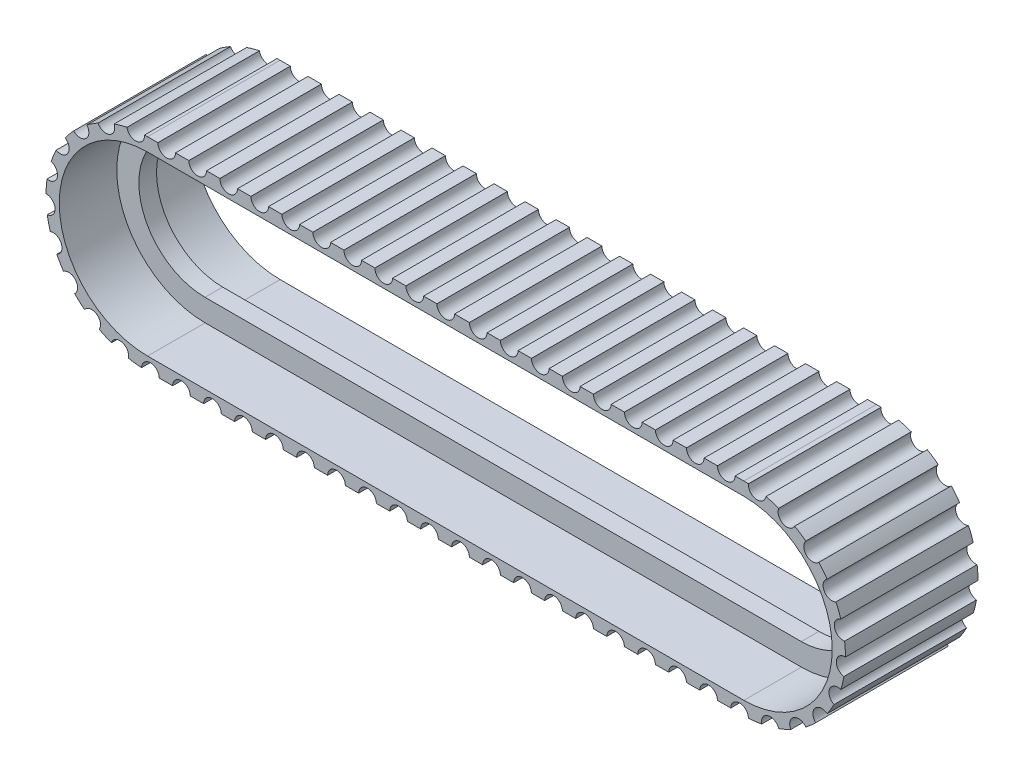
ISO-10303-21;
HEADER;
FILE_DESCRIPTION(('STEP AP214'),'2;1');
FILE_NAME('part.step','',(''),(''),'','','');
FILE_SCHEMA(('AUTOMOTIVE_DESIGN { 1 0 10303 214 1 1 1 1 }'));
ENDSEC;
DATA;
#1=APPLICATION_CONTEXT('core data for automotive mechanical design processes');
#2=APPLICATION_PROTOCOL_DEFINITION('international standard','automotive_design',2000,#1);
#3=PRODUCT_CONTEXT('',#1,'mechanical');
#4=PRODUCT('Part','Part','',(#3));
#5=PRODUCT_RELATED_PRODUCT_CATEGORY('part','',(#4));
#6=PRODUCT_DEFINITION_FORMATION('','',#4);
#7=PRODUCT_DEFINITION_CONTEXT('part definition',#1,'design');
#8=PRODUCT_DEFINITION('design','',#6,#7);
#9=PRODUCT_DEFINITION_SHAPE('','',#8);
#10=(LENGTH_UNIT() NAMED_UNIT(*) SI_UNIT(.MILLI.,.METRE.));
#11=(NAMED_UNIT(*) PLANE_ANGLE_UNIT() SI_UNIT($,.RADIAN.));
#12=(NAMED_UNIT(*) SI_UNIT($,.STERADIAN.) SOLID_ANGLE_UNIT());
#13=UNCERTAINTY_MEASURE_WITH_UNIT(LENGTH_MEASURE(1.E-05),#10,'distance_accuracy_value','');
#14=(GEOMETRIC_REPRESENTATION_CONTEXT(3) GLOBAL_UNCERTAINTY_ASSIGNED_CONTEXT((#13)) GLOBAL_UNIT_ASSIGNED_CONTEXT((#10,
#11,#12)) REPRESENTATION_CONTEXT('',''));
#15=CARTESIAN_POINT('',(0.,0.,0.));
#16=DIRECTION('',(0.,0.,1.));
#17=DIRECTION('',(1.,0.,0.));
#18=AXIS2_PLACEMENT_3D('',#15,#16,#17);
#19=CARTESIAN_POINT('',(0.,0.,15.));
#20=DIRECTION('',(0.,0.,1.));
#21=DIRECTION('',(1.,0.,0.));
#22=AXIS2_PLACEMENT_3D('',#19,#20,#21);
#23=CYLINDRICAL_SURFACE('',#22,14.9772274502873);
#24=DIRECTION('',(0.,0.,1.));
#25=VECTOR('',#24,1.);
#26=CARTESIAN_POINT('',(0.,14.9772274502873,12.9999999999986));
#27=LINE('',#26,#25);
#28=CARTESIAN_POINT('',(0.,14.9772274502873,12.9999999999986));
#29=VERTEX_POINT('',#28);
#30=CARTESIAN_POINT('',(0.,14.9772274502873,16.9999999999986));
#31=VERTEX_POINT('',#30);
#32=EDGE_CURVE('E211',#29,#31,#27,.T.);
#33=ORIENTED_EDGE('',*,*,#32,.T.);
#34=CARTESIAN_POINT('',(0.,0.,16.9999999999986));
#35=DIRECTION('',(0.,0.,1.));
#36=DIRECTION('',(1.,0.,0.));
#37=AXIS2_PLACEMENT_3D('',#34,#35,#36);
#38=CIRCLE('',#37,14.9772274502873);
#39=CARTESIAN_POINT('',(0.,-14.9772274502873,16.9999999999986));
#40=VERTEX_POINT('',#39);
#41=EDGE_CURVE('E82',#31,#40,#38,.T.);
#42=ORIENTED_EDGE('',*,*,#41,.T.);
#43=DIRECTION('',(0.,0.,1.));
#44=VECTOR('',#43,1.);
#45=CARTESIAN_POINT('',(0.,-14.9772274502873,12.9999999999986));
#46=LINE('',#45,#44);
#47=CARTESIAN_POINT('',(0.,-14.9772274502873,12.9999999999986));
#48=VERTEX_POINT('',#47);
#49=EDGE_CURVE('E192',#48,#40,#46,.T.);
#50=ORIENTED_EDGE('',*,*,#49,.F.);
#51=CARTESIAN_POINT('',(0.,0.,12.9999999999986));
#52=DIRECTION('',(0.,0.,1.));
#53=DIRECTION('',(1.,0.,0.));
#54=AXIS2_PLACEMENT_3D('',#51,#52,#53);
#55=CIRCLE('',#54,14.9772274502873);
#56=EDGE_CURVE('E14',#29,#48,#55,.T.);
#57=ORIENTED_EDGE('',*,*,#56,.F.);
#58=EDGE_LOOP('',(#33,#42,#50,#57));
#59=FACE_BOUND('',#58,.T.);
#60=ADVANCED_FACE('F74',(#59),#23,.F.);
#61=CARTESIAN_POINT('',(0.,0.,15.));
#62=DIRECTION('',(0.,0.,1.));
#63=DIRECTION('',(1.,0.,0.));
#64=AXIS2_PLACEMENT_3D('',#61,#62,#63);
#65=CYLINDRICAL_SURFACE('',#64,19.9772274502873);
#66=DIRECTION('',(0.,0.,-1.));
#67=VECTOR('',#66,1.);
#68=CARTESIAN_POINT('',(0.,19.9772274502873,16.9999999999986));
#69=LINE('',#68,#67);
#70=CARTESIAN_POINT('',(0.,19.9772274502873,16.9999999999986));
#71=VERTEX_POINT('',#70);
#72=CARTESIAN_POINT('',(0.,19.9772274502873,12.9999999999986));
#73=VERTEX_POINT('',#72);
#74=EDGE_CURVE('E150',#71,#73,#69,.T.);
#75=ORIENTED_EDGE('',*,*,#74,.T.);
#76=CARTESIAN_POINT('',(0.,0.,12.9999999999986));
#77=DIRECTION('',(0.,0.,1.));
#78=DIRECTION('',(1.,0.,0.));
#79=AXIS2_PLACEMENT_3D('',#76,#77,#78);
#80=CIRCLE('',#79,19.9772274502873);
#81=CARTESIAN_POINT('',(0.,-19.9772274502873,12.9999999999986));
#82=VERTEX_POINT('',#81);
#83=EDGE_CURVE('E191',#73,#82,#80,.T.);
#84=ORIENTED_EDGE('',*,*,#83,.T.);
#85=DIRECTION('',(0.,0.,-1.));
#86=VECTOR('',#85,1.);
#87=CARTESIAN_POINT('',(0.,-19.9772274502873,16.9999999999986));
#88=LINE('',#87,#86);
#89=CARTESIAN_POINT('',(0.,-19.9772274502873,16.9999999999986));
#90=VERTEX_POINT('',#89);
#91=EDGE_CURVE('E180',#90,#82,#88,.T.);
#92=ORIENTED_EDGE('',*,*,#91,.F.);
#93=CARTESIAN_POINT('',(0.,0.,16.9999999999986));
#94=DIRECTION('',(0.,0.,1.));
#95=DIRECTION('',(1.,0.,0.));
#96=AXIS2_PLACEMENT_3D('',#93,#94,#95);
#97=CIRCLE('',#96,19.9772274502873);
#98=EDGE_CURVE('E189',#71,#90,#97,.T.);
#99=ORIENTED_EDGE('',*,*,#98,.F.);
#100=EDGE_LOOP('',(#75,#84,#92,#99));
#101=FACE_BOUND('',#100,.T.);
#102=ADVANCED_FACE('F188',(#101),#65,.T.);
#103=CARTESIAN_POINT('',(135.,14.9772274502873,12.9999999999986));
#104=DIRECTION('',(0.,-1.,0.));
#105=DIRECTION('',(1.,0.,0.));
#106=AXIS2_PLACEMENT_3D('',#103,#104,#105);
#107=PLANE('',#106);
#108=DIRECTION('',(0.,0.,1.));
#109=VECTOR('',#108,1.);
#110=CARTESIAN_POINT('',(135.,14.9772274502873,12.9999999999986));
#111=LINE('',#110,#109);
#112=CARTESIAN_POINT('',(135.,14.9772274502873,12.9999999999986));
#113=VERTEX_POINT('',#112);
#114=CARTESIAN_POINT('',(135.,14.9772274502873,16.9999999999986));
#115=VERTEX_POINT('',#114);
#116=EDGE_CURVE('E147',#113,#115,#111,.T.);
#117=ORIENTED_EDGE('',*,*,#116,.T.);
#118=DIRECTION('',(-1.,0.,0.));
#119=VECTOR('',#118,1.);
#120=CARTESIAN_POINT('',(135.,14.9772274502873,16.9999999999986));
#121=LINE('',#120,#119);
#122=EDGE_CURVE('E204',#115,#31,#121,.T.);
#123=ORIENTED_EDGE('',*,*,#122,.T.);
#124=ORIENTED_EDGE('',*,*,#32,.F.);
#125=DIRECTION('',(-1.,0.,0.));
#126=VECTOR('',#125,1.);
#127=CARTESIAN_POINT('',(135.,14.9772274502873,12.9999999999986));
#128=LINE('',#127,#126);
#129=EDGE_CURVE('E193',#113,#29,#128,.T.);
#130=ORIENTED_EDGE('',*,*,#129,.F.);
#131=EDGE_LOOP('',(#117,#123,#124,#130));
#132=FACE_BOUND('',#131,.T.);
#133=ADVANCED_FACE('F228',(#132),#107,.T.);
#134=CARTESIAN_POINT('',(135.,19.9772274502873,16.9999999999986));
#135=DIRECTION('',(0.,1.,0.));
#136=DIRECTION('',(-1.,0.,0.));
#137=AXIS2_PLACEMENT_3D('',#134,#135,#136);
#138=PLANE('',#137);
#139=DIRECTION('',(0.,0.,-1.));
#140=VECTOR('',#139,1.);
#141=CARTESIAN_POINT('',(135.,19.9772274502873,16.9999999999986));
#142=LINE('',#141,#140);
#143=CARTESIAN_POINT('',(135.,19.9772274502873,16.9999999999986));
#144=VERTEX_POINT('',#143);
#145=CARTESIAN_POINT('',(135.,19.9772274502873,12.9999999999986));
#146=VERTEX_POINT('',#145);
#147=EDGE_CURVE('E158',#144,#146,#142,.T.);
#148=ORIENTED_EDGE('',*,*,#147,.T.);
#149=DIRECTION('',(-1.,0.,0.));
#150=VECTOR('',#149,1.);
#151=CARTESIAN_POINT('',(135.,19.9772274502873,12.9999999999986));
#152=LINE('',#151,#150);
#153=EDGE_CURVE('E208',#146,#73,#152,.T.);
#154=ORIENTED_EDGE('',*,*,#153,.T.);
#155=ORIENTED_EDGE('',*,*,#74,.F.);
#156=DIRECTION('',(-1.,0.,0.));
#157=VECTOR('',#156,1.);
#158=CARTESIAN_POINT('',(135.,19.9772274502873,16.9999999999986));
#159=LINE('',#158,#157);
#160=EDGE_CURVE('E197',#144,#71,#159,.T.);
#161=ORIENTED_EDGE('',*,*,#160,.F.);
#162=EDGE_LOOP('',(#148,#154,#155,#161));
#163=FACE_BOUND('',#162,.T.);
#164=ADVANCED_FACE('F226',(#163),#138,.T.);
#165=CARTESIAN_POINT('',(135.,0.,15.));
#166=DIRECTION('',(0.,0.,1.));
#167=DIRECTION('',(1.,0.,0.));
#168=AXIS2_PLACEMENT_3D('',#165,#166,#167);
#169=CYLINDRICAL_SURFACE('',#168,14.9772274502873);
#170=DIRECTION('',(0.,0.,1.));
#171=VECTOR('',#170,1.);
#172=CARTESIAN_POINT('',(135.,-14.9772274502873,12.9999999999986));
#173=LINE('',#172,#171);
#174=CARTESIAN_POINT('',(135.,-14.9772274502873,12.9999999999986));
#175=VERTEX_POINT('',#174);
#176=CARTESIAN_POINT('',(135.,-14.9772274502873,16.9999999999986));
#177=VERTEX_POINT('',#176);
#178=EDGE_CURVE('E145',#175,#177,#173,.T.);
#179=ORIENTED_EDGE('',*,*,#178,.T.);
#180=CARTESIAN_POINT('',(135.,0.,16.9999999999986));
#181=DIRECTION('',(0.,0.,1.));
#182=DIRECTION('',(1.,0.,0.));
#183=AXIS2_PLACEMENT_3D('',#180,#181,#182);
#184=CIRCLE('',#183,14.9772274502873);
#185=EDGE_CURVE('E151',#177,#115,#184,.T.);
#186=ORIENTED_EDGE('',*,*,#185,.T.);
#187=ORIENTED_EDGE('',*,*,#116,.F.);
#188=CARTESIAN_POINT('',(135.,0.,12.9999999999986));
#189=DIRECTION('',(0.,0.,1.));
#190=DIRECTION('',(1.,0.,0.));
#191=AXIS2_PLACEMENT_3D('',#188,#189,#190);
#192=CIRCLE('',#191,14.9772274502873);
#193=EDGE_CURVE('E142',#175,#113,#192,.T.);
#194=ORIENTED_EDGE('',*,*,#193,.F.);
#195=EDGE_LOOP('',(#179,#186,#187,#194));
#196=FACE_BOUND('',#195,.T.);
#197=ADVANCED_FACE('F143',(#196),#169,.F.);
#198=CARTESIAN_POINT('',(135.,0.,15.));
#199=DIRECTION('',(0.,0.,1.));
#200=DIRECTION('',(1.,0.,0.));
#201=AXIS2_PLACEMENT_3D('',#198,#199,#200);
#202=CYLINDRICAL_SURFACE('',#201,19.9772274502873);
#203=DIRECTION('',(0.,0.,-1.));
#204=VECTOR('',#203,1.);
#205=CARTESIAN_POINT('',(135.,-19.9772274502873,16.9999999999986));
#206=LINE('',#205,#204);
#207=CARTESIAN_POINT('',(135.,-19.9772274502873,16.9999999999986));
#208=VERTEX_POINT('',#207);
#209=CARTESIAN_POINT('',(135.,-19.9772274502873,12.9999999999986));
#210=VERTEX_POINT('',#209);
#211=EDGE_CURVE('E154',#208,#210,#206,.T.);
#212=ORIENTED_EDGE('',*,*,#211,.T.);
#213=CARTESIAN_POINT('',(135.,0.,12.9999999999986));
#214=DIRECTION('',(0.,0.,1.));
#215=DIRECTION('',(1.,0.,0.));
#216=AXIS2_PLACEMENT_3D('',#213,#214,#215);
#217=CIRCLE('',#216,19.9772274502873);
#218=EDGE_CURVE('E218',#210,#146,#217,.T.);
#219=ORIENTED_EDGE('',*,*,#218,.T.);
#220=ORIENTED_EDGE('',*,*,#147,.F.);
#221=CARTESIAN_POINT('',(135.,0.,16.9999999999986));
#222=DIRECTION('',(0.,0.,1.));
#223=DIRECTION('',(1.,0.,0.));
#224=AXIS2_PLACEMENT_3D('',#221,#222,#223);
#225=CIRCLE('',#224,19.9772274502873);
#226=EDGE_CURVE('E216',#208,#144,#225,.T.);
#227=ORIENTED_EDGE('',*,*,#226,.F.);
#228=EDGE_LOOP('',(#212,#219,#220,#227));
#229=FACE_BOUND('',#228,.T.);
#230=ADVANCED_FACE('F223',(#229),#202,.T.);
#231=CARTESIAN_POINT('',(135.,-19.9772274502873,12.9999999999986));
#232=DIRECTION('',(0.,0.,1.));
#233=DIRECTION('',(1.,0.,0.));
#234=AXIS2_PLACEMENT_3D('',#231,#232,#233);
#235=PLANE('',#234);
#236=DIRECTION('',(-1.,0.,0.));
#237=VECTOR('',#236,1.);
#238=CARTESIAN_POINT('',(135.,-14.9772274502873,12.9999999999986));
#239=LINE('',#238,#237);
#240=EDGE_CURVE('E90',#175,#48,#239,.T.);
#241=ORIENTED_EDGE('',*,*,#240,.F.);
#242=ORIENTED_EDGE('',*,*,#193,.T.);
#243=ORIENTED_EDGE('',*,*,#129,.T.);
#244=ORIENTED_EDGE('',*,*,#56,.T.);
#245=EDGE_LOOP('',(#241,#242,#243,#244));
#246=FACE_BOUND('',#245,.T.);
#247=DIRECTION('',(-1.,0.,0.));
#248=VECTOR('',#247,1.);
#249=CARTESIAN_POINT('',(135.,-19.9772274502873,12.9999999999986));
#250=LINE('',#249,#248);
#251=EDGE_CURVE('E168',#210,#82,#250,.T.);
#252=ORIENTED_EDGE('',*,*,#251,.T.);
#253=ORIENTED_EDGE('',*,*,#83,.F.);
#254=ORIENTED_EDGE('',*,*,#153,.F.);
#255=ORIENTED_EDGE('',*,*,#218,.F.);
#256=EDGE_LOOP('',(#252,#253,#254,#255));
#257=FACE_BOUND('',#256,.T.);
#258=ADVANCED_FACE('F156',(#246,#257),#235,.F.);
#259=CARTESIAN_POINT('',(135.,-14.9772274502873,12.9999999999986));
#260=DIRECTION('',(0.,-1.,0.));
#261=DIRECTION('',(1.,0.,0.));
#262=AXIS2_PLACEMENT_3D('',#259,#260,#261);
#263=PLANE('',#262);
#264=ORIENTED_EDGE('',*,*,#240,.T.);
#265=ORIENTED_EDGE('',*,*,#49,.T.);
#266=DIRECTION('',(-1.,0.,0.));
#267=VECTOR('',#266,1.);
#268=CARTESIAN_POINT('',(135.,-14.9772274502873,16.9999999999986));
#269=LINE('',#268,#267);
#270=EDGE_CURVE('E98',#177,#40,#269,.T.);
#271=ORIENTED_EDGE('',*,*,#270,.F.);
#272=ORIENTED_EDGE('',*,*,#178,.F.);
#273=EDGE_LOOP('',(#264,#265,#271,#272));
#274=FACE_BOUND('',#273,.T.);
#275=ADVANCED_FACE('F153',(#274),#263,.F.);
#276=CARTESIAN_POINT('',(135.,-14.9772274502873,16.9999999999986));
#277=DIRECTION('',(0.,0.,-1.));
#278=DIRECTION('',(-1.,0.,0.));
#279=AXIS2_PLACEMENT_3D('',#276,#277,#278);
#280=PLANE('',#279);
#281=DIRECTION('',(-1.,0.,0.));
#282=VECTOR('',#281,1.);
#283=CARTESIAN_POINT('',(135.,-19.9772274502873,16.9999999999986));
#284=LINE('',#283,#282);
#285=EDGE_CURVE('E162',#208,#90,#284,.T.);
#286=ORIENTED_EDGE('',*,*,#285,.F.);
#287=ORIENTED_EDGE('',*,*,#226,.T.);
#288=ORIENTED_EDGE('',*,*,#160,.T.);
#289=ORIENTED_EDGE('',*,*,#98,.T.);
#290=EDGE_LOOP('',(#286,#287,#288,#289));
#291=FACE_BOUND('',#290,.T.);
#292=ORIENTED_EDGE('',*,*,#270,.T.);
#293=ORIENTED_EDGE('',*,*,#41,.F.);
#294=ORIENTED_EDGE('',*,*,#122,.F.);
#295=ORIENTED_EDGE('',*,*,#185,.F.);
#296=EDGE_LOOP('',(#292,#293,#294,#295));
#297=FACE_BOUND('',#296,.T.);
#298=ADVANCED_FACE('F196',(#291,#297),#280,.F.);
#299=CARTESIAN_POINT('',(135.,-19.9772274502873,16.9999999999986));
#300=DIRECTION('',(0.,1.,0.));
#301=DIRECTION('',(-1.,0.,0.));
#302=AXIS2_PLACEMENT_3D('',#299,#300,#301);
#303=PLANE('',#302);
#304=ORIENTED_EDGE('',*,*,#285,.T.);
#305=ORIENTED_EDGE('',*,*,#91,.T.);
#306=ORIENTED_EDGE('',*,*,#251,.F.);
#307=ORIENTED_EDGE('',*,*,#211,.F.);
#308=EDGE_LOOP('',(#304,#305,#306,#307));
#309=FACE_BOUND('',#308,.T.);
#310=ADVANCED_FACE('F178',(#309),#303,.F.);
#311=CLOSED_SHELL('',(#60,#102,#133,#164,#197,#230,#258,#275,#298,#310));
#312=MANIFOLD_SOLID_BREP('B2',#311);
#313=CARTESIAN_POINT('',(135.,23.,30.));
#314=DIRECTION('',(0.,-1.,0.));
#315=DIRECTION('',(0.,0.,-1.));
#316=AXIS2_PLACEMENT_3D('',#313,#314,#315);
#317=PLANE('',#316);
#318=DIRECTION('',(-1.,0.,0.));
#319=VECTOR('',#318,1.);
#320=CARTESIAN_POINT('',(135.,23.,0.));
#321=LINE('',#320,#319);
#322=CARTESIAN_POINT('',(79.8732620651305,23.,0.));
#323=VERTEX_POINT('',#322);
#324=CARTESIAN_POINT('',(76.8532620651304,23.,0.));
#325=VERTEX_POINT('',#324);
#326=EDGE_CURVE('E1120',#323,#325,#321,.T.);
#327=ORIENTED_EDGE('',*,*,#326,.T.);
#328=DIRECTION('',(0.,0.,1.));
#329=VECTOR('',#328,1.);
#330=CARTESIAN_POINT('',(76.8532620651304,23.,0.));
#331=LINE('',#330,#329);
#332=CARTESIAN_POINT('',(76.8532620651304,23.,30.0000000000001));
#333=VERTEX_POINT('',#332);
#334=EDGE_CURVE('E356',#325,#333,#331,.T.);
#335=ORIENTED_EDGE('',*,*,#334,.T.);
#336=DIRECTION('',(-1.,0.,0.));
#337=VECTOR('',#336,1.);
#338=CARTESIAN_POINT('',(135.,23.,30.));
#339=LINE('',#338,#337);
#340=CARTESIAN_POINT('',(79.8732620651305,23.,30.0000000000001));
#341=VERTEX_POINT('',#340);
#342=EDGE_CURVE('E2705',#341,#333,#339,.T.);
#343=ORIENTED_EDGE('',*,*,#342,.F.);
#344=DIRECTION('',(0.,0.,1.));
#345=VECTOR('',#344,1.);
#346=CARTESIAN_POINT('',(79.8732620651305,23.,0.));
#347=LINE('',#346,#345);
#348=EDGE_CURVE('E3408',#341,#323,#347,.F.);
#349=ORIENTED_EDGE('',*,*,#348,.T.);
#350=EDGE_LOOP('',(#327,#335,#343,#349));
#351=FACE_BOUND('',#350,.T.);
#352=ADVANCED_FACE('F341',(#351),#317,.F.);
#353=CARTESIAN_POINT('',(86.8932620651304,23.,0.));
#354=VERTEX_POINT('',#353);
#355=CARTESIAN_POINT('',(83.8732620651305,23.,0.));
#356=VERTEX_POINT('',#355);
#357=EDGE_CURVE('E1124',#354,#356,#321,.T.);
#358=ORIENTED_EDGE('',*,*,#357,.T.);
#359=DIRECTION('',(0.,0.,1.));
#360=VECTOR('',#359,1.);
#361=CARTESIAN_POINT('',(83.8732620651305,23.,0.));
#362=LINE('',#361,#360);
#363=CARTESIAN_POINT('',(83.8732620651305,23.,30.0000000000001));
#364=VERTEX_POINT('',#363);
#365=EDGE_CURVE('E363',#356,#364,#362,.T.);
#366=ORIENTED_EDGE('',*,*,#365,.T.);
#367=CARTESIAN_POINT('',(86.8932620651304,23.,30.0000000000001));
#368=VERTEX_POINT('',#367);
#369=EDGE_CURVE('E2704',#368,#364,#339,.T.);
#370=ORIENTED_EDGE('',*,*,#369,.F.);
#371=DIRECTION('',(0.,0.,1.));
#372=VECTOR('',#371,1.);
#373=CARTESIAN_POINT('',(86.8932620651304,23.,0.));
#374=LINE('',#373,#372);
#375=EDGE_CURVE('E1481',#368,#354,#374,.F.);
#376=ORIENTED_EDGE('',*,*,#375,.T.);
#377=EDGE_LOOP('',(#358,#366,#370,#376));
#378=FACE_BOUND('',#377,.T.);
#379=ADVANCED_FACE('F1478',(#378),#317,.F.);
#380=CARTESIAN_POINT('',(93.9132620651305,23.,0.));
#381=VERTEX_POINT('',#380);
#382=CARTESIAN_POINT('',(90.8932620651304,23.,0.));
#383=VERTEX_POINT('',#382);
#384=EDGE_CURVE('E1482',#381,#383,#321,.T.);
#385=ORIENTED_EDGE('',*,*,#384,.T.);
#386=DIRECTION('',(0.,0.,1.));
#387=VECTOR('',#386,1.);
#388=CARTESIAN_POINT('',(90.8932620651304,23.,0.));
#389=LINE('',#388,#387);
#390=CARTESIAN_POINT('',(90.8932620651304,23.,30.0000000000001));
#391=VERTEX_POINT('',#390);
#392=EDGE_CURVE('E2682',#383,#391,#389,.T.);
#393=ORIENTED_EDGE('',*,*,#392,.T.);
#394=CARTESIAN_POINT('',(93.9132620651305,23.,30.0000000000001));
#395=VERTEX_POINT('',#394);
#396=EDGE_CURVE('E2688',#395,#391,#339,.T.);
#397=ORIENTED_EDGE('',*,*,#396,.F.);
#398=DIRECTION('',(0.,0.,1.));
#399=VECTOR('',#398,1.);
#400=CARTESIAN_POINT('',(93.9132620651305,23.,0.));
#401=LINE('',#400,#399);
#402=EDGE_CURVE('E2683',#395,#381,#401,.F.);
#403=ORIENTED_EDGE('',*,*,#402,.T.);
#404=EDGE_LOOP('',(#385,#393,#397,#403));
#405=FACE_BOUND('',#404,.T.);
#406=ADVANCED_FACE('F1853',(#405),#317,.F.);
#407=CARTESIAN_POINT('',(100.93326206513,23.,0.));
#408=VERTEX_POINT('',#407);
#409=CARTESIAN_POINT('',(97.9132620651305,23.,0.));
#410=VERTEX_POINT('',#409);
#411=EDGE_CURVE('E1484',#408,#410,#321,.T.);
#412=ORIENTED_EDGE('',*,*,#411,.T.);
#413=DIRECTION('',(0.,0.,1.));
#414=VECTOR('',#413,1.);
#415=CARTESIAN_POINT('',(97.9132620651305,23.,0.));
#416=LINE('',#415,#414);
#417=CARTESIAN_POINT('',(97.9132620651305,23.,30.0000000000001));
#418=VERTEX_POINT('',#417);
#419=EDGE_CURVE('E2685',#410,#418,#416,.T.);
#420=ORIENTED_EDGE('',*,*,#419,.T.);
#421=CARTESIAN_POINT('',(100.93326206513,23.,30.0000000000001));
#422=VERTEX_POINT('',#421);
#423=EDGE_CURVE('E2702',#422,#418,#339,.T.);
#424=ORIENTED_EDGE('',*,*,#423,.F.);
#425=DIRECTION('',(0.,0.,1.));
#426=VECTOR('',#425,1.);
#427=CARTESIAN_POINT('',(100.93326206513,23.,0.));
#428=LINE('',#427,#426);
#429=EDGE_CURVE('E2697',#422,#408,#428,.F.);
#430=ORIENTED_EDGE('',*,*,#429,.T.);
#431=EDGE_LOOP('',(#412,#420,#424,#430));
#432=FACE_BOUND('',#431,.T.);
#433=ADVANCED_FACE('F3280',(#432),#317,.F.);
#434=CARTESIAN_POINT('',(107.95326206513,23.,0.));
#435=VERTEX_POINT('',#434);
#436=CARTESIAN_POINT('',(104.93326206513,23.,0.));
#437=VERTEX_POINT('',#436);
#438=EDGE_CURVE('E1490',#435,#437,#321,.T.);
#439=ORIENTED_EDGE('',*,*,#438,.T.);
#440=DIRECTION('',(0.,0.,1.));
#441=VECTOR('',#440,1.);
#442=CARTESIAN_POINT('',(104.93326206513,23.,0.));
#443=LINE('',#442,#441);
#444=CARTESIAN_POINT('',(104.93326206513,23.,30.0000000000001));
#445=VERTEX_POINT('',#444);
#446=EDGE_CURVE('E1523',#437,#445,#443,.T.);
#447=ORIENTED_EDGE('',*,*,#446,.T.);
#448=CARTESIAN_POINT('',(107.95326206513,23.,30.0000000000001));
#449=VERTEX_POINT('',#448);
#450=EDGE_CURVE('E1518',#449,#445,#339,.T.);
#451=ORIENTED_EDGE('',*,*,#450,.F.);
#452=DIRECTION('',(0.,0.,1.));
#453=VECTOR('',#452,1.);
#454=CARTESIAN_POINT('',(107.95326206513,23.,0.));
#455=LINE('',#454,#453);
#456=EDGE_CURVE('E1513',#449,#435,#455,.F.);
#457=ORIENTED_EDGE('',*,*,#456,.T.);
#458=EDGE_LOOP('',(#439,#447,#451,#457));
#459=FACE_BOUND('',#458,.T.);
#460=ADVANCED_FACE('F1516',(#459),#317,.F.);
#461=CARTESIAN_POINT('',(114.97326206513,23.,0.));
#462=VERTEX_POINT('',#461);
#463=CARTESIAN_POINT('',(111.95326206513,23.,0.));
#464=VERTEX_POINT('',#463);
#465=EDGE_CURVE('E1147',#462,#464,#321,.T.);
#466=ORIENTED_EDGE('',*,*,#465,.T.);
#467=DIRECTION('',(0.,0.,1.));
#468=VECTOR('',#467,1.);
#469=CARTESIAN_POINT('',(111.95326206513,23.,0.));
#470=LINE('',#469,#468);
#471=CARTESIAN_POINT('',(111.95326206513,23.,30.0000000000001));
#472=VERTEX_POINT('',#471);
#473=EDGE_CURVE('E1507',#464,#472,#470,.T.);
#474=ORIENTED_EDGE('',*,*,#473,.T.);
#475=CARTESIAN_POINT('',(114.97326206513,23.,30.0000000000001));
#476=VERTEX_POINT('',#475);
#477=EDGE_CURVE('E2701',#476,#472,#339,.T.);
#478=ORIENTED_EDGE('',*,*,#477,.F.);
#479=DIRECTION('',(0.,0.,1.));
#480=VECTOR('',#479,1.);
#481=CARTESIAN_POINT('',(114.97326206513,23.,0.));
#482=LINE('',#481,#480);
#483=EDGE_CURVE('E1509',#476,#462,#482,.F.);
#484=ORIENTED_EDGE('',*,*,#483,.T.);
#485=EDGE_LOOP('',(#466,#474,#478,#484));
#486=FACE_BOUND('',#485,.T.);
#487=ADVANCED_FACE('F1505',(#486),#317,.F.);
#488=CARTESIAN_POINT('',(121.99326206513,23.,0.));
#489=VERTEX_POINT('',#488);
#490=CARTESIAN_POINT('',(118.97326206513,23.,0.));
#491=VERTEX_POINT('',#490);
#492=EDGE_CURVE('E1140',#489,#491,#321,.T.);
#493=ORIENTED_EDGE('',*,*,#492,.T.);
#494=DIRECTION('',(0.,0.,1.));
#495=VECTOR('',#494,1.);
#496=CARTESIAN_POINT('',(118.97326206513,23.,0.));
#497=LINE('',#496,#495);
#498=CARTESIAN_POINT('',(118.97326206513,23.,30.0000000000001));
#499=VERTEX_POINT('',#498);
#500=EDGE_CURVE('E1529',#491,#499,#497,.T.);
#501=ORIENTED_EDGE('',*,*,#500,.T.);
#502=CARTESIAN_POINT('',(121.99326206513,23.,30.0000000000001));
#503=VERTEX_POINT('',#502);
#504=EDGE_CURVE('E2703',#503,#499,#339,.T.);
#505=ORIENTED_EDGE('',*,*,#504,.F.);
#506=DIRECTION('',(0.,0.,1.));
#507=VECTOR('',#506,1.);
#508=CARTESIAN_POINT('',(121.99326206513,23.,0.));
#509=LINE('',#508,#507);
#510=EDGE_CURVE('E1534',#503,#489,#509,.F.);
#511=ORIENTED_EDGE('',*,*,#510,.T.);
#512=EDGE_LOOP('',(#493,#501,#505,#511));
#513=FACE_BOUND('',#512,.T.);
#514=ADVANCED_FACE('F2747',(#513),#317,.F.);
#515=CARTESIAN_POINT('',(129.01326206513,23.,0.));
#516=VERTEX_POINT('',#515);
#517=CARTESIAN_POINT('',(125.99326206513,23.,0.));
#518=VERTEX_POINT('',#517);
#519=EDGE_CURVE('E1131',#516,#518,#321,.T.);
#520=ORIENTED_EDGE('',*,*,#519,.T.);
#521=DIRECTION('',(0.,0.,1.));
#522=VECTOR('',#521,1.);
#523=CARTESIAN_POINT('',(125.99326206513,23.,0.));
#524=LINE('',#523,#522);
#525=CARTESIAN_POINT('',(125.99326206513,23.,30.0000000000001));
#526=VERTEX_POINT('',#525);
#527=EDGE_CURVE('E1537',#518,#526,#524,.T.);
#528=ORIENTED_EDGE('',*,*,#527,.T.);
#529=CARTESIAN_POINT('',(129.01326206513,23.,30.0000000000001));
#530=VERTEX_POINT('',#529);
#531=EDGE_CURVE('E1195',#530,#526,#339,.T.);
#532=ORIENTED_EDGE('',*,*,#531,.F.);
#533=DIRECTION('',(0.,0.,1.));
#534=VECTOR('',#533,1.);
#535=CARTESIAN_POINT('',(129.01326206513,23.,0.));
#536=LINE('',#535,#534);
#537=EDGE_CURVE('E1541',#530,#516,#536,.F.);
#538=ORIENTED_EDGE('',*,*,#537,.T.);
#539=EDGE_LOOP('',(#520,#528,#532,#538));
#540=FACE_BOUND('',#539,.T.);
#541=ADVANCED_FACE('F2748',(#540),#317,.F.);
#542=CARTESIAN_POINT('',(135.,23.,0.));
#543=VERTEX_POINT('',#542);
#544=CARTESIAN_POINT('',(133.01326206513,23.,0.));
#545=VERTEX_POINT('',#544);
#546=EDGE_CURVE('E1123',#543,#545,#321,.T.);
#547=ORIENTED_EDGE('',*,*,#546,.T.);
#548=DIRECTION('',(0.,0.,1.));
#549=VECTOR('',#548,1.);
#550=CARTESIAN_POINT('',(133.01326206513,23.,0.));
#551=LINE('',#550,#549);
#552=CARTESIAN_POINT('',(133.01326206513,23.,30.0000000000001));
#553=VERTEX_POINT('',#552);
#554=EDGE_CURVE('E1543',#545,#553,#551,.T.);
#555=ORIENTED_EDGE('',*,*,#554,.T.);
#556=CARTESIAN_POINT('',(135.,23.,30.));
#557=VERTEX_POINT('',#556);
#558=EDGE_CURVE('E1191',#557,#553,#339,.T.);
#559=ORIENTED_EDGE('',*,*,#558,.F.);
#560=DIRECTION('',(0.,0.,-1.));
#561=VECTOR('',#560,1.);
#562=CARTESIAN_POINT('',(135.,23.,30.));
#563=LINE('',#562,#561);
#564=EDGE_CURVE('E1209',#557,#543,#563,.T.);
#565=ORIENTED_EDGE('',*,*,#564,.T.);
#566=EDGE_LOOP('',(#547,#555,#559,#565));
#567=FACE_BOUND('',#566,.T.);
#568=ADVANCED_FACE('F2752',(#567),#317,.F.);
#569=CARTESIAN_POINT('',(135.,0.,30.));
#570=DIRECTION('',(0.,0.,-1.));
#571=DIRECTION('',(-1.,0.,0.));
#572=AXIS2_PLACEMENT_3D('',#569,#570,#571);
#573=CYLINDRICAL_SURFACE('',#572,23.);
#574=CARTESIAN_POINT('',(135.,0.,0.));
#575=DIRECTION('',(0.,0.,1.));
#576=DIRECTION('',(1.,0.,0.));
#577=AXIS2_PLACEMENT_3D('',#574,#575,#576);
#578=CIRCLE('',#577,23.);
#579=CARTESIAN_POINT('',(142.889121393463,21.6046699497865,0.));
#580=VERTEX_POINT('',#579);
#581=CARTESIAN_POINT('',(139.993800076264,22.451324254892,-5.72473516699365E-13));
#582=VERTEX_POINT('',#581);
#583=EDGE_CURVE('E1167',#580,#582,#578,.T.);
#584=ORIENTED_EDGE('',*,*,#583,.T.);
#585=DIRECTION('',(0.,0.,1.));
#586=VECTOR('',#585,1.);
#587=CARTESIAN_POINT('',(139.993800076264,22.451324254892,14.9999999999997));
#588=LINE('',#587,#586);
#589=CARTESIAN_POINT('',(139.993800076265,22.451324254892,30.0000000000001));
#590=VERTEX_POINT('',#589);
#591=EDGE_CURVE('E1450',#582,#590,#588,.T.);
#592=ORIENTED_EDGE('',*,*,#591,.T.);
#593=CARTESIAN_POINT('',(135.,0.,30.));
#594=DIRECTION('',(0.,0.,1.));
#595=DIRECTION('',(1.,0.,0.));
#596=AXIS2_PLACEMENT_3D('',#593,#594,#595);
#597=CIRCLE('',#596,23.);
#598=CARTESIAN_POINT('',(142.889121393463,21.6046699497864,30.0000000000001));
#599=VERTEX_POINT('',#598);
#600=EDGE_CURVE('E2033',#599,#590,#597,.T.);
#601=ORIENTED_EDGE('',*,*,#600,.F.);
#602=DIRECTION('',(0.,0.,1.));
#603=VECTOR('',#602,1.);
#604=CARTESIAN_POINT('',(142.889121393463,21.6046699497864,14.9999999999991));
#605=LINE('',#604,#603);
#606=EDGE_CURVE('E1442',#599,#580,#605,.F.);
#607=ORIENTED_EDGE('',*,*,#606,.T.);
#608=EDGE_LOOP('',(#584,#592,#601,#607));
#609=FACE_BOUND('',#608,.T.);
#610=ADVANCED_FACE('F1863',(#609),#573,.T.);
#611=CARTESIAN_POINT('',(149.016713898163,18.2354525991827,0.));
#612=VERTEX_POINT('',#611);
#613=CARTESIAN_POINT('',(146.509629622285,19.9130215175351,-1.94416421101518E-12));
#614=VERTEX_POINT('',#613);
#615=EDGE_CURVE('E1174',#612,#614,#578,.T.);
#616=ORIENTED_EDGE('',*,*,#615,.T.);
#617=DIRECTION('',(0.,0.,1.));
#618=VECTOR('',#617,1.);
#619=CARTESIAN_POINT('',(146.509629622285,19.9130215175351,14.9999999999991));
#620=LINE('',#619,#618);
#621=CARTESIAN_POINT('',(146.509629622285,19.913021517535,30.0000000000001));
#622=VERTEX_POINT('',#621);
#623=EDGE_CURVE('E1445',#614,#622,#620,.T.);
#624=ORIENTED_EDGE('',*,*,#623,.T.);
#625=CARTESIAN_POINT('',(149.016713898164,18.2354525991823,30.0000000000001));
#626=VERTEX_POINT('',#625);
#627=EDGE_CURVE('E2762',#626,#622,#597,.T.);
#628=ORIENTED_EDGE('',*,*,#627,.F.);
#629=DIRECTION('',(0.,0.,1.));
#630=VECTOR('',#629,1.);
#631=CARTESIAN_POINT('',(149.016713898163,18.2354525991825,14.9999999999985));
#632=LINE('',#631,#630);
#633=EDGE_CURVE('E1436',#626,#612,#632,.F.);
#634=ORIENTED_EDGE('',*,*,#633,.T.);
#635=EDGE_LOOP('',(#616,#624,#628,#634));
#636=FACE_BOUND('',#635,.T.);
#637=ADVANCED_FACE('F2819',(#636),#573,.T.);
#638=CARTESIAN_POINT('',(153.848647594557,13.1806101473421,0.));
#639=VERTEX_POINT('',#638);
#640=CARTESIAN_POINT('',(151.961546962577,15.5340247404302,-3.25785900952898E-12));
#641=VERTEX_POINT('',#640);
#642=EDGE_CURVE('E2811',#639,#641,#578,.T.);
#643=ORIENTED_EDGE('',*,*,#642,.T.);
#644=DIRECTION('',(0.,0.,1.));
#645=VECTOR('',#644,1.);
#646=CARTESIAN_POINT('',(151.961546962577,15.53402474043,14.9999999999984));
#647=LINE('',#646,#645);
#648=CARTESIAN_POINT('',(151.961546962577,15.5340247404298,30.));
#649=VERTEX_POINT('',#648);
#650=EDGE_CURVE('E1439',#641,#649,#647,.T.);
#651=ORIENTED_EDGE('',*,*,#650,.T.);
#652=CARTESIAN_POINT('',(153.848647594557,13.1806101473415,30.0000000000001));
#653=VERTEX_POINT('',#652);
#654=EDGE_CURVE('E2765',#653,#649,#597,.T.);
#655=ORIENTED_EDGE('',*,*,#654,.F.);
#656=DIRECTION('',(0.,0.,1.));
#657=VECTOR('',#656,1.);
#658=CARTESIAN_POINT('',(153.848647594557,13.1806101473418,14.9999999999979));
#659=LINE('',#658,#657);
#660=EDGE_CURVE('E1430',#653,#639,#659,.F.);
#661=ORIENTED_EDGE('',*,*,#660,.T.);
#662=EDGE_LOOP('',(#643,#651,#655,#661));
#663=FACE_BOUND('',#662,.T.);
#664=ADVANCED_FACE('F2820',(#663),#573,.T.);
#665=CARTESIAN_POINT('',(156.93827446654,6.9073955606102,0.));
#666=VERTEX_POINT('',#665);
#667=CARTESIAN_POINT('',(155.845594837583,9.71911394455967,-4.40484919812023E-12));
#668=VERTEX_POINT('',#667);
#669=EDGE_CURVE('E2807',#666,#668,#578,.T.);
#670=ORIENTED_EDGE('',*,*,#669,.T.);
#671=DIRECTION('',(0.,0.,1.));
#672=VECTOR('',#671,1.);
#673=CARTESIAN_POINT('',(155.845594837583,9.71911394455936,14.9999999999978));
#674=LINE('',#673,#672);
#675=CARTESIAN_POINT('',(155.845594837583,9.71911394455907,30.));
#676=VERTEX_POINT('',#675);
#677=EDGE_CURVE('E1433',#668,#676,#674,.T.);
#678=ORIENTED_EDGE('',*,*,#677,.T.);
#679=CARTESIAN_POINT('',(156.938274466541,6.90739556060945,30.0000000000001));
#680=VERTEX_POINT('',#679);
#681=EDGE_CURVE('E2766',#680,#676,#597,.T.);
#682=ORIENTED_EDGE('',*,*,#681,.F.);
#683=DIRECTION('',(0.,0.,1.));
#684=VECTOR('',#683,1.);
#685=CARTESIAN_POINT('',(156.938274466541,6.90739556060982,14.9999999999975));
#686=LINE('',#685,#684);
#687=EDGE_CURVE('E1424',#680,#666,#686,.F.);
#688=ORIENTED_EDGE('',*,*,#687,.T.);
#689=EDGE_LOOP('',(#670,#678,#682,#688));
#690=FACE_BOUND('',#689,.T.);
#691=ADVANCED_FACE('F2821',(#690),#573,.T.);
#692=CARTESIAN_POINT('',(157.999999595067,-0.00431589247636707,0.));
#693=VERTEX_POINT('',#692);
#694=CARTESIAN_POINT('',(157.802744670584,3.00580030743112,-5.28020558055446E-12));
#695=VERTEX_POINT('',#694);
#696=EDGE_CURVE('E2803',#693,#695,#578,.T.);
#697=ORIENTED_EDGE('',*,*,#696,.T.);
#698=DIRECTION('',(0.,0.,1.));
#699=VECTOR('',#698,1.);
#700=CARTESIAN_POINT('',(157.802744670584,3.00580030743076,14.9999999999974));
#701=LINE('',#700,#699);
#702=CARTESIAN_POINT('',(157.802744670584,3.0058003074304,30.));
#703=VERTEX_POINT('',#702);
#704=EDGE_CURVE('E1427',#695,#703,#701,.T.);
#705=ORIENTED_EDGE('',*,*,#704,.T.);
#706=CARTESIAN_POINT('',(157.999999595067,-0.00431589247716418,30.0000000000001));
#707=VERTEX_POINT('',#706);
#708=EDGE_CURVE('E2770',#707,#703,#597,.T.);
#709=ORIENTED_EDGE('',*,*,#708,.F.);
#710=DIRECTION('',(0.,0.,1.));
#711=VECTOR('',#710,1.);
#712=CARTESIAN_POINT('',(157.999999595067,-0.00431589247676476,14.9999999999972));
#713=LINE('',#712,#711);
#714=EDGE_CURVE('E1418',#707,#693,#713,.F.);
#715=ORIENTED_EDGE('',*,*,#714,.T.);
#716=EDGE_LOOP('',(#697,#705,#709,#715));
#717=FACE_BOUND('',#716,.T.);
#718=ADVANCED_FACE('F2823',(#717),#573,.T.);
#719=CARTESIAN_POINT('',(156.935680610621,-6.91562839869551,0.));
#720=VERTEX_POINT('',#719);
#721=CARTESIAN_POINT('',(157.652083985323,-3.9853595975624,-5.786369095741E-12));
#722=VERTEX_POINT('',#721);
#723=EDGE_CURVE('E2800',#720,#722,#578,.T.);
#724=ORIENTED_EDGE('',*,*,#723,.T.);
#725=DIRECTION('',(0.,0.,1.));
#726=VECTOR('',#725,1.);
#727=CARTESIAN_POINT('',(157.652083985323,-3.98535959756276,14.9999999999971));
#728=LINE('',#727,#726);
#729=CARTESIAN_POINT('',(157.652083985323,-3.98535959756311,30.));
#730=VERTEX_POINT('',#729);
#731=EDGE_CURVE('E1421',#722,#730,#728,.T.);
#732=ORIENTED_EDGE('',*,*,#731,.T.);
#733=CARTESIAN_POINT('',(156.93568061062,-6.91562839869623,30.0000000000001));
#734=VERTEX_POINT('',#733);
#735=EDGE_CURVE('E2774',#734,#730,#597,.T.);
#736=ORIENTED_EDGE('',*,*,#735,.F.);
#737=DIRECTION('',(0.,0.,1.));
#738=VECTOR('',#737,1.);
#739=CARTESIAN_POINT('',(156.93568061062,-6.91562839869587,14.9999999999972));
#740=LINE('',#739,#738);
#741=EDGE_CURVE('E1412',#734,#720,#740,.F.);
#742=ORIENTED_EDGE('',*,*,#741,.T.);
#743=EDGE_LOOP('',(#724,#732,#736,#742));
#744=FACE_BOUND('',#743,.T.);
#745=ADVANCED_FACE('F2828',(#744),#573,.T.);
#746=CARTESIAN_POINT('',(153.843699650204,-13.1876830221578,0.));
#747=VERTEX_POINT('',#746);
#748=CARTESIAN_POINT('',(155.407539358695,-10.6081260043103,-5.89908845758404E-12));
#749=VERTEX_POINT('',#748);
#750=EDGE_CURVE('E2798',#747,#749,#578,.T.);
#751=ORIENTED_EDGE('',*,*,#750,.T.);
#752=DIRECTION('',(0.,0.,1.));
#753=VECTOR('',#752,1.);
#754=CARTESIAN_POINT('',(155.407539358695,-10.6081260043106,14.9999999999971));
#755=LINE('',#754,#753);
#756=CARTESIAN_POINT('',(155.407539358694,-10.6081260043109,30.));
#757=VERTEX_POINT('',#756);
#758=EDGE_CURVE('E1415',#749,#757,#755,.T.);
#759=ORIENTED_EDGE('',*,*,#758,.T.);
#760=CARTESIAN_POINT('',(153.843699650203,-13.1876830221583,30.0000000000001));
#761=VERTEX_POINT('',#760);
#762=EDGE_CURVE('E2778',#761,#757,#597,.T.);
#763=ORIENTED_EDGE('',*,*,#762,.F.);
#764=DIRECTION('',(0.,0.,1.));
#765=VECTOR('',#764,1.);
#766=CARTESIAN_POINT('',(153.843699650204,-13.187683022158,14.9999999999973));
#767=LINE('',#766,#765);
#768=EDGE_CURVE('E1406',#761,#747,#767,.F.);
#769=ORIENTED_EDGE('',*,*,#768,.T.);
#770=EDGE_LOOP('',(#751,#759,#763,#769));
#771=FACE_BOUND('',#770,.T.);
#772=ADVANCED_FACE('F3212',(#771),#573,.T.);
#773=CARTESIAN_POINT('',(149.009869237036,-18.2407117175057,0.));
#774=VERTEX_POINT('',#773);
#775=CARTESIAN_POINT('',(151.276589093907,-16.2503122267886,-5.59109516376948E-12));
#776=VERTEX_POINT('',#775);
#777=EDGE_CURVE('E1165',#774,#776,#578,.T.);
#778=ORIENTED_EDGE('',*,*,#777,.T.);
#779=DIRECTION('',(0.,0.,1.));
#780=VECTOR('',#779,1.);
#781=CARTESIAN_POINT('',(151.276589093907,-16.2503122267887,14.9999999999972));
#782=LINE('',#781,#780);
#783=CARTESIAN_POINT('',(151.276589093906,-16.2503122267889,30.));
#784=VERTEX_POINT('',#783);
#785=EDGE_CURVE('E1409',#776,#784,#782,.T.);
#786=ORIENTED_EDGE('',*,*,#785,.T.);
#787=CARTESIAN_POINT('',(149.009869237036,-18.240711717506,30.0000000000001));
#788=VERTEX_POINT('',#787);
#789=EDGE_CURVE('E2782',#788,#784,#597,.T.);
#790=ORIENTED_EDGE('',*,*,#789,.F.);
#791=DIRECTION('',(0.,0.,1.));
#792=VECTOR('',#791,1.);
#793=CARTESIAN_POINT('',(149.009869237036,-18.2407117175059,14.9999999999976));
#794=LINE('',#793,#792);
#795=EDGE_CURVE('E1400',#788,#774,#794,.F.);
#796=ORIENTED_EDGE('',*,*,#795,.T.);
#797=EDGE_LOOP('',(#778,#786,#790,#796));
#798=FACE_BOUND('',#797,.T.);
#799=ADVANCED_FACE('F3204',(#798),#573,.T.);
#800=CARTESIAN_POINT('',(142.881012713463,-21.6076291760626,0.));
#801=VERTEX_POINT('',#800);
#802=CARTESIAN_POINT('',(145.641084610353,-20.3903731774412,-4.90145347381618E-12));
#803=VERTEX_POINT('',#802);
#804=EDGE_CURVE('E1158',#801,#803,#578,.T.);
#805=ORIENTED_EDGE('',*,*,#804,.T.);
#806=DIRECTION('',(0.,0.,1.));
#807=VECTOR('',#806,1.);
#808=CARTESIAN_POINT('',(145.641084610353,-20.3903731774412,14.9999999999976));
#809=LINE('',#808,#807);
#810=CARTESIAN_POINT('',(145.641084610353,-20.3903731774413,30.0000000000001));
#811=VERTEX_POINT('',#810);
#812=EDGE_CURVE('E1403',#803,#811,#809,.T.);
#813=ORIENTED_EDGE('',*,*,#812,.T.);
#814=CARTESIAN_POINT('',(142.881012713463,-21.6076291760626,30.0000000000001));
#815=VERTEX_POINT('',#814);
#816=EDGE_CURVE('E1189',#815,#811,#597,.T.);
#817=ORIENTED_EDGE('',*,*,#816,.F.);
#818=DIRECTION('',(0.,0.,1.));
#819=VECTOR('',#818,1.);
#820=CARTESIAN_POINT('',(142.881012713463,-21.6076291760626,14.9999999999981));
#821=LINE('',#820,#819);
#822=EDGE_CURVE('E1395',#815,#801,#821,.F.);
#823=ORIENTED_EDGE('',*,*,#822,.T.);
#824=EDGE_LOOP('',(#805,#813,#817,#823));
#825=FACE_BOUND('',#824,.T.);
#826=ADVANCED_FACE('F2792',(#825),#573,.T.);
#827=CARTESIAN_POINT('',(136.023239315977,-22.9772274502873,-2.83465925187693E-12));
#828=VERTEX_POINT('',#827);
#829=CARTESIAN_POINT('',(139.021953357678,-22.6456152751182,-3.88685852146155E-12));
#830=VERTEX_POINT('',#829);
#831=EDGE_CURVE('E1149',#828,#830,#578,.T.);
#832=ORIENTED_EDGE('',*,*,#831,.T.);
#833=DIRECTION('',(0.,0.,1.));
#834=VECTOR('',#833,1.);
#835=CARTESIAN_POINT('',(139.021953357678,-22.6456152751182,14.9999999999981));
#836=LINE('',#835,#834);
#837=CARTESIAN_POINT('',(139.021953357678,-22.6456152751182,30.0000000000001));
#838=VERTEX_POINT('',#837);
#839=EDGE_CURVE('E1398',#830,#838,#836,.T.);
#840=ORIENTED_EDGE('',*,*,#839,.T.);
#841=CARTESIAN_POINT('',(136.023239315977,-22.9772274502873,30.0000000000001));
#842=VERTEX_POINT('',#841);
#843=EDGE_CURVE('E1185',#842,#838,#597,.T.);
#844=ORIENTED_EDGE('',*,*,#843,.F.);
#845=DIRECTION('',(0.,0.,1.));
#846=VECTOR('',#845,1.);
#847=CARTESIAN_POINT('',(136.023239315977,-22.9772274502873,14.9999999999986));
#848=LINE('',#847,#846);
#849=EDGE_CURVE('E1599',#842,#828,#848,.F.);
#850=ORIENTED_EDGE('',*,*,#849,.T.);
#851=EDGE_LOOP('',(#832,#840,#844,#850));
#852=FACE_BOUND('',#851,.T.);
#853=ADVANCED_FACE('F1864',(#852),#573,.T.);
#854=CARTESIAN_POINT('',(0.,-23.,30.));
#855=DIRECTION('',(0.,1.,0.));
#856=DIRECTION('',(0.,0.,1.));
#857=AXIS2_PLACEMENT_3D('',#854,#855,#856);
#858=PLANE('',#857);
#859=DIRECTION('',(1.,0.,0.));
#860=VECTOR('',#859,1.);
#861=CARTESIAN_POINT('',(0.,-23.,0.));
#862=LINE('',#861,#860);
#863=CARTESIAN_POINT('',(121.983368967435,-23.,0.));
#864=VERTEX_POINT('',#863);
#865=CARTESIAN_POINT('',(125.003368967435,-23.,-2.80891889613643E-12));
#866=VERTEX_POINT('',#865);
#867=EDGE_CURVE('E2035',#864,#866,#862,.T.);
#868=ORIENTED_EDGE('',*,*,#867,.T.);
#869=DIRECTION('',(0.,0.,1.));
#870=VECTOR('',#869,1.);
#871=CARTESIAN_POINT('',(125.003368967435,-23.,-2.80891889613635E-12));
#872=LINE('',#871,#870);
#873=CARTESIAN_POINT('',(125.003368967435,-23.,30.0000000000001));
#874=VERTEX_POINT('',#873);
#875=EDGE_CURVE('E1389',#866,#874,#872,.T.);
#876=ORIENTED_EDGE('',*,*,#875,.T.);
#877=DIRECTION('',(1.,0.,0.));
#878=VECTOR('',#877,1.);
#879=CARTESIAN_POINT('',(0.,-23.,30.));
#880=LINE('',#879,#878);
#881=CARTESIAN_POINT('',(121.983368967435,-23.,30.0000000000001));
#882=VERTEX_POINT('',#881);
#883=EDGE_CURVE('E1214',#882,#874,#880,.T.);
#884=ORIENTED_EDGE('',*,*,#883,.F.);
#885=DIRECTION('',(0.,0.,1.));
#886=VECTOR('',#885,1.);
#887=CARTESIAN_POINT('',(121.983368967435,-23.,-2.8046462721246E-12));
#888=LINE('',#887,#886);
#889=EDGE_CURVE('E1380',#882,#864,#888,.F.);
#890=ORIENTED_EDGE('',*,*,#889,.T.);
#891=EDGE_LOOP('',(#868,#876,#884,#890));
#892=FACE_BOUND('',#891,.T.);
#893=ADVANCED_FACE('F1844',(#892),#858,.F.);
#894=CARTESIAN_POINT('',(114.963368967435,-23.,0.));
#895=VERTEX_POINT('',#894);
#896=CARTESIAN_POINT('',(117.983368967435,-23.,-2.79504110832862E-12));
#897=VERTEX_POINT('',#896);
#898=EDGE_CURVE('E2038',#895,#897,#862,.T.);
#899=ORIENTED_EDGE('',*,*,#898,.T.);
#900=DIRECTION('',(0.,0.,1.));
#901=VECTOR('',#900,1.);
#902=CARTESIAN_POINT('',(117.983368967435,-23.,-2.79504110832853E-12));
#903=LINE('',#902,#901);
#904=CARTESIAN_POINT('',(117.983368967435,-23.,30.0000000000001));
#905=VERTEX_POINT('',#904);
#906=EDGE_CURVE('E1383',#897,#905,#903,.T.);
#907=ORIENTED_EDGE('',*,*,#906,.T.);
#908=CARTESIAN_POINT('',(114.963368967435,-23.,30.0000000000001));
#909=VERTEX_POINT('',#908);
#910=EDGE_CURVE('E1219',#909,#905,#880,.T.);
#911=ORIENTED_EDGE('',*,*,#910,.F.);
#912=DIRECTION('',(0.,0.,1.));
#913=VECTOR('',#912,1.);
#914=CARTESIAN_POINT('',(114.963368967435,-23.,-2.78729903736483E-12));
#915=LINE('',#914,#913);
#916=EDGE_CURVE('E1374',#909,#895,#915,.F.);
#917=ORIENTED_EDGE('',*,*,#916,.T.);
#918=EDGE_LOOP('',(#899,#907,#911,#917));
#919=FACE_BOUND('',#918,.T.);
#920=ADVANCED_FACE('F3172',(#919),#858,.F.);
#921=CARTESIAN_POINT('',(107.943368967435,-23.,0.));
#922=VERTEX_POINT('',#921);
#923=CARTESIAN_POINT('',(110.963368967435,-23.,-2.77769387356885E-12));
#924=VERTEX_POINT('',#923);
#925=EDGE_CURVE('E3343',#922,#924,#862,.T.);
#926=ORIENTED_EDGE('',*,*,#925,.T.);
#927=DIRECTION('',(0.,0.,1.));
#928=VECTOR('',#927,1.);
#929=CARTESIAN_POINT('',(110.963368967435,-23.,-2.77769387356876E-12));
#930=LINE('',#929,#928);
#931=CARTESIAN_POINT('',(110.963368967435,-23.,30.0000000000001));
#932=VERTEX_POINT('',#931);
#933=EDGE_CURVE('E1377',#924,#932,#930,.T.);
#934=ORIENTED_EDGE('',*,*,#933,.T.);
#935=CARTESIAN_POINT('',(107.943368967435,-23.,30.0000000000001));
#936=VERTEX_POINT('',#935);
#937=EDGE_CURVE('E1223',#936,#932,#880,.T.);
#938=ORIENTED_EDGE('',*,*,#937,.F.);
#939=DIRECTION('',(0.,0.,1.));
#940=VECTOR('',#939,1.);
#941=CARTESIAN_POINT('',(107.943368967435,-23.,-2.76995180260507E-12));
#942=LINE('',#941,#940);
#943=EDGE_CURVE('E1368',#936,#922,#942,.F.);
#944=ORIENTED_EDGE('',*,*,#943,.T.);
#945=EDGE_LOOP('',(#926,#934,#938,#944));
#946=FACE_BOUND('',#945,.T.);
#947=ADVANCED_FACE('F3163',(#946),#858,.F.);
#948=CARTESIAN_POINT('',(100.923368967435,-23.,0.));
#949=VERTEX_POINT('',#948);
#950=CARTESIAN_POINT('',(103.943368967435,-23.,-2.76034663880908E-12));
#951=VERTEX_POINT('',#950);
#952=EDGE_CURVE('E3345',#949,#951,#862,.T.);
#953=ORIENTED_EDGE('',*,*,#952,.T.);
#954=DIRECTION('',(0.,0.,1.));
#955=VECTOR('',#954,1.);
#956=CARTESIAN_POINT('',(103.943368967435,-23.,-2.76034663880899E-12));
#957=LINE('',#956,#955);
#958=CARTESIAN_POINT('',(103.943368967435,-23.,30.0000000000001));
#959=VERTEX_POINT('',#958);
#960=EDGE_CURVE('E1371',#951,#959,#957,.T.);
#961=ORIENTED_EDGE('',*,*,#960,.T.);
#962=CARTESIAN_POINT('',(100.923368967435,-23.,30.0000000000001));
#963=VERTEX_POINT('',#962);
#964=EDGE_CURVE('E1227',#963,#959,#880,.T.);
#965=ORIENTED_EDGE('',*,*,#964,.F.);
#966=DIRECTION('',(0.,0.,1.));
#967=VECTOR('',#966,1.);
#968=CARTESIAN_POINT('',(100.923368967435,-23.,-2.7526045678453E-12));
#969=LINE('',#968,#967);
#970=EDGE_CURVE('E1362',#963,#949,#969,.F.);
#971=ORIENTED_EDGE('',*,*,#970,.T.);
#972=EDGE_LOOP('',(#953,#961,#965,#971));
#973=FACE_BOUND('',#972,.T.);
#974=ADVANCED_FACE('F3154',(#973),#858,.F.);
#975=CARTESIAN_POINT('',(93.9033689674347,-23.,0.));
#976=VERTEX_POINT('',#975);
#977=CARTESIAN_POINT('',(96.9233689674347,-23.,-2.74299940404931E-12));
#978=VERTEX_POINT('',#977);
#979=EDGE_CURVE('E3348',#976,#978,#862,.T.);
#980=ORIENTED_EDGE('',*,*,#979,.T.);
#981=DIRECTION('',(0.,0.,1.));
#982=VECTOR('',#981,1.);
#983=CARTESIAN_POINT('',(96.9233689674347,-23.,-2.74299940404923E-12));
#984=LINE('',#983,#982);
#985=CARTESIAN_POINT('',(96.9233689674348,-23.,30.0000000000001));
#986=VERTEX_POINT('',#985);
#987=EDGE_CURVE('E1365',#978,#986,#984,.T.);
#988=ORIENTED_EDGE('',*,*,#987,.T.);
#989=CARTESIAN_POINT('',(93.9033689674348,-23.,30.0000000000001));
#990=VERTEX_POINT('',#989);
#991=EDGE_CURVE('E1231',#990,#986,#880,.T.);
#992=ORIENTED_EDGE('',*,*,#991,.F.);
#993=DIRECTION('',(0.,0.,1.));
#994=VECTOR('',#993,1.);
#995=CARTESIAN_POINT('',(93.9033689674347,-23.,-2.73525733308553E-12));
#996=LINE('',#995,#994);
#997=EDGE_CURVE('E1356',#990,#976,#996,.F.);
#998=ORIENTED_EDGE('',*,*,#997,.T.);
#999=EDGE_LOOP('',(#980,#988,#992,#998));
#1000=FACE_BOUND('',#999,.T.);
#1001=ADVANCED_FACE('F3145',(#1000),#858,.F.);
#1002=CARTESIAN_POINT('',(86.8833689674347,-23.,0.));
#1003=VERTEX_POINT('',#1002);
#1004=CARTESIAN_POINT('',(89.9033689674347,-23.,-2.72565216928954E-12));
#1005=VERTEX_POINT('',#1004);
#1006=EDGE_CURVE('E3351',#1003,#1005,#862,.T.);
#1007=ORIENTED_EDGE('',*,*,#1006,.T.);
#1008=DIRECTION('',(0.,0.,1.));
#1009=VECTOR('',#1008,1.);
#1010=CARTESIAN_POINT('',(89.9033689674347,-23.,-2.72565216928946E-12));
#1011=LINE('',#1010,#1009);
#1012=CARTESIAN_POINT('',(89.9033689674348,-23.,30.0000000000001));
#1013=VERTEX_POINT('',#1012);
#1014=EDGE_CURVE('E1359',#1005,#1013,#1011,.T.);
#1015=ORIENTED_EDGE('',*,*,#1014,.T.);
#1016=CARTESIAN_POINT('',(86.8833689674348,-23.,30.0000000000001));
#1017=VERTEX_POINT('',#1016);
#1018=EDGE_CURVE('E1235',#1017,#1013,#880,.T.);
#1019=ORIENTED_EDGE('',*,*,#1018,.F.);
#1020=DIRECTION('',(0.,0.,1.));
#1021=VECTOR('',#1020,1.);
#1022=CARTESIAN_POINT('',(86.8833689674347,-23.,-2.71791009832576E-12));
#1023=LINE('',#1022,#1021);
#1024=EDGE_CURVE('E1350',#1017,#1003,#1023,.F.);
#1025=ORIENTED_EDGE('',*,*,#1024,.T.);
#1026=EDGE_LOOP('',(#1007,#1015,#1019,#1025));
#1027=FACE_BOUND('',#1026,.T.);
#1028=ADVANCED_FACE('F3136',(#1027),#858,.F.);
#1029=CARTESIAN_POINT('',(79.8633689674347,-23.,0.));
#1030=VERTEX_POINT('',#1029);
#1031=CARTESIAN_POINT('',(82.8833689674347,-23.,-2.70830493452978E-12));
#1032=VERTEX_POINT('',#1031);
#1033=EDGE_CURVE('E3354',#1030,#1032,#862,.T.);
#1034=ORIENTED_EDGE('',*,*,#1033,.T.);
#1035=DIRECTION('',(0.,0.,1.));
#1036=VECTOR('',#1035,1.);
#1037=CARTESIAN_POINT('',(82.8833689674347,-23.,-2.70830493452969E-12));
#1038=LINE('',#1037,#1036);
#1039=CARTESIAN_POINT('',(82.8833689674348,-23.,30.0000000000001));
#1040=VERTEX_POINT('',#1039);
#1041=EDGE_CURVE('E1353',#1032,#1040,#1038,.T.);
#1042=ORIENTED_EDGE('',*,*,#1041,.T.);
#1043=CARTESIAN_POINT('',(79.8633689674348,-23.,30.0000000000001));
#1044=VERTEX_POINT('',#1043);
#1045=EDGE_CURVE('E1239',#1044,#1040,#880,.T.);
#1046=ORIENTED_EDGE('',*,*,#1045,.F.);
#1047=DIRECTION('',(0.,0.,1.));
#1048=VECTOR('',#1047,1.);
#1049=CARTESIAN_POINT('',(79.8633689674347,-23.,-2.70056286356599E-12));
#1050=LINE('',#1049,#1048);
#1051=EDGE_CURVE('E1344',#1044,#1030,#1050,.F.);
#1052=ORIENTED_EDGE('',*,*,#1051,.T.);
#1053=EDGE_LOOP('',(#1034,#1042,#1046,#1052));
#1054=FACE_BOUND('',#1053,.T.);
#1055=ADVANCED_FACE('F3128',(#1054),#858,.F.);
#1056=CARTESIAN_POINT('',(72.8433689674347,-23.,0.));
#1057=VERTEX_POINT('',#1056);
#1058=CARTESIAN_POINT('',(75.8633689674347,-23.,-2.69095769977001E-12));
#1059=VERTEX_POINT('',#1058);
#1060=EDGE_CURVE('E3357',#1057,#1059,#862,.T.);
#1061=ORIENTED_EDGE('',*,*,#1060,.T.);
#1062=DIRECTION('',(0.,0.,1.));
#1063=VECTOR('',#1062,1.);
#1064=CARTESIAN_POINT('',(75.8633689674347,-23.,-2.69095769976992E-12));
#1065=LINE('',#1064,#1063);
#1066=CARTESIAN_POINT('',(75.8633689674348,-23.,30.0000000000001));
#1067=VERTEX_POINT('',#1066);
#1068=EDGE_CURVE('E1347',#1059,#1067,#1065,.T.);
#1069=ORIENTED_EDGE('',*,*,#1068,.T.);
#1070=CARTESIAN_POINT('',(72.8433689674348,-23.,30.0000000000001));
#1071=VERTEX_POINT('',#1070);
#1072=EDGE_CURVE('E1243',#1071,#1067,#880,.T.);
#1073=ORIENTED_EDGE('',*,*,#1072,.F.);
#1074=DIRECTION('',(0.,0.,1.));
#1075=VECTOR('',#1074,1.);
#1076=CARTESIAN_POINT('',(72.8433689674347,-23.,-2.68668507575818E-12));
#1077=LINE('',#1076,#1075);
#1078=EDGE_CURVE('E1338',#1071,#1057,#1077,.F.);
#1079=ORIENTED_EDGE('',*,*,#1078,.T.);
#1080=EDGE_LOOP('',(#1061,#1069,#1073,#1079));
#1081=FACE_BOUND('',#1080,.T.);
#1082=ADVANCED_FACE('F3120',(#1081),#858,.F.);
#1083=CARTESIAN_POINT('',(65.8233689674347,-23.,0.));
#1084=VERTEX_POINT('',#1083);
#1085=CARTESIAN_POINT('',(68.8433689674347,-23.,-2.67707991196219E-12));
#1086=VERTEX_POINT('',#1085);
#1087=EDGE_CURVE('E3360',#1084,#1086,#862,.T.);
#1088=ORIENTED_EDGE('',*,*,#1087,.T.);
#1089=DIRECTION('',(0.,0.,1.));
#1090=VECTOR('',#1089,1.);
#1091=CARTESIAN_POINT('',(68.8433689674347,-23.,-2.67707991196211E-12));
#1092=LINE('',#1091,#1090);
#1093=CARTESIAN_POINT('',(68.8433689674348,-23.,30.0000000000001));
#1094=VERTEX_POINT('',#1093);
#1095=EDGE_CURVE('E1341',#1086,#1094,#1092,.T.);
#1096=ORIENTED_EDGE('',*,*,#1095,.T.);
#1097=CARTESIAN_POINT('',(65.8233689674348,-23.,30.0000000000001));
#1098=VERTEX_POINT('',#1097);
#1099=EDGE_CURVE('E1247',#1098,#1094,#880,.T.);
#1100=ORIENTED_EDGE('',*,*,#1099,.F.);
#1101=DIRECTION('',(0.,0.,1.));
#1102=VECTOR('',#1101,1.);
#1103=CARTESIAN_POINT('',(65.8233689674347,-23.,-2.66933784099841E-12));
#1104=LINE('',#1103,#1102);
#1105=EDGE_CURVE('E1332',#1098,#1084,#1104,.F.);
#1106=ORIENTED_EDGE('',*,*,#1105,.T.);
#1107=EDGE_LOOP('',(#1088,#1096,#1100,#1106));
#1108=FACE_BOUND('',#1107,.T.);
#1109=ADVANCED_FACE('F3112',(#1108),#858,.F.);
#1110=CARTESIAN_POINT('',(58.8033689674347,-23.,0.));
#1111=VERTEX_POINT('',#1110);
#1112=CARTESIAN_POINT('',(61.8233689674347,-23.,-2.65973267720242E-12));
#1113=VERTEX_POINT('',#1112);
#1114=EDGE_CURVE('E3363',#1111,#1113,#862,.T.);
#1115=ORIENTED_EDGE('',*,*,#1114,.T.);
#1116=DIRECTION('',(0.,0.,1.));
#1117=VECTOR('',#1116,1.);
#1118=CARTESIAN_POINT('',(61.8233689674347,-23.,-2.65973267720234E-12));
#1119=LINE('',#1118,#1117);
#1120=CARTESIAN_POINT('',(61.8233689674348,-23.,30.0000000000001));
#1121=VERTEX_POINT('',#1120);
#1122=EDGE_CURVE('E1335',#1113,#1121,#1119,.T.);
#1123=ORIENTED_EDGE('',*,*,#1122,.T.);
#1124=CARTESIAN_POINT('',(58.8033689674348,-23.,30.0000000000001));
#1125=VERTEX_POINT('',#1124);
#1126=EDGE_CURVE('E1251',#1125,#1121,#880,.T.);
#1127=ORIENTED_EDGE('',*,*,#1126,.F.);
#1128=DIRECTION('',(0.,0.,1.));
#1129=VECTOR('',#1128,1.);
#1130=CARTESIAN_POINT('',(58.8033689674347,-23.,-2.65199060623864E-12));
#1131=LINE('',#1130,#1129);
#1132=EDGE_CURVE('E1326',#1125,#1111,#1131,.F.);
#1133=ORIENTED_EDGE('',*,*,#1132,.T.);
#1134=EDGE_LOOP('',(#1115,#1123,#1127,#1133));
#1135=FACE_BOUND('',#1134,.T.);
#1136=ADVANCED_FACE('F3104',(#1135),#858,.F.);
#1137=CARTESIAN_POINT('',(51.7833689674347,-23.,0.));
#1138=VERTEX_POINT('',#1137);
#1139=CARTESIAN_POINT('',(54.8033689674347,-23.,-2.64238544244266E-12));
#1140=VERTEX_POINT('',#1139);
#1141=EDGE_CURVE('E3366',#1138,#1140,#862,.T.);
#1142=ORIENTED_EDGE('',*,*,#1141,.T.);
#1143=DIRECTION('',(0.,0.,1.));
#1144=VECTOR('',#1143,1.);
#1145=CARTESIAN_POINT('',(54.8033689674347,-23.,-2.64238544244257E-12));
#1146=LINE('',#1145,#1144);
#1147=CARTESIAN_POINT('',(54.8033689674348,-23.,30.0000000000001));
#1148=VERTEX_POINT('',#1147);
#1149=EDGE_CURVE('E1329',#1140,#1148,#1146,.T.);
#1150=ORIENTED_EDGE('',*,*,#1149,.T.);
#1151=CARTESIAN_POINT('',(51.7833689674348,-23.,30.0000000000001));
#1152=VERTEX_POINT('',#1151);
#1153=EDGE_CURVE('E1255',#1152,#1148,#880,.T.);
#1154=ORIENTED_EDGE('',*,*,#1153,.F.);
#1155=DIRECTION('',(0.,0.,1.));
#1156=VECTOR('',#1155,1.);
#1157=CARTESIAN_POINT('',(51.7833689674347,-23.,-2.63464337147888E-12));
#1158=LINE('',#1157,#1156);
#1159=EDGE_CURVE('E1320',#1152,#1138,#1158,.F.);
#1160=ORIENTED_EDGE('',*,*,#1159,.T.);
#1161=EDGE_LOOP('',(#1142,#1150,#1154,#1160));
#1162=FACE_BOUND('',#1161,.T.);
#1163=ADVANCED_FACE('F3096',(#1162),#858,.F.);
#1164=CARTESIAN_POINT('',(44.7633689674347,-23.,0.));
#1165=VERTEX_POINT('',#1164);
#1166=CARTESIAN_POINT('',(47.7833689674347,-23.,-2.62503820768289E-12));
#1167=VERTEX_POINT('',#1166);
#1168=EDGE_CURVE('E3369',#1165,#1167,#862,.T.);
#1169=ORIENTED_EDGE('',*,*,#1168,.T.);
#1170=DIRECTION('',(0.,0.,1.));
#1171=VECTOR('',#1170,1.);
#1172=CARTESIAN_POINT('',(47.7833689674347,-23.,-2.6250382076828E-12));
#1173=LINE('',#1172,#1171);
#1174=CARTESIAN_POINT('',(47.7833689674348,-23.,30.0000000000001));
#1175=VERTEX_POINT('',#1174);
#1176=EDGE_CURVE('E1323',#1167,#1175,#1173,.T.);
#1177=ORIENTED_EDGE('',*,*,#1176,.T.);
#1178=CARTESIAN_POINT('',(44.7633689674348,-23.,30.0000000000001));
#1179=VERTEX_POINT('',#1178);
#1180=EDGE_CURVE('E1259',#1179,#1175,#880,.T.);
#1181=ORIENTED_EDGE('',*,*,#1180,.F.);
#1182=DIRECTION('',(0.,0.,1.));
#1183=VECTOR('',#1182,1.);
#1184=CARTESIAN_POINT('',(44.7633689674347,-23.,-2.61729613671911E-12));
#1185=LINE('',#1184,#1183);
#1186=EDGE_CURVE('E1314',#1179,#1165,#1185,.F.);
#1187=ORIENTED_EDGE('',*,*,#1186,.T.);
#1188=EDGE_LOOP('',(#1169,#1177,#1181,#1187));
#1189=FACE_BOUND('',#1188,.T.);
#1190=ADVANCED_FACE('F3088',(#1189),#858,.F.);
#1191=CARTESIAN_POINT('',(37.7433689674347,-23.,0.));
#1192=VERTEX_POINT('',#1191);
#1193=CARTESIAN_POINT('',(40.7633689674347,-23.,-2.60769097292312E-12));
#1194=VERTEX_POINT('',#1193);
#1195=EDGE_CURVE('E3372',#1192,#1194,#862,.T.);
#1196=ORIENTED_EDGE('',*,*,#1195,.T.);
#1197=DIRECTION('',(0.,0.,1.));
#1198=VECTOR('',#1197,1.);
#1199=CARTESIAN_POINT('',(40.7633689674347,-23.,-2.60769097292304E-12));
#1200=LINE('',#1199,#1198);
#1201=CARTESIAN_POINT('',(40.7633689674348,-23.,30.0000000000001));
#1202=VERTEX_POINT('',#1201);
#1203=EDGE_CURVE('E1317',#1194,#1202,#1200,.T.);
#1204=ORIENTED_EDGE('',*,*,#1203,.T.);
#1205=CARTESIAN_POINT('',(37.7433689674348,-23.,30.0000000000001));
#1206=VERTEX_POINT('',#1205);
#1207=EDGE_CURVE('E1263',#1206,#1202,#880,.T.);
#1208=ORIENTED_EDGE('',*,*,#1207,.F.);
#1209=DIRECTION('',(0.,0.,1.));
#1210=VECTOR('',#1209,1.);
#1211=CARTESIAN_POINT('',(37.7433689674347,-23.,-2.59994890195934E-12));
#1212=LINE('',#1211,#1210);
#1213=EDGE_CURVE('E1308',#1206,#1192,#1212,.F.);
#1214=ORIENTED_EDGE('',*,*,#1213,.T.);
#1215=EDGE_LOOP('',(#1196,#1204,#1208,#1214));
#1216=FACE_BOUND('',#1215,.T.);
#1217=ADVANCED_FACE('F3080',(#1216),#858,.F.);
#1218=CARTESIAN_POINT('',(30.7233689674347,-23.,0.));
#1219=VERTEX_POINT('',#1218);
#1220=CARTESIAN_POINT('',(33.7433689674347,-23.,-2.59034373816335E-12));
#1221=VERTEX_POINT('',#1220);
#1222=EDGE_CURVE('E3375',#1219,#1221,#862,.T.);
#1223=ORIENTED_EDGE('',*,*,#1222,.T.);
#1224=DIRECTION('',(0.,0.,1.));
#1225=VECTOR('',#1224,1.);
#1226=CARTESIAN_POINT('',(33.7433689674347,-23.,-2.59034373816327E-12));
#1227=LINE('',#1226,#1225);
#1228=CARTESIAN_POINT('',(33.7433689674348,-23.,30.0000000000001));
#1229=VERTEX_POINT('',#1228);
#1230=EDGE_CURVE('E1311',#1221,#1229,#1227,.T.);
#1231=ORIENTED_EDGE('',*,*,#1230,.T.);
#1232=CARTESIAN_POINT('',(30.7233689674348,-23.,30.0000000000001));
#1233=VERTEX_POINT('',#1232);
#1234=EDGE_CURVE('E1267',#1233,#1229,#880,.T.);
#1235=ORIENTED_EDGE('',*,*,#1234,.F.);
#1236=DIRECTION('',(0.,0.,1.));
#1237=VECTOR('',#1236,1.);
#1238=CARTESIAN_POINT('',(30.7233689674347,-23.,-2.58260166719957E-12));
#1239=LINE('',#1238,#1237);
#1240=EDGE_CURVE('E1295',#1233,#1219,#1239,.F.);
#1241=ORIENTED_EDGE('',*,*,#1240,.T.);
#1242=EDGE_LOOP('',(#1223,#1231,#1235,#1241));
#1243=FACE_BOUND('',#1242,.T.);
#1244=ADVANCED_FACE('F3072',(#1243),#858,.F.);
#1245=CARTESIAN_POINT('',(23.7033689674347,-23.,0.));
#1246=VERTEX_POINT('',#1245);
#1247=CARTESIAN_POINT('',(26.7233689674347,-23.,-2.57299650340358E-12));
#1248=VERTEX_POINT('',#1247);
#1249=EDGE_CURVE('E3378',#1246,#1248,#862,.T.);
#1250=ORIENTED_EDGE('',*,*,#1249,.T.);
#1251=DIRECTION('',(0.,0.,1.));
#1252=VECTOR('',#1251,1.);
#1253=CARTESIAN_POINT('',(26.7233689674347,-23.,-2.5729965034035E-12));
#1254=LINE('',#1253,#1252);
#1255=CARTESIAN_POINT('',(26.7233689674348,-23.,30.0000000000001));
#1256=VERTEX_POINT('',#1255);
#1257=EDGE_CURVE('E1299',#1248,#1256,#1254,.T.);
#1258=ORIENTED_EDGE('',*,*,#1257,.T.);
#1259=CARTESIAN_POINT('',(23.7033689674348,-23.,30.0000000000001));
#1260=VERTEX_POINT('',#1259);
#1261=EDGE_CURVE('E1271',#1260,#1256,#880,.T.);
#1262=ORIENTED_EDGE('',*,*,#1261,.F.);
#1263=DIRECTION('',(0.,0.,1.));
#1264=VECTOR('',#1263,1.);
#1265=CARTESIAN_POINT('',(23.7033689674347,-23.,-2.56872387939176E-12));
#1266=LINE('',#1265,#1264);
#1267=EDGE_CURVE('E1296',#1260,#1246,#1266,.F.);
#1268=ORIENTED_EDGE('',*,*,#1267,.T.);
#1269=EDGE_LOOP('',(#1250,#1258,#1262,#1268));
#1270=FACE_BOUND('',#1269,.T.);
#1271=ADVANCED_FACE('F3065',(#1270),#858,.F.);
#1272=CARTESIAN_POINT('',(16.6833689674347,-23.,0.));
#1273=VERTEX_POINT('',#1272);
#1274=CARTESIAN_POINT('',(19.7033689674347,-23.,-2.55911871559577E-12));
#1275=VERTEX_POINT('',#1274);
#1276=EDGE_CURVE('E1292',#1273,#1275,#862,.T.);
#1277=ORIENTED_EDGE('',*,*,#1276,.T.);
#1278=DIRECTION('',(0.,0.,1.));
#1279=VECTOR('',#1278,1.);
#1280=CARTESIAN_POINT('',(19.7033689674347,-23.,-2.55911871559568E-12));
#1281=LINE('',#1280,#1279);
#1282=CARTESIAN_POINT('',(19.7033689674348,-23.,30.0000000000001));
#1283=VERTEX_POINT('',#1282);
#1284=EDGE_CURVE('E1291',#1275,#1283,#1281,.T.);
#1285=ORIENTED_EDGE('',*,*,#1284,.T.);
#1286=CARTESIAN_POINT('',(16.6833689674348,-23.,30.0000000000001));
#1287=VERTEX_POINT('',#1286);
#1288=EDGE_CURVE('E1212',#1287,#1283,#880,.T.);
#1289=ORIENTED_EDGE('',*,*,#1288,.F.);
#1290=DIRECTION('',(0.,0.,1.));
#1291=VECTOR('',#1290,1.);
#1292=CARTESIAN_POINT('',(16.6833689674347,-23.,-2.55137664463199E-12));
#1293=LINE('',#1292,#1291);
#1294=EDGE_CURVE('E1289',#1287,#1273,#1293,.F.);
#1295=ORIENTED_EDGE('',*,*,#1294,.T.);
#1296=EDGE_LOOP('',(#1277,#1285,#1289,#1295));
#1297=FACE_BOUND('',#1296,.T.);
#1298=ADVANCED_FACE('F1288',(#1297),#858,.F.);
#1299=CARTESIAN_POINT('',(9.6633689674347,-23.,0.));
#1300=VERTEX_POINT('',#1299);
#1301=CARTESIAN_POINT('',(12.6833689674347,-23.,-2.541771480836E-12));
#1302=VERTEX_POINT('',#1301);
#1303=EDGE_CURVE('E2023',#1300,#1302,#862,.T.);
#1304=ORIENTED_EDGE('',*,*,#1303,.T.);
#1305=DIRECTION('',(0.,0.,1.));
#1306=VECTOR('',#1305,1.);
#1307=CARTESIAN_POINT('',(12.6833689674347,-23.,-2.54177148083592E-12));
#1308=LINE('',#1307,#1306);
#1309=CARTESIAN_POINT('',(12.6833689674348,-23.,30.0000000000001));
#1310=VERTEX_POINT('',#1309);
#1311=EDGE_CURVE('E1302',#1302,#1310,#1308,.T.);
#1312=ORIENTED_EDGE('',*,*,#1311,.T.);
#1313=CARTESIAN_POINT('',(9.66336896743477,-23.,30.0000000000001));
#1314=VERTEX_POINT('',#1313);
#1315=EDGE_CURVE('E1204',#1314,#1310,#880,.T.);
#1316=ORIENTED_EDGE('',*,*,#1315,.F.);
#1317=DIRECTION('',(0.,0.,1.));
#1318=VECTOR('',#1317,1.);
#1319=CARTESIAN_POINT('',(9.6633689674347,-23.,-2.53402940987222E-12));
#1320=LINE('',#1319,#1318);
#1321=EDGE_CURVE('E2011',#1314,#1300,#1320,.F.);
#1322=ORIENTED_EDGE('',*,*,#1321,.T.);
#1323=EDGE_LOOP('',(#1304,#1312,#1316,#1322));
#1324=FACE_BOUND('',#1323,.T.);
#1325=ADVANCED_FACE('F2021',(#1324),#858,.F.);
#1326=CARTESIAN_POINT('',(2.64336896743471,-23.,0.));
#1327=VERTEX_POINT('',#1326);
#1328=CARTESIAN_POINT('',(5.66336896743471,-23.,-2.52442424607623E-12));
#1329=VERTEX_POINT('',#1328);
#1330=EDGE_CURVE('E2030',#1327,#1329,#862,.T.);
#1331=ORIENTED_EDGE('',*,*,#1330,.T.);
#1332=DIRECTION('',(0.,0.,1.));
#1333=VECTOR('',#1332,1.);
#1334=CARTESIAN_POINT('',(5.66336896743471,-23.,-2.52442424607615E-12));
#1335=LINE('',#1334,#1333);
#1336=CARTESIAN_POINT('',(5.66336896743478,-23.,30.0000000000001));
#1337=VERTEX_POINT('',#1336);
#1338=EDGE_CURVE('E2014',#1329,#1337,#1335,.T.);
#1339=ORIENTED_EDGE('',*,*,#1338,.T.);
#1340=CARTESIAN_POINT('',(2.64336896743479,-23.,30.0000000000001));
#1341=VERTEX_POINT('',#1340);
#1342=EDGE_CURVE('E1201',#1341,#1337,#880,.T.);
#1343=ORIENTED_EDGE('',*,*,#1342,.F.);
#1344=DIRECTION('',(0.,0.,1.));
#1345=VECTOR('',#1344,1.);
#1346=CARTESIAN_POINT('',(2.64336896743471,-23.,-2.51668217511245E-12));
#1347=LINE('',#1346,#1345);
#1348=EDGE_CURVE('E2008',#1341,#1327,#1347,.F.);
#1349=ORIENTED_EDGE('',*,*,#1348,.T.);
#1350=EDGE_LOOP('',(#1331,#1339,#1343,#1349));
#1351=FACE_BOUND('',#1350,.T.);
#1352=ADVANCED_FACE('F1845',(#1351),#858,.F.);
#1353=CARTESIAN_POINT('',(0.,0.,30.));
#1354=DIRECTION('',(0.,0.,-1.));
#1355=DIRECTION('',(-1.,0.,0.));
#1356=AXIS2_PLACEMENT_3D('',#1353,#1354,#1355);
#1357=CYLINDRICAL_SURFACE('',#1356,23.);
#1358=CARTESIAN_POINT('',(0.,0.,0.));
#1359=DIRECTION('',(0.,0.,1.));
#1360=DIRECTION('',(1.,0.,0.));
#1361=AXIS2_PLACEMENT_3D('',#1358,#1359,#1360);
#1362=CIRCLE('',#1361,23.);
#1363=CARTESIAN_POINT('',(-10.9354067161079,-20.2340524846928,0.));
#1364=VERTEX_POINT('',#1363);
#1365=CARTESIAN_POINT('',(-8.19326155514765,-21.4911717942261,-3.16806052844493E-12));
#1366=VERTEX_POINT('',#1365);
#1367=EDGE_CURVE('E1137',#1364,#1366,#1362,.T.);
#1368=ORIENTED_EDGE('',*,*,#1367,.T.);
#1369=DIRECTION('',(0.,0.,1.));
#1370=VECTOR('',#1369,1.);
#1371=CARTESIAN_POINT('',(-8.19326155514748,-21.4911717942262,14.9999999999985));
#1372=LINE('',#1371,#1370);
#1373=CARTESIAN_POINT('',(-8.19326155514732,-21.4911717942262,30.0000000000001));
#1374=VERTEX_POINT('',#1373);
#1375=EDGE_CURVE('E2005',#1366,#1374,#1372,.T.);
#1376=ORIENTED_EDGE('',*,*,#1375,.T.);
#1377=CARTESIAN_POINT('',(0.,0.,30.));
#1378=DIRECTION('',(0.,0.,1.));
#1379=DIRECTION('',(1.,0.,0.));
#1380=AXIS2_PLACEMENT_3D('',#1377,#1378,#1379);
#1381=CIRCLE('',#1380,23.);
#1382=CARTESIAN_POINT('',(-10.9354067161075,-20.234052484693,30.));
#1383=VERTEX_POINT('',#1382);
#1384=EDGE_CURVE('E2085',#1383,#1374,#1381,.T.);
#1385=ORIENTED_EDGE('',*,*,#1384,.F.);
#1386=DIRECTION('',(0.,0.,1.));
#1387=VECTOR('',#1386,1.);
#1388=CARTESIAN_POINT('',(-10.9354067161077,-20.2340524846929,14.9999999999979));
#1389=LINE('',#1388,#1387);
#1390=EDGE_CURVE('E1996',#1383,#1364,#1389,.F.);
#1391=ORIENTED_EDGE('',*,*,#1390,.T.);
#1392=EDGE_LOOP('',(#1368,#1376,#1385,#1391));
#1393=FACE_BOUND('',#1392,.T.);
#1394=ADVANCED_FACE('F1861',(#1393),#1357,.T.);
#1395=CARTESIAN_POINT('',(-16.5103336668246,-16.0127724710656,0.));
#1396=VERTEX_POINT('',#1395);
#1397=CARTESIAN_POINT('',(-14.2726909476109,-18.0358058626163,-4.18784641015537E-12));
#1398=VERTEX_POINT('',#1397);
#1399=EDGE_CURVE('E2068',#1396,#1398,#1362,.T.);
#1400=ORIENTED_EDGE('',*,*,#1399,.T.);
#1401=DIRECTION('',(0.,0.,1.));
#1402=VECTOR('',#1401,1.);
#1403=CARTESIAN_POINT('',(-14.2726909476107,-18.0358058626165,14.999999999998));
#1404=LINE('',#1403,#1402);
#1405=CARTESIAN_POINT('',(-14.2726909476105,-18.0358058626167,30.0000000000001));
#1406=VERTEX_POINT('',#1405);
#1407=EDGE_CURVE('E1999',#1398,#1406,#1404,.T.);
#1408=ORIENTED_EDGE('',*,*,#1407,.T.);
#1409=CARTESIAN_POINT('',(-16.5103336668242,-16.0127724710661,30.));
#1410=VERTEX_POINT('',#1409);
#1411=EDGE_CURVE('E2086',#1410,#1406,#1381,.T.);
#1412=ORIENTED_EDGE('',*,*,#1411,.F.);
#1413=DIRECTION('',(0.,0.,1.));
#1414=VECTOR('',#1413,1.);
#1415=CARTESIAN_POINT('',(-16.5103336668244,-16.0127724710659,14.9999999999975));
#1416=LINE('',#1415,#1414);
#1417=EDGE_CURVE('E1990',#1410,#1396,#1416,.F.);
#1418=ORIENTED_EDGE('',*,*,#1417,.T.);
#1419=EDGE_LOOP('',(#1400,#1408,#1412,#1418));
#1420=FACE_BOUND('',#1419,.T.);
#1421=ADVANCED_FACE('F2136',(#1420),#1357,.T.);
#1422=CARTESIAN_POINT('',(-20.5590998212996,-10.3113245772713,0.));
#1423=VERTEX_POINT('',#1422);
#1424=CARTESIAN_POINT('',(-19.0327998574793,-12.9132695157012,-4.91579711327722E-12));
#1425=VERTEX_POINT('',#1424);
#1426=EDGE_CURVE('E2064',#1423,#1425,#1362,.T.);
#1427=ORIENTED_EDGE('',*,*,#1426,.T.);
#1428=DIRECTION('',(0.,0.,1.));
#1429=VECTOR('',#1428,1.);
#1430=CARTESIAN_POINT('',(-19.0327998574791,-12.9132695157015,14.9999999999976));
#1431=LINE('',#1430,#1429);
#1432=CARTESIAN_POINT('',(-19.0327998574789,-12.9132695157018,30.0000000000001));
#1433=VERTEX_POINT('',#1432);
#1434=EDGE_CURVE('E1993',#1425,#1433,#1431,.T.);
#1435=ORIENTED_EDGE('',*,*,#1434,.T.);
#1436=CARTESIAN_POINT('',(-20.5590998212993,-10.3113245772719,30.));
#1437=VERTEX_POINT('',#1436);
#1438=EDGE_CURVE('E2089',#1437,#1433,#1381,.T.);
#1439=ORIENTED_EDGE('',*,*,#1438,.F.);
#1440=DIRECTION('',(0.,0.,1.));
#1441=VECTOR('',#1440,1.);
#1442=CARTESIAN_POINT('',(-20.5590998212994,-10.3113245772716,14.9999999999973));
#1443=LINE('',#1442,#1441);
#1444=EDGE_CURVE('E1984',#1437,#1423,#1443,.F.);
#1445=ORIENTED_EDGE('',*,*,#1444,.T.);
#1446=EDGE_LOOP('',(#1427,#1435,#1439,#1445));
#1447=FACE_BOUND('',#1446,.T.);
#1448=ADVANCED_FACE('F2133',(#1447),#1357,.T.);
#1449=CARTESIAN_POINT('',(-22.7074505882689,-3.65673184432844,0.));
#1450=VERTEX_POINT('',#1449);
#1451=CARTESIAN_POINT('',(-22.0335795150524,-6.59707312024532,-5.28353794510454E-12));
#1452=VERTEX_POINT('',#1451);
#1453=EDGE_CURVE('E2060',#1450,#1452,#1362,.T.);
#1454=ORIENTED_EDGE('',*,*,#1453,.T.);
#1455=DIRECTION('',(0.,0.,1.));
#1456=VECTOR('',#1455,1.);
#1457=CARTESIAN_POINT('',(-22.0335795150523,-6.59707312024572,14.9999999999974));
#1458=LINE('',#1457,#1456);
#1459=CARTESIAN_POINT('',(-22.0335795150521,-6.59707312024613,30.0000000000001));
#1460=VERTEX_POINT('',#1459);
#1461=EDGE_CURVE('E1987',#1452,#1460,#1458,.T.);
#1462=ORIENTED_EDGE('',*,*,#1461,.T.);
#1463=CARTESIAN_POINT('',(-22.7074505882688,-3.65673184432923,30.));
#1464=VERTEX_POINT('',#1463);
#1465=EDGE_CURVE('E2093',#1464,#1460,#1381,.T.);
#1466=ORIENTED_EDGE('',*,*,#1465,.F.);
#1467=DIRECTION('',(0.,0.,1.));
#1468=VECTOR('',#1467,1.);
#1469=CARTESIAN_POINT('',(-22.7074505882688,-3.65673184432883,14.9999999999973));
#1470=LINE('',#1469,#1468);
#1471=EDGE_CURVE('E1978',#1464,#1450,#1470,.F.);
#1472=ORIENTED_EDGE('',*,*,#1471,.T.);
#1473=EDGE_LOOP('',(#1454,#1462,#1466,#1472));
#1474=FACE_BOUND('',#1473,.T.);
#1475=ADVANCED_FACE('F3022',(#1474),#1357,.T.);
#1476=CARTESIAN_POINT('',(-22.7567995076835,3.33587712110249,0.));
#1477=VERTEX_POINT('',#1476);
#1478=CARTESIAN_POINT('',(-22.9976477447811,0.328934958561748,-5.26050482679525E-12));
#1479=VERTEX_POINT('',#1478);
#1480=EDGE_CURVE('E2056',#1477,#1479,#1362,.T.);
#1481=ORIENTED_EDGE('',*,*,#1480,.T.);
#1482=DIRECTION('',(0.,0.,1.));
#1483=VECTOR('',#1482,1.);
#1484=CARTESIAN_POINT('',(-22.9976477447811,0.328934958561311,14.9999999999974));
#1485=LINE('',#1484,#1483);
#1486=CARTESIAN_POINT('',(-22.9976477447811,0.328934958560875,30.0000000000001));
#1487=VERTEX_POINT('',#1486);
#1488=EDGE_CURVE('E1981',#1479,#1487,#1485,.T.);
#1489=ORIENTED_EDGE('',*,*,#1488,.T.);
#1490=CARTESIAN_POINT('',(-22.7567995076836,3.33587712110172,30.));
#1491=VERTEX_POINT('',#1490);
#1492=EDGE_CURVE('E2097',#1491,#1487,#1381,.T.);
#1493=ORIENTED_EDGE('',*,*,#1492,.F.);
#1494=DIRECTION('',(0.,0.,1.));
#1495=VECTOR('',#1494,1.);
#1496=CARTESIAN_POINT('',(-22.7567995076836,3.33587712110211,14.9999999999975));
#1497=LINE('',#1496,#1495);
#1498=EDGE_CURVE('E1972',#1491,#1477,#1497,.F.);
#1499=ORIENTED_EDGE('',*,*,#1498,.T.);
#1500=EDGE_LOOP('',(#1481,#1489,#1493,#1499));
#1501=FACE_BOUND('',#1500,.T.);
#1502=ADVANCED_FACE('F2128',(#1501),#1357,.T.);
#1503=CARTESIAN_POINT('',(-20.7025849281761,10.0201286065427,0.));
#1504=VERTEX_POINT('',#1503);
#1505=CARTESIAN_POINT('',(-21.8358892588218,7.22453737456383,-4.85037076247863E-12));
#1506=VERTEX_POINT('',#1505);
#1507=EDGE_CURVE('E2052',#1504,#1506,#1362,.T.);
#1508=ORIENTED_EDGE('',*,*,#1507,.T.);
#1509=DIRECTION('',(0.,0.,1.));
#1510=VECTOR('',#1509,1.);
#1511=CARTESIAN_POINT('',(-21.835889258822,7.22453737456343,14.9999999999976));
#1512=LINE('',#1511,#1510);
#1513=CARTESIAN_POINT('',(-21.8358892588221,7.22453737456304,30.0000000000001));
#1514=VERTEX_POINT('',#1513);
#1515=EDGE_CURVE('E1975',#1506,#1514,#1512,.T.);
#1516=ORIENTED_EDGE('',*,*,#1515,.T.);
#1517=CARTESIAN_POINT('',(-20.7025849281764,10.0201286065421,30.));
#1518=VERTEX_POINT('',#1517);
#1519=EDGE_CURVE('E2101',#1518,#1514,#1381,.T.);
#1520=ORIENTED_EDGE('',*,*,#1519,.F.);
#1521=DIRECTION('',(0.,0.,1.));
#1522=VECTOR('',#1521,1.);
#1523=CARTESIAN_POINT('',(-20.7025849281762,10.0201286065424,14.9999999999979));
#1524=LINE('',#1523,#1522);
#1525=EDGE_CURVE('E1966',#1518,#1504,#1524,.F.);
#1526=ORIENTED_EDGE('',*,*,#1525,.T.);
#1527=EDGE_LOOP('',(#1508,#1516,#1520,#1526));
#1528=FACE_BOUND('',#1527,.T.);
#1529=ADVANCED_FACE('F3009',(#1528),#1357,.T.);
#1530=CARTESIAN_POINT('',(-16.7346916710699,15.7781524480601,0.));
#1531=VERTEX_POINT('',#1530);
#1532=CARTESIAN_POINT('',(-18.6556931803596,13.4523273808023,-4.08062573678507E-12));
#1533=VERTEX_POINT('',#1532);
#1534=EDGE_CURVE('E2048',#1531,#1533,#1362,.T.);
#1535=ORIENTED_EDGE('',*,*,#1534,.T.);
#1536=DIRECTION('',(0.,0.,1.));
#1537=VECTOR('',#1536,1.);
#1538=CARTESIAN_POINT('',(-18.6556931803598,13.452327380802,14.999999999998));
#1539=LINE('',#1538,#1537);
#1540=CARTESIAN_POINT('',(-18.65569318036,13.4523273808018,30.0000000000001));
#1541=VERTEX_POINT('',#1540);
#1542=EDGE_CURVE('E1969',#1533,#1541,#1539,.T.);
#1543=ORIENTED_EDGE('',*,*,#1542,.T.);
#1544=CARTESIAN_POINT('',(-16.7346916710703,15.7781524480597,30.));
#1545=VERTEX_POINT('',#1544);
#1546=EDGE_CURVE('E2105',#1545,#1541,#1381,.T.);
#1547=ORIENTED_EDGE('',*,*,#1546,.F.);
#1548=DIRECTION('',(0.,0.,1.));
#1549=VECTOR('',#1548,1.);
#1550=CARTESIAN_POINT('',(-16.7346916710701,15.7781524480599,14.9999999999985));
#1551=LINE('',#1550,#1549);
#1552=EDGE_CURVE('E1960',#1545,#1531,#1551,.F.);
#1553=ORIENTED_EDGE('',*,*,#1552,.T.);
#1554=EDGE_LOOP('',(#1535,#1543,#1547,#1553));
#1555=FACE_BOUND('',#1554,.T.);
#1556=ADVANCED_FACE('F2123',(#1555),#1357,.T.);
#1557=CARTESIAN_POINT('',(-11.2198987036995,20.0776959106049,0.));
#1558=VERTEX_POINT('',#1557);
#1559=CARTESIAN_POINT('',(-13.7510263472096,18.4366286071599,-3.03037579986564E-12));
#1560=VERTEX_POINT('',#1559);
#1561=EDGE_CURVE('E2044',#1558,#1560,#1362,.T.);
#1562=ORIENTED_EDGE('',*,*,#1561,.T.);
#1563=DIRECTION('',(0.,0.,1.));
#1564=VECTOR('',#1563,1.);
#1565=CARTESIAN_POINT('',(-13.7510263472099,18.4366286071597,14.9999999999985));
#1566=LINE('',#1565,#1564);
#1567=CARTESIAN_POINT('',(-13.7510263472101,18.4366286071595,30.0000000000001));
#1568=VERTEX_POINT('',#1567);
#1569=EDGE_CURVE('E1963',#1560,#1568,#1566,.T.);
#1570=ORIENTED_EDGE('',*,*,#1569,.T.);
#1571=CARTESIAN_POINT('',(-11.2198987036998,20.0776959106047,30.0000000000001));
#1572=VERTEX_POINT('',#1571);
#1573=EDGE_CURVE('E2109',#1572,#1568,#1381,.T.);
#1574=ORIENTED_EDGE('',*,*,#1573,.F.);
#1575=DIRECTION('',(0.,0.,1.));
#1576=VECTOR('',#1575,1.);
#1577=CARTESIAN_POINT('',(-11.2198987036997,20.0776959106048,14.9999999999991));
#1578=LINE('',#1577,#1576);
#1579=EDGE_CURVE('E1954',#1572,#1558,#1578,.F.);
#1580=ORIENTED_EDGE('',*,*,#1579,.T.);
#1581=EDGE_LOOP('',(#1562,#1570,#1574,#1580));
#1582=FACE_BOUND('',#1581,.T.);
#1583=ADVANCED_FACE('F2996',(#1582),#1357,.T.);
#1584=CARTESIAN_POINT('',(-4.66797530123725,22.521323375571,0.));
#1585=VERTEX_POINT('',#1584);
#1586=CARTESIAN_POINT('',(-7.57525998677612,21.7167086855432,-1.7992152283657E-12));
#1587=VERTEX_POINT('',#1586);
#1588=EDGE_CURVE('E2040',#1585,#1587,#1362,.T.);
#1589=ORIENTED_EDGE('',*,*,#1588,.T.);
#1590=DIRECTION('',(0.,0.,1.));
#1591=VECTOR('',#1590,1.);
#1592=CARTESIAN_POINT('',(-7.57525998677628,21.7167086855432,14.9999999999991));
#1593=LINE('',#1592,#1591);
#1594=CARTESIAN_POINT('',(-7.57525998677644,21.7167086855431,30.0000000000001));
#1595=VERTEX_POINT('',#1594);
#1596=EDGE_CURVE('E1957',#1587,#1595,#1593,.T.);
#1597=ORIENTED_EDGE('',*,*,#1596,.T.);
#1598=CARTESIAN_POINT('',(-4.66797530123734,22.5213233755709,30.0000000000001));
#1599=VERTEX_POINT('',#1598);
#1600=EDGE_CURVE('E1200',#1599,#1595,#1381,.T.);
#1601=ORIENTED_EDGE('',*,*,#1600,.F.);
#1602=DIRECTION('',(0.,0.,1.));
#1603=VECTOR('',#1602,1.);
#1604=CARTESIAN_POINT('',(-4.66797530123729,22.5213233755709,14.9999999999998));
#1605=LINE('',#1604,#1603);
#1606=EDGE_CURVE('E1948',#1599,#1585,#1605,.F.);
#1607=ORIENTED_EDGE('',*,*,#1606,.T.);
#1608=EDGE_LOOP('',(#1589,#1597,#1601,#1607));
#1609=FACE_BOUND('',#1608,.T.);
#1610=ADVANCED_FACE('F2118',(#1609),#1357,.T.);
#1611=CARTESIAN_POINT('',(0.,23.,0.));
#1612=VERTEX_POINT('',#1611);
#1613=CARTESIAN_POINT('',(-0.699261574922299,22.9893678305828,-4.96806292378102E-13));
#1614=VERTEX_POINT('',#1613);
#1615=EDGE_CURVE('E1138',#1612,#1614,#1362,.T.);
#1616=ORIENTED_EDGE('',*,*,#1615,.T.);
#1617=DIRECTION('',(0.,0.,1.));
#1618=VECTOR('',#1617,1.);
#1619=CARTESIAN_POINT('',(-0.699261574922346,22.9893678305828,14.9999999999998));
#1620=LINE('',#1619,#1618);
#1621=CARTESIAN_POINT('',(-0.699261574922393,22.9893678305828,30.0000000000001));
#1622=VERTEX_POINT('',#1621);
#1623=EDGE_CURVE('E1951',#1614,#1622,#1620,.T.);
#1624=ORIENTED_EDGE('',*,*,#1623,.T.);
#1625=CARTESIAN_POINT('',(0.,23.,30.));
#1626=VERTEX_POINT('',#1625);
#1627=EDGE_CURVE('E1197',#1626,#1622,#1381,.T.);
#1628=ORIENTED_EDGE('',*,*,#1627,.F.);
#1629=DIRECTION('',(0.,0.,-1.));
#1630=VECTOR('',#1629,1.);
#1631=CARTESIAN_POINT('',(0.,23.,30.));
#1632=LINE('',#1631,#1630);
#1633=EDGE_CURVE('E1203',#1626,#1612,#1632,.T.);
#1634=ORIENTED_EDGE('',*,*,#1633,.T.);
#1635=EDGE_LOOP('',(#1616,#1624,#1628,#1634));
#1636=FACE_BOUND('',#1635,.T.);
#1637=ADVANCED_FACE('F1862',(#1636),#1357,.T.);
#1638=CARTESIAN_POINT('',(9.34000000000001,23.,0.));
#1639=VERTEX_POINT('',#1638);
#1640=CARTESIAN_POINT('',(6.32,23.,0.));
#1641=VERTEX_POINT('',#1640);
#1642=EDGE_CURVE('E1148',#1639,#1641,#321,.T.);
#1643=ORIENTED_EDGE('',*,*,#1642,.T.);
#1644=DIRECTION('',(0.,0.,1.));
#1645=VECTOR('',#1644,1.);
#1646=CARTESIAN_POINT('',(6.32,23.,0.));
#1647=LINE('',#1646,#1645);
#1648=CARTESIAN_POINT('',(6.32,23.,30.0000000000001));
#1649=VERTEX_POINT('',#1648);
#1650=EDGE_CURVE('E1945',#1641,#1649,#1647,.T.);
#1651=ORIENTED_EDGE('',*,*,#1650,.T.);
#1652=CARTESIAN_POINT('',(9.34000000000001,23.,30.0000000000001));
#1653=VERTEX_POINT('',#1652);
#1654=EDGE_CURVE('E2733',#1653,#1649,#339,.T.);
#1655=ORIENTED_EDGE('',*,*,#1654,.F.);
#1656=DIRECTION('',(0.,0.,1.));
#1657=VECTOR('',#1656,1.);
#1658=CARTESIAN_POINT('',(9.34000000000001,23.,0.));
#1659=LINE('',#1658,#1657);
#1660=EDGE_CURVE('E1937',#1653,#1639,#1659,.F.);
#1661=ORIENTED_EDGE('',*,*,#1660,.T.);
#1662=EDGE_LOOP('',(#1643,#1651,#1655,#1661));
#1663=FACE_BOUND('',#1662,.T.);
#1664=ADVANCED_FACE('F2838',(#1663),#317,.F.);
#1665=CARTESIAN_POINT('',(16.36,23.,0.));
#1666=VERTEX_POINT('',#1665);
#1667=CARTESIAN_POINT('',(13.34,23.,0.));
#1668=VERTEX_POINT('',#1667);
#1669=EDGE_CURVE('E1156',#1666,#1668,#321,.T.);
#1670=ORIENTED_EDGE('',*,*,#1669,.T.);
#1671=DIRECTION('',(0.,0.,1.));
#1672=VECTOR('',#1671,1.);
#1673=CARTESIAN_POINT('',(13.34,23.,0.));
#1674=LINE('',#1673,#1672);
#1675=CARTESIAN_POINT('',(13.34,23.,30.0000000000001));
#1676=VERTEX_POINT('',#1675);
#1677=EDGE_CURVE('E1940',#1668,#1676,#1674,.T.);
#1678=ORIENTED_EDGE('',*,*,#1677,.T.);
#1679=CARTESIAN_POINT('',(16.36,23.,30.0000000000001));
#1680=VERTEX_POINT('',#1679);
#1681=EDGE_CURVE('E2729',#1680,#1676,#339,.T.);
#1682=ORIENTED_EDGE('',*,*,#1681,.F.);
#1683=DIRECTION('',(0.,0.,1.));
#1684=VECTOR('',#1683,1.);
#1685=CARTESIAN_POINT('',(16.36,23.,0.));
#1686=LINE('',#1685,#1684);
#1687=EDGE_CURVE('E1931',#1680,#1666,#1686,.F.);
#1688=ORIENTED_EDGE('',*,*,#1687,.T.);
#1689=EDGE_LOOP('',(#1670,#1678,#1682,#1688));
#1690=FACE_BOUND('',#1689,.T.);
#1691=ADVANCED_FACE('F2843',(#1690),#317,.F.);
#1692=CARTESIAN_POINT('',(23.38,23.,0.));
#1693=VERTEX_POINT('',#1692);
#1694=CARTESIAN_POINT('',(20.36,23.,0.));
#1695=VERTEX_POINT('',#1694);
#1696=EDGE_CURVE('E2855',#1693,#1695,#321,.T.);
#1697=ORIENTED_EDGE('',*,*,#1696,.T.);
#1698=DIRECTION('',(0.,0.,1.));
#1699=VECTOR('',#1698,1.);
#1700=CARTESIAN_POINT('',(20.36,23.,0.));
#1701=LINE('',#1700,#1699);
#1702=CARTESIAN_POINT('',(20.36,23.,30.0000000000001));
#1703=VERTEX_POINT('',#1702);
#1704=EDGE_CURVE('E1934',#1695,#1703,#1701,.T.);
#1705=ORIENTED_EDGE('',*,*,#1704,.T.);
#1706=CARTESIAN_POINT('',(23.38,23.,30.0000000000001));
#1707=VERTEX_POINT('',#1706);
#1708=EDGE_CURVE('E2725',#1707,#1703,#339,.T.);
#1709=ORIENTED_EDGE('',*,*,#1708,.F.);
#1710=DIRECTION('',(0.,0.,1.));
#1711=VECTOR('',#1710,1.);
#1712=CARTESIAN_POINT('',(23.38,23.,0.));
#1713=LINE('',#1712,#1711);
#1714=EDGE_CURVE('E1925',#1707,#1693,#1713,.F.);
#1715=ORIENTED_EDGE('',*,*,#1714,.T.);
#1716=EDGE_LOOP('',(#1697,#1705,#1709,#1715));
#1717=FACE_BOUND('',#1716,.T.);
#1718=ADVANCED_FACE('F2849',(#1717),#317,.F.);
#1719=CARTESIAN_POINT('',(30.4,23.,0.));
#1720=VERTEX_POINT('',#1719);
#1721=CARTESIAN_POINT('',(27.38,23.,0.));
#1722=VERTEX_POINT('',#1721);
#1723=EDGE_CURVE('E2857',#1720,#1722,#321,.T.);
#1724=ORIENTED_EDGE('',*,*,#1723,.T.);
#1725=DIRECTION('',(0.,0.,1.));
#1726=VECTOR('',#1725,1.);
#1727=CARTESIAN_POINT('',(27.38,23.,0.));
#1728=LINE('',#1727,#1726);
#1729=CARTESIAN_POINT('',(27.38,23.,30.0000000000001));
#1730=VERTEX_POINT('',#1729);
#1731=EDGE_CURVE('E1928',#1722,#1730,#1728,.T.);
#1732=ORIENTED_EDGE('',*,*,#1731,.T.);
#1733=CARTESIAN_POINT('',(30.4,23.,30.0000000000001));
#1734=VERTEX_POINT('',#1733);
#1735=EDGE_CURVE('E2721',#1734,#1730,#339,.T.);
#1736=ORIENTED_EDGE('',*,*,#1735,.F.);
#1737=DIRECTION('',(0.,0.,1.));
#1738=VECTOR('',#1737,1.);
#1739=CARTESIAN_POINT('',(30.4,23.,0.));
#1740=LINE('',#1739,#1738);
#1741=EDGE_CURVE('E1919',#1734,#1720,#1740,.F.);
#1742=ORIENTED_EDGE('',*,*,#1741,.T.);
#1743=EDGE_LOOP('',(#1724,#1732,#1736,#1742));
#1744=FACE_BOUND('',#1743,.T.);
#1745=ADVANCED_FACE('F2876',(#1744),#317,.F.);
#1746=CARTESIAN_POINT('',(37.42,23.,0.));
#1747=VERTEX_POINT('',#1746);
#1748=CARTESIAN_POINT('',(34.4,23.,0.));
#1749=VERTEX_POINT('',#1748);
#1750=EDGE_CURVE('E2861',#1747,#1749,#321,.T.);
#1751=ORIENTED_EDGE('',*,*,#1750,.T.);
#1752=DIRECTION('',(0.,0.,1.));
#1753=VECTOR('',#1752,1.);
#1754=CARTESIAN_POINT('',(34.4,23.,0.));
#1755=LINE('',#1754,#1753);
#1756=CARTESIAN_POINT('',(34.4,23.,30.0000000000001));
#1757=VERTEX_POINT('',#1756);
#1758=EDGE_CURVE('E1922',#1749,#1757,#1755,.T.);
#1759=ORIENTED_EDGE('',*,*,#1758,.T.);
#1760=CARTESIAN_POINT('',(37.42,23.,30.0000000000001));
#1761=VERTEX_POINT('',#1760);
#1762=EDGE_CURVE('E2717',#1761,#1757,#339,.T.);
#1763=ORIENTED_EDGE('',*,*,#1762,.F.);
#1764=DIRECTION('',(0.,0.,1.));
#1765=VECTOR('',#1764,1.);
#1766=CARTESIAN_POINT('',(37.42,23.,0.));
#1767=LINE('',#1766,#1765);
#1768=EDGE_CURVE('E1913',#1761,#1747,#1767,.F.);
#1769=ORIENTED_EDGE('',*,*,#1768,.T.);
#1770=EDGE_LOOP('',(#1751,#1759,#1763,#1769));
#1771=FACE_BOUND('',#1770,.T.);
#1772=ADVANCED_FACE('F2881',(#1771),#317,.F.);
#1773=CARTESIAN_POINT('',(44.44,23.,0.));
#1774=VERTEX_POINT('',#1773);
#1775=CARTESIAN_POINT('',(41.42,23.,0.));
#1776=VERTEX_POINT('',#1775);
#1777=EDGE_CURVE('E2865',#1774,#1776,#321,.T.);
#1778=ORIENTED_EDGE('',*,*,#1777,.T.);
#1779=DIRECTION('',(0.,0.,1.));
#1780=VECTOR('',#1779,1.);
#1781=CARTESIAN_POINT('',(41.42,23.,0.));
#1782=LINE('',#1781,#1780);
#1783=CARTESIAN_POINT('',(41.42,23.,30.0000000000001));
#1784=VERTEX_POINT('',#1783);
#1785=EDGE_CURVE('E1916',#1776,#1784,#1782,.T.);
#1786=ORIENTED_EDGE('',*,*,#1785,.T.);
#1787=CARTESIAN_POINT('',(44.44,23.,30.0000000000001));
#1788=VERTEX_POINT('',#1787);
#1789=EDGE_CURVE('E2713',#1788,#1784,#339,.T.);
#1790=ORIENTED_EDGE('',*,*,#1789,.F.);
#1791=DIRECTION('',(0.,0.,1.));
#1792=VECTOR('',#1791,1.);
#1793=CARTESIAN_POINT('',(44.44,23.,0.));
#1794=LINE('',#1793,#1792);
#1795=EDGE_CURVE('E1907',#1788,#1774,#1794,.F.);
#1796=ORIENTED_EDGE('',*,*,#1795,.T.);
#1797=EDGE_LOOP('',(#1778,#1786,#1790,#1796));
#1798=FACE_BOUND('',#1797,.T.);
#1799=ADVANCED_FACE('F2875',(#1798),#317,.F.);
#1800=CARTESIAN_POINT('',(51.46,23.,0.));
#1801=VERTEX_POINT('',#1800);
#1802=CARTESIAN_POINT('',(48.44,23.,0.));
#1803=VERTEX_POINT('',#1802);
#1804=EDGE_CURVE('E2869',#1801,#1803,#321,.T.);
#1805=ORIENTED_EDGE('',*,*,#1804,.T.);
#1806=DIRECTION('',(0.,0.,1.));
#1807=VECTOR('',#1806,1.);
#1808=CARTESIAN_POINT('',(48.44,23.,0.));
#1809=LINE('',#1808,#1807);
#1810=CARTESIAN_POINT('',(48.44,23.,30.0000000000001));
#1811=VERTEX_POINT('',#1810);
#1812=EDGE_CURVE('E1910',#1803,#1811,#1809,.T.);
#1813=ORIENTED_EDGE('',*,*,#1812,.T.);
#1814=CARTESIAN_POINT('',(51.46,23.,30.0000000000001));
#1815=VERTEX_POINT('',#1814);
#1816=EDGE_CURVE('E2710',#1815,#1811,#339,.T.);
#1817=ORIENTED_EDGE('',*,*,#1816,.F.);
#1818=DIRECTION('',(0.,0.,1.));
#1819=VECTOR('',#1818,1.);
#1820=CARTESIAN_POINT('',(51.46,23.,0.));
#1821=LINE('',#1820,#1819);
#1822=EDGE_CURVE('E1898',#1815,#1801,#1821,.F.);
#1823=ORIENTED_EDGE('',*,*,#1822,.T.);
#1824=EDGE_LOOP('',(#1805,#1813,#1817,#1823));
#1825=FACE_BOUND('',#1824,.T.);
#1826=ADVANCED_FACE('F1877',(#1825),#317,.F.);
#1827=CARTESIAN_POINT('',(58.48,23.,0.));
#1828=VERTEX_POINT('',#1827);
#1829=CARTESIAN_POINT('',(55.46,23.,0.));
#1830=VERTEX_POINT('',#1829);
#1831=EDGE_CURVE('E1126',#1828,#1830,#321,.T.);
#1832=ORIENTED_EDGE('',*,*,#1831,.T.);
#1833=DIRECTION('',(0.,0.,1.));
#1834=VECTOR('',#1833,1.);
#1835=CARTESIAN_POINT('',(55.46,23.,0.));
#1836=LINE('',#1835,#1834);
#1837=CARTESIAN_POINT('',(55.46,23.,30.0000000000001));
#1838=VERTEX_POINT('',#1837);
#1839=EDGE_CURVE('E1905',#1830,#1838,#1836,.T.);
#1840=ORIENTED_EDGE('',*,*,#1839,.T.);
#1841=CARTESIAN_POINT('',(58.48,23.,30.0000000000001));
#1842=VERTEX_POINT('',#1841);
#1843=EDGE_CURVE('E1895',#1842,#1838,#339,.T.);
#1844=ORIENTED_EDGE('',*,*,#1843,.F.);
#1845=DIRECTION('',(0.,0.,1.));
#1846=VECTOR('',#1845,1.);
#1847=CARTESIAN_POINT('',(58.48,23.,0.));
#1848=LINE('',#1847,#1846);
#1849=EDGE_CURVE('E1890',#1842,#1828,#1848,.F.);
#1850=ORIENTED_EDGE('',*,*,#1849,.T.);
#1851=EDGE_LOOP('',(#1832,#1840,#1844,#1850));
#1852=FACE_BOUND('',#1851,.T.);
#1853=ADVANCED_FACE('F1872',(#1852),#317,.F.);
#1854=CARTESIAN_POINT('',(65.5,23.,0.));
#1855=VERTEX_POINT('',#1854);
#1856=CARTESIAN_POINT('',(62.48,23.,0.));
#1857=VERTEX_POINT('',#1856);
#1858=EDGE_CURVE('E1121',#1855,#1857,#321,.T.);
#1859=ORIENTED_EDGE('',*,*,#1858,.T.);
#1860=DIRECTION('',(0.,0.,1.));
#1861=VECTOR('',#1860,1.);
#1862=CARTESIAN_POINT('',(62.48,23.,0.));
#1863=LINE('',#1862,#1861);
#1864=CARTESIAN_POINT('',(62.48,23.,30.0000000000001));
#1865=VERTEX_POINT('',#1864);
#1866=EDGE_CURVE('E1882',#1857,#1865,#1863,.T.);
#1867=ORIENTED_EDGE('',*,*,#1866,.T.);
#1868=CARTESIAN_POINT('',(65.5,23.,30.));
#1869=VERTEX_POINT('',#1868);
#1870=EDGE_CURVE('E1196',#1869,#1865,#339,.T.);
#1871=ORIENTED_EDGE('',*,*,#1870,.F.);
#1872=DIRECTION('',(0.,0.,1.));
#1873=VECTOR('',#1872,1.);
#1874=CARTESIAN_POINT('',(65.5,23.,0.));
#1875=LINE('',#1874,#1873);
#1876=EDGE_CURVE('E1884',#1869,#1855,#1875,.F.);
#1877=ORIENTED_EDGE('',*,*,#1876,.T.);
#1878=EDGE_LOOP('',(#1859,#1867,#1871,#1877));
#1879=FACE_BOUND('',#1878,.T.);
#1880=ADVANCED_FACE('F1867',(#1879),#317,.F.);
#1881=CARTESIAN_POINT('',(72.8532620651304,23.,30.0000000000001));
#1882=VERTEX_POINT('',#1881);
#1883=CARTESIAN_POINT('',(69.5,23.,30.));
#1884=VERTEX_POINT('',#1883);
#1885=EDGE_CURVE('E1112',#1882,#1884,#339,.T.);
#1886=ORIENTED_EDGE('',*,*,#1885,.F.);
#1887=DIRECTION('',(0.,0.,1.));
#1888=VECTOR('',#1887,1.);
#1889=CARTESIAN_POINT('',(72.8532620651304,23.,0.));
#1890=LINE('',#1889,#1888);
#1891=CARTESIAN_POINT('',(72.8532620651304,23.,0.));
#1892=VERTEX_POINT('',#1891);
#1893=EDGE_CURVE('E1100',#1882,#1892,#1890,.F.);
#1894=ORIENTED_EDGE('',*,*,#1893,.T.);
#1895=CARTESIAN_POINT('',(69.5,23.,0.));
#1896=VERTEX_POINT('',#1895);
#1897=EDGE_CURVE('E1110',#1892,#1896,#321,.T.);
#1898=ORIENTED_EDGE('',*,*,#1897,.T.);
#1899=DIRECTION('',(0.,0.,1.));
#1900=VECTOR('',#1899,1.);
#1901=CARTESIAN_POINT('',(69.5,23.,0.));
#1902=LINE('',#1901,#1900);
#1903=EDGE_CURVE('E1896',#1896,#1884,#1902,.T.);
#1904=ORIENTED_EDGE('',*,*,#1903,.T.);
#1905=EDGE_LOOP('',(#1886,#1894,#1898,#1904));
#1906=FACE_BOUND('',#1905,.T.);
#1907=ADVANCED_FACE('F1108',(#1906),#317,.F.);
#1908=CARTESIAN_POINT('',(135.,0.,30.));
#1909=DIRECTION('',(0.,0.,1.));
#1910=DIRECTION('',(1.,0.,0.));
#1911=AXIS2_PLACEMENT_3D('',#1908,#1909,#1910);
#1912=PLANE('',#1911);
#1913=CARTESIAN_POINT('',(74.8532620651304,23.,30.0000000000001));
#1914=DIRECTION('',(0.,0.,1.));
#1915=DIRECTION('',(1.,0.,0.));
#1916=AXIS2_PLACEMENT_3D('',#1913,#1914,#1915);
#1917=CIRCLE('',#1916,2.);
#1918=EDGE_CURVE('E1113',#1882,#333,#1917,.T.);
#1919=ORIENTED_EDGE('',*,*,#1918,.F.);
#1920=ORIENTED_EDGE('',*,*,#1885,.T.);
#1921=CARTESIAN_POINT('',(67.5,23.,30.));
#1922=DIRECTION('',(0.,0.,1.));
#1923=DIRECTION('',(1.,0.,0.));
#1924=AXIS2_PLACEMENT_3D('',#1921,#1922,#1923);
#1925=CIRCLE('',#1924,2.);
#1926=EDGE_CURVE('E1791',#1869,#1884,#1925,.T.);
#1927=ORIENTED_EDGE('',*,*,#1926,.F.);
#1928=ORIENTED_EDGE('',*,*,#1870,.T.);
#1929=CARTESIAN_POINT('',(60.48,23.,30.0000000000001));
#1930=DIRECTION('',(0.,0.,1.));
#1931=DIRECTION('',(1.,0.,0.));
#1932=AXIS2_PLACEMENT_3D('',#1929,#1930,#1931);
#1933=CIRCLE('',#1932,2.);
#1934=EDGE_CURVE('E1786',#1842,#1865,#1933,.T.);
#1935=ORIENTED_EDGE('',*,*,#1934,.F.);
#1936=ORIENTED_EDGE('',*,*,#1843,.T.);
#1937=CARTESIAN_POINT('',(53.46,23.,30.0000000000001));
#1938=DIRECTION('',(0.,0.,1.));
#1939=DIRECTION('',(1.,0.,0.));
#1940=AXIS2_PLACEMENT_3D('',#1937,#1938,#1939);
#1941=CIRCLE('',#1940,2.);
#1942=EDGE_CURVE('E1781',#1815,#1838,#1941,.T.);
#1943=ORIENTED_EDGE('',*,*,#1942,.F.);
#1944=ORIENTED_EDGE('',*,*,#1816,.T.);
#1945=CARTESIAN_POINT('',(46.44,23.,30.0000000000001));
#1946=DIRECTION('',(0.,0.,1.));
#1947=DIRECTION('',(1.,0.,0.));
#1948=AXIS2_PLACEMENT_3D('',#1945,#1946,#1947);
#1949=CIRCLE('',#1948,2.);
#1950=EDGE_CURVE('E1776',#1788,#1811,#1949,.T.);
#1951=ORIENTED_EDGE('',*,*,#1950,.F.);
#1952=ORIENTED_EDGE('',*,*,#1789,.T.);
#1953=CARTESIAN_POINT('',(39.42,23.,30.0000000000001));
#1954=DIRECTION('',(0.,0.,1.));
#1955=DIRECTION('',(1.,0.,0.));
#1956=AXIS2_PLACEMENT_3D('',#1953,#1954,#1955);
#1957=CIRCLE('',#1956,2.);
#1958=EDGE_CURVE('E1771',#1761,#1784,#1957,.T.);
#1959=ORIENTED_EDGE('',*,*,#1958,.F.);
#1960=ORIENTED_EDGE('',*,*,#1762,.T.);
#1961=CARTESIAN_POINT('',(32.4,23.,30.0000000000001));
#1962=DIRECTION('',(0.,0.,1.));
#1963=DIRECTION('',(1.,0.,0.));
#1964=AXIS2_PLACEMENT_3D('',#1961,#1962,#1963);
#1965=CIRCLE('',#1964,2.);
#1966=EDGE_CURVE('E1766',#1734,#1757,#1965,.T.);
#1967=ORIENTED_EDGE('',*,*,#1966,.F.);
#1968=ORIENTED_EDGE('',*,*,#1735,.T.);
#1969=CARTESIAN_POINT('',(25.38,23.,30.0000000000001));
#1970=DIRECTION('',(0.,0.,1.));
#1971=DIRECTION('',(1.,0.,0.));
#1972=AXIS2_PLACEMENT_3D('',#1969,#1970,#1971);
#1973=CIRCLE('',#1972,2.);
#1974=EDGE_CURVE('E1761',#1707,#1730,#1973,.T.);
#1975=ORIENTED_EDGE('',*,*,#1974,.F.);
#1976=ORIENTED_EDGE('',*,*,#1708,.T.);
#1977=CARTESIAN_POINT('',(18.36,23.,30.0000000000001));
#1978=DIRECTION('',(0.,0.,1.));
#1979=DIRECTION('',(1.,0.,0.));
#1980=AXIS2_PLACEMENT_3D('',#1977,#1978,#1979);
#1981=CIRCLE('',#1980,2.);
#1982=EDGE_CURVE('E1756',#1680,#1703,#1981,.T.);
#1983=ORIENTED_EDGE('',*,*,#1982,.F.);
#1984=ORIENTED_EDGE('',*,*,#1681,.T.);
#1985=CARTESIAN_POINT('',(11.34,23.,30.0000000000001));
#1986=DIRECTION('',(0.,0.,1.));
#1987=DIRECTION('',(1.,0.,0.));
#1988=AXIS2_PLACEMENT_3D('',#1985,#1986,#1987);
#1989=CIRCLE('',#1988,2.);
#1990=EDGE_CURVE('E1751',#1653,#1676,#1989,.T.);
#1991=ORIENTED_EDGE('',*,*,#1990,.F.);
#1992=ORIENTED_EDGE('',*,*,#1654,.T.);
#1993=CARTESIAN_POINT('',(4.32,23.,30.0000000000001));
#1994=DIRECTION('',(0.,0.,1.));
#1995=DIRECTION('',(1.,0.,0.));
#1996=AXIS2_PLACEMENT_3D('',#1993,#1994,#1995);
#1997=CIRCLE('',#1996,2.);
#1998=CARTESIAN_POINT('',(2.32000000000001,23.,30.0000000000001));
#1999=VERTEX_POINT('',#1998);
#2000=EDGE_CURVE('E1746',#1999,#1649,#1997,.T.);
#2001=ORIENTED_EDGE('',*,*,#2000,.F.);
#2002=EDGE_CURVE('E1188',#1999,#1626,#339,.T.);
#2003=ORIENTED_EDGE('',*,*,#2002,.T.);
#2004=ORIENTED_EDGE('',*,*,#1627,.T.);
#2005=CARTESIAN_POINT('',(-2.69380294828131,22.8417036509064,30.0000000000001));
#2006=DIRECTION('',(0.,0.,1.));
#2007=DIRECTION('',(0.99311755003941,0.117121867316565,0.));
#2008=AXIS2_PLACEMENT_3D('',#2005,#2006,#2007);
#2009=CIRCLE('',#2008,2.);
#2010=EDGE_CURVE('E1741',#1599,#1622,#2009,.T.);
#2011=ORIENTED_EDGE('',*,*,#2010,.F.);
#2012=ORIENTED_EDGE('',*,*,#1600,.T.);
#2013=CARTESIAN_POINT('',(-9.43324378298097,20.9765085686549,30.0000000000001));
#2014=DIRECTION('',(0.,0.,1.));
#2015=DIRECTION('',(0.912022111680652,0.410141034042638,0.));
#2016=AXIS2_PLACEMENT_3D('',#2013,#2014,#2015);
#2017=CIRCLE('',#2016,2.);
#2018=EDGE_CURVE('E1736',#1572,#1595,#2017,.T.);
#2019=ORIENTED_EDGE('',*,*,#2018,.F.);
#2020=ORIENTED_EDGE('',*,*,#1573,.T.);
#2021=CARTESIAN_POINT('',(-15.300706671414,17.1723142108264,30.0000000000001));
#2022=DIRECTION('',(0.,0.,1.));
#2023=DIRECTION('',(0.746622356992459,0.665248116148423,0.));
#2024=AXIS2_PLACEMENT_3D('',#2021,#2022,#2023);
#2025=CIRCLE('',#2024,2.);
#2026=EDGE_CURVE('E1731',#1545,#1568,#2025,.T.);
#2027=ORIENTED_EDGE('',*,*,#2026,.F.);
#2028=ORIENTED_EDGE('',*,*,#1546,.T.);
#2029=CARTESIAN_POINT('',(-19.7538226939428,11.7807677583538,30.0000000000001));
#2030=DIRECTION('',(0.,0.,1.));
#2031=DIRECTION('',(0.512207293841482,0.858861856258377,0.));
#2032=AXIS2_PLACEMENT_3D('',#2029,#2030,#2031);
#2033=CIRCLE('',#2032,2.);
#2034=EDGE_CURVE('E1726',#1518,#1541,#2033,.T.);
#2035=ORIENTED_EDGE('',*,*,#2034,.F.);
#2036=ORIENTED_EDGE('',*,*,#1519,.T.);
#2037=CARTESIAN_POINT('',(-22.3809604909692,5.3002459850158,30.0000000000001));
#2038=DIRECTION('',(0.,0.,1.));
#2039=DIRECTION('',(0.230445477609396,0.973085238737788,0.));
#2040=AXIS2_PLACEMENT_3D('',#2037,#2038,#2039);
#2041=CIRCLE('',#2040,2.);
#2042=EDGE_CURVE('E1721',#1491,#1514,#2041,.T.);
#2043=ORIENTED_EDGE('',*,*,#2042,.F.);
#2044=ORIENTED_EDGE('',*,*,#1492,.T.);
#2045=CARTESIAN_POINT('',(-22.9392761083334,-1.67021304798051,30.0000000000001));
#2046=DIRECTION('',(0.,0.,1.));
#2047=DIRECTION('',(-0.0726179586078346,0.997359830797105,0.));
#2048=AXIS2_PLACEMENT_3D('',#2045,#2046,#2047);
#2049=CIRCLE('',#2048,2.);
#2050=EDGE_CURVE('E1716',#1464,#1487,#2049,.T.);
#2051=ORIENTED_EDGE('',*,*,#2050,.F.);
#2052=ORIENTED_EDGE('',*,*,#1465,.T.);
#2053=CARTESIAN_POINT('',(-21.3771606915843,-8.48628309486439,30.0000000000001));
#2054=DIRECTION('',(0.,0.,1.));
#2055=DIRECTION('',(-0.368968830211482,0.929441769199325,0.));
#2056=AXIS2_PLACEMENT_3D('',#2053,#2054,#2055);
#2057=CIRCLE('',#2056,2.);
#2058=EDGE_CURVE('E1711',#1437,#1460,#2057,.T.);
#2059=ORIENTED_EDGE('',*,*,#2058,.F.);
#2060=ORIENTED_EDGE('',*,*,#1438,.T.);
#2061=CARTESIAN_POINT('',(-17.8390110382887,-14.517909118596,30.0000000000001));
#2062=DIRECTION('',(0.,0.,1.));
#2063=DIRECTION('',(-0.631213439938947,0.775609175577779,0.));
#2064=AXIS2_PLACEMENT_3D('',#2061,#2062,#2063);
#2065=CIRCLE('',#2064,2.);
#2066=EDGE_CURVE('E1706',#1410,#1433,#2065,.T.);
#2067=ORIENTED_EDGE('',*,*,#2066,.F.);
#2068=ORIENTED_EDGE('',*,*,#1411,.T.);
#2069=CARTESIAN_POINT('',(-12.6518820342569,-19.2075475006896,30.0000000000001));
#2070=DIRECTION('',(0.,0.,1.));
#2071=DIRECTION('',(-0.83511076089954,0.5500818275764,0.));
#2072=AXIS2_PLACEMENT_3D('',#2069,#2070,#2071);
#2073=CIRCLE('',#2072,2.);
#2074=EDGE_CURVE('E1701',#1383,#1406,#2073,.T.);
#2075=ORIENTED_EDGE('',*,*,#2074,.F.);
#2076=ORIENTED_EDGE('',*,*,#1384,.T.);
#2077=CARTESIAN_POINT('',(-6.29525477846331,-22.1217035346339,30.0000000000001));
#2078=DIRECTION('',(0.,0.,1.));
#2079=DIRECTION('',(-0.961813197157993,0.273706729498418,0.));
#2080=AXIS2_PLACEMENT_3D('',#2077,#2078,#2079);
#2081=CIRCLE('',#2080,2.);
#2082=CARTESIAN_POINT('',(-4.34964683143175,-22.5849634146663,30.0000000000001));
#2083=VERTEX_POINT('',#2082);
#2084=EDGE_CURVE('E1697',#2083,#1374,#2081,.T.);
#2085=ORIENTED_EDGE('',*,*,#2084,.F.);
#2086=CARTESIAN_POINT('',(-1.35623057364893,-22.9599790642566,30.0000000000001));
#2087=VERTEX_POINT('',#2086);
#2088=EDGE_CURVE('E1194',#2083,#2087,#1381,.T.);
#2089=ORIENTED_EDGE('',*,*,#2088,.T.);
#2090=CARTESIAN_POINT('',(0.64336896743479,-23.,30.0000000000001));
#2091=DIRECTION('',(0.,0.,1.));
#2092=DIRECTION('',(-1.,0.,0.));
#2093=AXIS2_PLACEMENT_3D('',#2090,#2091,#2092);
#2094=CIRCLE('',#2093,2.);
#2095=EDGE_CURVE('E1688',#1341,#2087,#2094,.T.);
#2096=ORIENTED_EDGE('',*,*,#2095,.F.);
#2097=ORIENTED_EDGE('',*,*,#1342,.T.);
#2098=CARTESIAN_POINT('',(7.66336896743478,-23.,30.0000000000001));
#2099=DIRECTION('',(0.,0.,1.));
#2100=DIRECTION('',(-1.,0.,0.));
#2101=AXIS2_PLACEMENT_3D('',#2098,#2099,#2100);
#2102=CIRCLE('',#2101,2.);
#2103=EDGE_CURVE('E1683',#1314,#1337,#2102,.T.);
#2104=ORIENTED_EDGE('',*,*,#2103,.F.);
#2105=ORIENTED_EDGE('',*,*,#1315,.T.);
#2106=CARTESIAN_POINT('',(14.6833689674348,-23.,30.0000000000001));
#2107=DIRECTION('',(0.,0.,1.));
#2108=DIRECTION('',(-1.,0.,0.));
#2109=AXIS2_PLACEMENT_3D('',#2106,#2107,#2108);
#2110=CIRCLE('',#2109,2.);
#2111=EDGE_CURVE('E1283',#1287,#1310,#2110,.T.);
#2112=ORIENTED_EDGE('',*,*,#2111,.F.);
#2113=ORIENTED_EDGE('',*,*,#1288,.T.);
#2114=CARTESIAN_POINT('',(21.7033689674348,-23.,30.0000000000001));
#2115=DIRECTION('',(0.,0.,1.));
#2116=DIRECTION('',(-1.,0.,0.));
#2117=AXIS2_PLACEMENT_3D('',#2114,#2115,#2116);
#2118=CIRCLE('',#2117,2.);
#2119=EDGE_CURVE('E1282',#1260,#1283,#2118,.T.);
#2120=ORIENTED_EDGE('',*,*,#2119,.F.);
#2121=ORIENTED_EDGE('',*,*,#1261,.T.);
#2122=CARTESIAN_POINT('',(28.7233689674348,-23.,30.0000000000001));
#2123=DIRECTION('',(0.,0.,1.));
#2124=DIRECTION('',(-1.,0.,0.));
#2125=AXIS2_PLACEMENT_3D('',#2122,#2123,#2124);
#2126=CIRCLE('',#2125,2.);
#2127=EDGE_CURVE('E1671',#1233,#1256,#2126,.T.);
#2128=ORIENTED_EDGE('',*,*,#2127,.F.);
#2129=ORIENTED_EDGE('',*,*,#1234,.T.);
#2130=CARTESIAN_POINT('',(35.7433689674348,-23.,30.0000000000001));
#2131=DIRECTION('',(0.,0.,1.));
#2132=DIRECTION('',(-1.,0.,0.));
#2133=AXIS2_PLACEMENT_3D('',#2130,#2131,#2132);
#2134=CIRCLE('',#2133,2.);
#2135=EDGE_CURVE('E1666',#1206,#1229,#2134,.T.);
#2136=ORIENTED_EDGE('',*,*,#2135,.F.);
#2137=ORIENTED_EDGE('',*,*,#1207,.T.);
#2138=CARTESIAN_POINT('',(42.7633689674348,-23.,30.0000000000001));
#2139=DIRECTION('',(0.,0.,1.));
#2140=DIRECTION('',(-1.,0.,0.));
#2141=AXIS2_PLACEMENT_3D('',#2138,#2139,#2140);
#2142=CIRCLE('',#2141,2.);
#2143=EDGE_CURVE('E1661',#1179,#1202,#2142,.T.);
#2144=ORIENTED_EDGE('',*,*,#2143,.F.);
#2145=ORIENTED_EDGE('',*,*,#1180,.T.);
#2146=CARTESIAN_POINT('',(49.7833689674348,-23.,30.0000000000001));
#2147=DIRECTION('',(0.,0.,1.));
#2148=DIRECTION('',(-1.,0.,0.));
#2149=AXIS2_PLACEMENT_3D('',#2146,#2147,#2148);
#2150=CIRCLE('',#2149,2.);
#2151=EDGE_CURVE('E1656',#1152,#1175,#2150,.T.);
#2152=ORIENTED_EDGE('',*,*,#2151,.F.);
#2153=ORIENTED_EDGE('',*,*,#1153,.T.);
#2154=CARTESIAN_POINT('',(56.8033689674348,-23.,30.0000000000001));
#2155=DIRECTION('',(0.,0.,1.));
#2156=DIRECTION('',(-1.,0.,0.));
#2157=AXIS2_PLACEMENT_3D('',#2154,#2155,#2156);
#2158=CIRCLE('',#2157,2.);
#2159=EDGE_CURVE('E1651',#1125,#1148,#2158,.T.);
#2160=ORIENTED_EDGE('',*,*,#2159,.F.);
#2161=ORIENTED_EDGE('',*,*,#1126,.T.);
#2162=CARTESIAN_POINT('',(63.8233689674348,-23.,30.0000000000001));
#2163=DIRECTION('',(0.,0.,1.));
#2164=DIRECTION('',(-1.,0.,0.));
#2165=AXIS2_PLACEMENT_3D('',#2162,#2163,#2164);
#2166=CIRCLE('',#2165,2.);
#2167=EDGE_CURVE('E1646',#1098,#1121,#2166,.T.);
#2168=ORIENTED_EDGE('',*,*,#2167,.F.);
#2169=ORIENTED_EDGE('',*,*,#1099,.T.);
#2170=CARTESIAN_POINT('',(70.8433689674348,-23.,30.0000000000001));
#2171=DIRECTION('',(0.,0.,1.));
#2172=DIRECTION('',(-1.,0.,0.));
#2173=AXIS2_PLACEMENT_3D('',#2170,#2171,#2172);
#2174=CIRCLE('',#2173,2.);
#2175=EDGE_CURVE('E1641',#1071,#1094,#2174,.T.);
#2176=ORIENTED_EDGE('',*,*,#2175,.F.);
#2177=ORIENTED_EDGE('',*,*,#1072,.T.);
#2178=CARTESIAN_POINT('',(77.8633689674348,-23.,30.0000000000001));
#2179=DIRECTION('',(0.,0.,1.));
#2180=DIRECTION('',(-1.,0.,0.));
#2181=AXIS2_PLACEMENT_3D('',#2178,#2179,#2180);
#2182=CIRCLE('',#2181,2.);
#2183=EDGE_CURVE('E1636',#1044,#1067,#2182,.T.);
#2184=ORIENTED_EDGE('',*,*,#2183,.F.);
#2185=ORIENTED_EDGE('',*,*,#1045,.T.);
#2186=CARTESIAN_POINT('',(84.8833689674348,-23.,30.0000000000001));
#2187=DIRECTION('',(0.,0.,1.));
#2188=DIRECTION('',(-1.,0.,0.));
#2189=AXIS2_PLACEMENT_3D('',#2186,#2187,#2188);
#2190=CIRCLE('',#2189,2.);
#2191=EDGE_CURVE('E1631',#1017,#1040,#2190,.T.);
#2192=ORIENTED_EDGE('',*,*,#2191,.F.);
#2193=ORIENTED_EDGE('',*,*,#1018,.T.);
#2194=CARTESIAN_POINT('',(91.9033689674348,-23.,30.0000000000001));
#2195=DIRECTION('',(0.,0.,1.));
#2196=DIRECTION('',(-1.,0.,0.));
#2197=AXIS2_PLACEMENT_3D('',#2194,#2195,#2196);
#2198=CIRCLE('',#2197,2.);
#2199=EDGE_CURVE('E1626',#990,#1013,#2198,.T.);
#2200=ORIENTED_EDGE('',*,*,#2199,.F.);
#2201=ORIENTED_EDGE('',*,*,#991,.T.);
#2202=CARTESIAN_POINT('',(98.9233689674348,-23.,30.0000000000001));
#2203=DIRECTION('',(0.,0.,1.));
#2204=DIRECTION('',(-1.,0.,0.));
#2205=AXIS2_PLACEMENT_3D('',#2202,#2203,#2204);
#2206=CIRCLE('',#2205,2.);
#2207=EDGE_CURVE('E1621',#963,#986,#2206,.T.);
#2208=ORIENTED_EDGE('',*,*,#2207,.F.);
#2209=ORIENTED_EDGE('',*,*,#964,.T.);
#2210=CARTESIAN_POINT('',(105.943368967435,-23.,30.0000000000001));
#2211=DIRECTION('',(0.,0.,1.));
#2212=DIRECTION('',(-1.,0.,0.));
#2213=AXIS2_PLACEMENT_3D('',#2210,#2211,#2212);
#2214=CIRCLE('',#2213,2.);
#2215=EDGE_CURVE('E1616',#936,#959,#2214,.T.);
#2216=ORIENTED_EDGE('',*,*,#2215,.F.);
#2217=ORIENTED_EDGE('',*,*,#937,.T.);
#2218=CARTESIAN_POINT('',(112.963368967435,-23.,30.0000000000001));
#2219=DIRECTION('',(0.,0.,1.));
#2220=DIRECTION('',(-1.,0.,0.));
#2221=AXIS2_PLACEMENT_3D('',#2218,#2219,#2220);
#2222=CIRCLE('',#2221,2.);
#2223=EDGE_CURVE('E1611',#909,#932,#2222,.T.);
#2224=ORIENTED_EDGE('',*,*,#2223,.F.);
#2225=ORIENTED_EDGE('',*,*,#910,.T.);
#2226=CARTESIAN_POINT('',(119.983368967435,-23.,30.0000000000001));
#2227=DIRECTION('',(0.,0.,1.));
#2228=DIRECTION('',(-1.,0.,0.));
#2229=AXIS2_PLACEMENT_3D('',#2226,#2227,#2228);
#2230=CIRCLE('',#2229,2.);
#2231=EDGE_CURVE('E1606',#882,#905,#2230,.T.);
#2232=ORIENTED_EDGE('',*,*,#2231,.F.);
#2233=ORIENTED_EDGE('',*,*,#883,.T.);
#2234=CARTESIAN_POINT('',(127.003368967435,-23.,30.0000000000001));
#2235=DIRECTION('',(0.,0.,1.));
#2236=DIRECTION('',(-1.,0.,0.));
#2237=AXIS2_PLACEMENT_3D('',#2234,#2235,#2236);
#2238=CIRCLE('',#2237,2.);
#2239=CARTESIAN_POINT('',(129.003368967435,-23.,30.0000000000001));
#2240=VERTEX_POINT('',#2239);
#2241=EDGE_CURVE('E1602',#2240,#874,#2238,.T.);
#2242=ORIENTED_EDGE('',*,*,#2241,.F.);
#2243=CARTESIAN_POINT('',(132.023368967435,-23.,30.));
#2244=VERTEX_POINT('',#2243);
#2245=EDGE_CURVE('E1199',#2240,#2244,#880,.T.);
#2246=ORIENTED_EDGE('',*,*,#2245,.T.);
#2247=CARTESIAN_POINT('',(134.023368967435,-23.,30.0000000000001));
#2248=DIRECTION('',(0.,0.,1.));
#2249=DIRECTION('',(-1.,0.,0.));
#2250=AXIS2_PLACEMENT_3D('',#2247,#2248,#2249);
#2251=CIRCLE('',#2250,2.);
#2252=EDGE_CURVE('E1594',#842,#2244,#2251,.T.);
#2253=ORIENTED_EDGE('',*,*,#2252,.F.);
#2254=ORIENTED_EDGE('',*,*,#843,.T.);
#2255=CARTESIAN_POINT('',(140.97406930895,-22.2105942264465,30.0000000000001));
#2256=DIRECTION('',(0.,0.,1.));
#2257=DIRECTION('',(-0.965678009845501,-0.259742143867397,0.));
#2258=AXIS2_PLACEMENT_3D('',#2255,#2256,#2257);
#2259=CIRCLE('',#2258,2.);
#2260=EDGE_CURVE('E1589',#815,#838,#2259,.T.);
#2261=ORIENTED_EDGE('',*,*,#2260,.F.);
#2262=ORIENTED_EDGE('',*,*,#816,.T.);
#2263=CARTESIAN_POINT('',(147.3722529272,-19.3888462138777,30.0000000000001));
#2264=DIRECTION('',(0.,0.,1.));
#2265=DIRECTION('',(-0.842993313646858,-0.537924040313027,0.));
#2266=AXIS2_PLACEMENT_3D('',#2263,#2264,#2265);
#2267=CIRCLE('',#2266,2.);
#2268=EDGE_CURVE('E1584',#788,#811,#2267,.T.);
#2269=ORIENTED_EDGE('',*,*,#2268,.F.);
#2270=ORIENTED_EDGE('',*,*,#789,.T.);
#2271=CARTESIAN_POINT('',(152.62678628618,-14.774857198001,30.0000000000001));
#2272=DIRECTION('',(0.,0.,1.));
#2273=DIRECTION('',(-0.642385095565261,-0.766382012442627,0.));
#2274=AXIS2_PLACEMENT_3D('',#2271,#2272,#2273);
#2275=CIRCLE('',#2274,2.);
#2276=EDGE_CURVE('E1579',#761,#784,#2275,.T.);
#2277=ORIENTED_EDGE('',*,*,#2276,.F.);
#2278=ORIENTED_EDGE('',*,*,#762,.T.);
#2279=CARTESIAN_POINT('',(156.251957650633,-8.79512910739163,30.0000000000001));
#2280=DIRECTION('',(0.,0.,1.));
#2281=DIRECTION('',(-0.382396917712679,-0.923998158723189,0.));
#2282=AXIS2_PLACEMENT_3D('',#2279,#2280,#2281);
#2283=CIRCLE('',#2282,2.);
#2284=EDGE_CURVE('E1574',#734,#757,#2283,.T.);
#2285=ORIENTED_EDGE('',*,*,#2284,.F.);
#2286=ORIENTED_EDGE('',*,*,#735,.T.);
#2287=CARTESIAN_POINT('',(157.91266813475,-2.00240828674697,30.0000000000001));
#2288=DIRECTION('',(0.,0.,1.));
#2289=DIRECTION('',(-0.0870612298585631,-0.996202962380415,0.));
#2290=AXIS2_PLACEMENT_3D('',#2287,#2288,#2289);
#2291=CIRCLE('',#2290,2.);
#2292=EDGE_CURVE('E1569',#707,#730,#2291,.T.);
#2293=ORIENTED_EDGE('',*,*,#2292,.F.);
#2294=ORIENTED_EDGE('',*,*,#708,.T.);
#2295=CARTESIAN_POINT('',(157.455407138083,4.97540855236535,30.0000000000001));
#2296=DIRECTION('',(0.,0.,1.));
#2297=DIRECTION('',(0.216322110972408,-0.976322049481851,0.));
#2298=AXIS2_PLACEMENT_3D('',#2295,#2296,#2297);
#2299=CIRCLE('',#2298,2.);
#2300=EDGE_CURVE('E1564',#680,#703,#2299,.T.);
#2301=ORIENTED_EDGE('',*,*,#2300,.F.);
#2302=ORIENTED_EDGE('',*,*,#681,.T.);
#2303=CARTESIAN_POINT('',(154.922442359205,11.493315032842,30.0000000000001));
#2304=DIRECTION('',(0.,0.,1.));
#2305=DIRECTION('',(0.499709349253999,-0.866193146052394,0.));
#2306=AXIS2_PLACEMENT_3D('',#2303,#2304,#2305);
#2307=CIRCLE('',#2306,2.);
#2308=EDGE_CURVE('E1559',#653,#676,#2307,.T.);
#2309=ORIENTED_EDGE('',*,*,#2308,.F.);
#2310=ORIENTED_EDGE('',*,*,#654,.T.);
#2311=CARTESIAN_POINT('',(150.547912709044,16.9488173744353,30.0000000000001));
#2312=DIRECTION('',(0.,0.,1.));
#2313=DIRECTION('',(0.736905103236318,-0.675996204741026,0.));
#2314=AXIS2_PLACEMENT_3D('',#2311,#2312,#2313);
#2315=CIRCLE('',#2314,2.);
#2316=EDGE_CURVE('E1554',#626,#649,#2315,.T.);
#2317=ORIENTED_EDGE('',*,*,#2316,.F.);
#2318=ORIENTED_EDGE('',*,*,#627,.T.);
#2319=CARTESIAN_POINT('',(144.736185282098,20.8376269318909,30.0000000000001));
#2320=DIRECTION('',(0.,0.,1.));
#2321=DIRECTION('',(0.90598377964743,-0.423312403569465,0.));
#2322=AXIS2_PLACEMENT_3D('',#2319,#2320,#2321);
#2323=CIRCLE('',#2322,2.);
#2324=EDGE_CURVE('E1549',#599,#622,#2323,.T.);
#2325=ORIENTED_EDGE('',*,*,#2324,.F.);
#2326=ORIENTED_EDGE('',*,*,#600,.T.);
#2327=CARTESIAN_POINT('',(138.02447699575,22.8002749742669,30.0000000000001));
#2328=DIRECTION('',(0.,0.,1.));
#2329=DIRECTION('',(0.991316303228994,-0.131498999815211,0.));
#2330=AXIS2_PLACEMENT_3D('',#2327,#2328,#2329);
#2331=CIRCLE('',#2330,2.);
#2332=CARTESIAN_POINT('',(136.032284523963,22.9768228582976,30.0000000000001));
#2333=VERTEX_POINT('',#2332);
#2334=EDGE_CURVE('E1545',#2333,#590,#2331,.T.);
#2335=ORIENTED_EDGE('',*,*,#2334,.F.);
#2336=EDGE_CURVE('E1190',#2333,#557,#597,.T.);
#2337=ORIENTED_EDGE('',*,*,#2336,.T.);
#2338=ORIENTED_EDGE('',*,*,#558,.T.);
#2339=CARTESIAN_POINT('',(131.01326206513,23.,30.0000000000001));
#2340=DIRECTION('',(0.,0.,1.));
#2341=DIRECTION('',(1.,0.,0.));
#2342=AXIS2_PLACEMENT_3D('',#2339,#2340,#2341);
#2343=CIRCLE('',#2342,2.);
#2344=EDGE_CURVE('E1539',#530,#553,#2343,.T.);
#2345=ORIENTED_EDGE('',*,*,#2344,.F.);
#2346=ORIENTED_EDGE('',*,*,#531,.T.);
#2347=CARTESIAN_POINT('',(123.99326206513,23.,30.0000000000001));
#2348=DIRECTION('',(0.,0.,1.));
#2349=DIRECTION('',(1.,0.,0.));
#2350=AXIS2_PLACEMENT_3D('',#2347,#2348,#2349);
#2351=CIRCLE('',#2350,2.);
#2352=EDGE_CURVE('E1532',#503,#526,#2351,.T.);
#2353=ORIENTED_EDGE('',*,*,#2352,.F.);
#2354=ORIENTED_EDGE('',*,*,#504,.T.);
#2355=CARTESIAN_POINT('',(116.97326206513,23.,30.0000000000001));
#2356=DIRECTION('',(0.,0.,1.));
#2357=DIRECTION('',(1.,0.,0.));
#2358=AXIS2_PLACEMENT_3D('',#2355,#2356,#2357);
#2359=CIRCLE('',#2358,2.);
#2360=EDGE_CURVE('E1521',#476,#499,#2359,.T.);
#2361=ORIENTED_EDGE('',*,*,#2360,.F.);
#2362=ORIENTED_EDGE('',*,*,#477,.T.);
#2363=CARTESIAN_POINT('',(109.95326206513,23.,30.0000000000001));
#2364=DIRECTION('',(0.,0.,1.));
#2365=DIRECTION('',(1.,0.,0.));
#2366=AXIS2_PLACEMENT_3D('',#2363,#2364,#2365);
#2367=CIRCLE('',#2366,2.);
#2368=EDGE_CURVE('E1519',#449,#472,#2367,.T.);
#2369=ORIENTED_EDGE('',*,*,#2368,.F.);
#2370=ORIENTED_EDGE('',*,*,#450,.T.);
#2371=CARTESIAN_POINT('',(102.93326206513,23.,30.0000000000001));
#2372=DIRECTION('',(0.,0.,1.));
#2373=DIRECTION('',(1.,0.,0.));
#2374=AXIS2_PLACEMENT_3D('',#2371,#2372,#2373);
#2375=CIRCLE('',#2374,2.);
#2376=EDGE_CURVE('E2691',#422,#445,#2375,.T.);
#2377=ORIENTED_EDGE('',*,*,#2376,.F.);
#2378=ORIENTED_EDGE('',*,*,#423,.T.);
#2379=CARTESIAN_POINT('',(95.9132620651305,23.,30.0000000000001));
#2380=DIRECTION('',(0.,0.,1.));
#2381=DIRECTION('',(1.,0.,0.));
#2382=AXIS2_PLACEMENT_3D('',#2379,#2380,#2381);
#2383=CIRCLE('',#2382,2.);
#2384=EDGE_CURVE('E2689',#395,#418,#2383,.T.);
#2385=ORIENTED_EDGE('',*,*,#2384,.F.);
#2386=ORIENTED_EDGE('',*,*,#396,.T.);
#2387=CARTESIAN_POINT('',(88.8932620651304,23.,30.0000000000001));
#2388=DIRECTION('',(0.,0.,1.));
#2389=DIRECTION('',(1.,0.,0.));
#2390=AXIS2_PLACEMENT_3D('',#2387,#2388,#2389);
#2391=CIRCLE('',#2390,2.);
#2392=EDGE_CURVE('E3411',#368,#391,#2391,.T.);
#2393=ORIENTED_EDGE('',*,*,#2392,.F.);
#2394=ORIENTED_EDGE('',*,*,#369,.T.);
#2395=CARTESIAN_POINT('',(81.8732620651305,23.,30.0000000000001));
#2396=DIRECTION('',(0.,0.,1.));
#2397=DIRECTION('',(1.,0.,0.));
#2398=AXIS2_PLACEMENT_3D('',#2395,#2396,#2397);
#2399=CIRCLE('',#2398,2.);
#2400=EDGE_CURVE('E3406',#341,#364,#2399,.T.);
#2401=ORIENTED_EDGE('',*,*,#2400,.F.);
#2402=ORIENTED_EDGE('',*,*,#342,.T.);
#2403=EDGE_LOOP('',(#1919,#1920,#1927,#1928,#1935,#1936,#1943,#1944,#1951,#1952,#1959,#1960,
#1967,#1968,#1975,#1976,#1983,#1984,#1991,#1992,#2001,#2003,#2004,#2011,#2012,#2019,#2020,#2027,
#2028,#2035,#2036,#2043,#2044,#2051,#2052,#2059,#2060,#2067,#2068,#2075,#2076,#2085,#2089,#2096,
#2097,#2104,#2105,#2112,#2113,#2120,#2121,#2128,#2129,#2136,#2137,#2144,#2145,#2152,#2153,#2160,
#2161,#2168,#2169,#2176,#2177,#2184,#2185,#2192,#2193,#2200,#2201,#2208,#2209,#2216,#2217,#2224,
#2225,#2232,#2233,#2242,#2246,#2253,#2254,#2261,#2262,#2269,#2270,#2277,#2278,#2285,#2286,#2293,
#2294,#2301,#2302,#2309,#2310,#2317,#2318,#2325,#2326,#2335,#2337,#2338,#2345,#2346,#2353,#2354,
#2361,#2362,#2369,#2370,#2377,#2378,#2385,#2386,#2393,#2394,#2401,#2402));
#2404=FACE_BOUND('',#2403,.T.);
#2405=DIRECTION('',(-1.,0.,0.));
#2406=VECTOR('',#2405,1.);
#2407=CARTESIAN_POINT('',(135.,20.,30.));
#2408=LINE('',#2407,#2406);
#2409=CARTESIAN_POINT('',(135.,20.,30.));
#2410=VERTEX_POINT('',#2409);
#2411=CARTESIAN_POINT('',(0.,20.,30.));
#2412=VERTEX_POINT('',#2411);
#2413=EDGE_CURVE('E1799',#2410,#2412,#2408,.T.);
#2414=ORIENTED_EDGE('',*,*,#2413,.F.);
#2415=CARTESIAN_POINT('',(135.,0.,30.));
#2416=DIRECTION('',(0.,0.,1.));
#2417=DIRECTION('',(1.,0.,0.));
#2418=AXIS2_PLACEMENT_3D('',#2415,#2416,#2417);
#2419=CIRCLE('',#2418,20.);
#2420=CARTESIAN_POINT('',(135.,-20.,30.));
#2421=VERTEX_POINT('',#2420);
#2422=EDGE_CURVE('E1797',#2421,#2410,#2419,.T.);
#2423=ORIENTED_EDGE('',*,*,#2422,.F.);
#2424=DIRECTION('',(1.,0.,0.));
#2425=VECTOR('',#2424,1.);
#2426=CARTESIAN_POINT('',(0.,-20.,30.));
#2427=LINE('',#2426,#2425);
#2428=CARTESIAN_POINT('',(0.,-20.,30.));
#2429=VERTEX_POINT('',#2428);
#2430=EDGE_CURVE('E1805',#2429,#2421,#2427,.T.);
#2431=ORIENTED_EDGE('',*,*,#2430,.F.);
#2432=CARTESIAN_POINT('',(0.,0.,30.));
#2433=DIRECTION('',(0.,0.,1.));
#2434=DIRECTION('',(1.,0.,0.));
#2435=AXIS2_PLACEMENT_3D('',#2432,#2433,#2434);
#2436=CIRCLE('',#2435,20.);
#2437=EDGE_CURVE('E1802',#2412,#2429,#2436,.T.);
#2438=ORIENTED_EDGE('',*,*,#2437,.F.);
#2439=EDGE_LOOP('',(#2414,#2423,#2431,#2438));
#2440=FACE_BOUND('',#2439,.T.);
#2441=ADVANCED_FACE('F1280',(#2404,#2440),#1912,.T.);
#2442=CARTESIAN_POINT('',(135.,0.,0.));
#2443=DIRECTION('',(0.,0.,1.));
#2444=DIRECTION('',(1.,0.,0.));
#2445=AXIS2_PLACEMENT_3D('',#2442,#2443,#2444);
#2446=PLANE('',#2445);
#2447=ORIENTED_EDGE('',*,*,#1897,.F.);
#2448=CARTESIAN_POINT('',(74.8532620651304,23.,0.));
#2449=DIRECTION('',(0.,0.,1.));
#2450=DIRECTION('',(1.,0.,0.));
#2451=AXIS2_PLACEMENT_3D('',#2448,#2449,#2450);
#2452=CIRCLE('',#2451,2.);
#2453=EDGE_CURVE('E72',#1892,#325,#2452,.T.);
#2454=ORIENTED_EDGE('',*,*,#2453,.T.);
#2455=ORIENTED_EDGE('',*,*,#326,.F.);
#2456=CARTESIAN_POINT('',(81.8732620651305,23.,0.));
#2457=DIRECTION('',(0.,0.,1.));
#2458=DIRECTION('',(1.,0.,0.));
#2459=AXIS2_PLACEMENT_3D('',#2456,#2457,#2458);
#2460=CIRCLE('',#2459,2.);
#2461=EDGE_CURVE('E349',#323,#356,#2460,.T.);
#2462=ORIENTED_EDGE('',*,*,#2461,.T.);
#2463=ORIENTED_EDGE('',*,*,#357,.F.);
#2464=CARTESIAN_POINT('',(88.8932620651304,23.,0.));
#2465=DIRECTION('',(0.,0.,1.));
#2466=DIRECTION('',(1.,0.,0.));
#2467=AXIS2_PLACEMENT_3D('',#2464,#2465,#2466);
#2468=CIRCLE('',#2467,2.);
#2469=EDGE_CURVE('E1471',#354,#383,#2468,.T.);
#2470=ORIENTED_EDGE('',*,*,#2469,.T.);
#2471=ORIENTED_EDGE('',*,*,#384,.F.);
#2472=CARTESIAN_POINT('',(95.9132620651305,23.,0.));
#2473=DIRECTION('',(0.,0.,1.));
#2474=DIRECTION('',(1.,0.,0.));
#2475=AXIS2_PLACEMENT_3D('',#2472,#2473,#2474);
#2476=CIRCLE('',#2475,2.);
#2477=EDGE_CURVE('E1468',#381,#410,#2476,.T.);
#2478=ORIENTED_EDGE('',*,*,#2477,.T.);
#2479=ORIENTED_EDGE('',*,*,#411,.F.);
#2480=CARTESIAN_POINT('',(102.93326206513,23.,0.));
#2481=DIRECTION('',(0.,0.,1.));
#2482=DIRECTION('',(1.,0.,0.));
#2483=AXIS2_PLACEMENT_3D('',#2480,#2481,#2482);
#2484=CIRCLE('',#2483,2.);
#2485=EDGE_CURVE('E1465',#408,#437,#2484,.T.);
#2486=ORIENTED_EDGE('',*,*,#2485,.T.);
#2487=ORIENTED_EDGE('',*,*,#438,.F.);
#2488=CARTESIAN_POINT('',(109.95326206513,23.,0.));
#2489=DIRECTION('',(0.,0.,1.));
#2490=DIRECTION('',(1.,0.,0.));
#2491=AXIS2_PLACEMENT_3D('',#2488,#2489,#2490);
#2492=CIRCLE('',#2491,2.);
#2493=EDGE_CURVE('E1462',#435,#464,#2492,.T.);
#2494=ORIENTED_EDGE('',*,*,#2493,.T.);
#2495=ORIENTED_EDGE('',*,*,#465,.F.);
#2496=CARTESIAN_POINT('',(116.97326206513,23.,0.));
#2497=DIRECTION('',(0.,0.,1.));
#2498=DIRECTION('',(1.,0.,0.));
#2499=AXIS2_PLACEMENT_3D('',#2496,#2497,#2498);
#2500=CIRCLE('',#2499,2.);
#2501=EDGE_CURVE('E1459',#462,#491,#2500,.T.);
#2502=ORIENTED_EDGE('',*,*,#2501,.T.);
#2503=ORIENTED_EDGE('',*,*,#492,.F.);
#2504=CARTESIAN_POINT('',(123.99326206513,23.,0.));
#2505=DIRECTION('',(0.,0.,1.));
#2506=DIRECTION('',(1.,0.,0.));
#2507=AXIS2_PLACEMENT_3D('',#2504,#2505,#2506);
#2508=CIRCLE('',#2507,2.);
#2509=EDGE_CURVE('E1456',#489,#518,#2508,.T.);
#2510=ORIENTED_EDGE('',*,*,#2509,.T.);
#2511=ORIENTED_EDGE('',*,*,#519,.F.);
#2512=CARTESIAN_POINT('',(131.01326206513,23.,0.));
#2513=DIRECTION('',(0.,0.,1.));
#2514=DIRECTION('',(1.,0.,0.));
#2515=AXIS2_PLACEMENT_3D('',#2512,#2513,#2514);
#2516=CIRCLE('',#2515,2.);
#2517=EDGE_CURVE('E1453',#516,#545,#2516,.T.);
#2518=ORIENTED_EDGE('',*,*,#2517,.T.);
#2519=ORIENTED_EDGE('',*,*,#546,.F.);
#2520=CARTESIAN_POINT('',(136.032284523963,22.9768228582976,0.));
#2521=VERTEX_POINT('',#2520);
#2522=EDGE_CURVE('E1159',#2521,#543,#578,.T.);
#2523=ORIENTED_EDGE('',*,*,#2522,.F.);
#2524=CARTESIAN_POINT('',(138.02447699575,22.8002749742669,-5.65519853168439E-13));
#2525=DIRECTION('',(0.,0.,1.));
#2526=DIRECTION('',(0.991316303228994,-0.131498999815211,0.));
#2527=AXIS2_PLACEMENT_3D('',#2524,#2525,#2526);
#2528=CIRCLE('',#2527,2.);
#2529=EDGE_CURVE('E1546',#2521,#582,#2528,.T.);
#2530=ORIENTED_EDGE('',*,*,#2529,.T.);
#2531=ORIENTED_EDGE('',*,*,#583,.F.);
#2532=CARTESIAN_POINT('',(144.736185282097,20.8376269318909,-1.9220736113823E-12));
#2533=DIRECTION('',(0.,0.,1.));
#2534=DIRECTION('',(0.90598377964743,-0.423312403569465,0.));
#2535=AXIS2_PLACEMENT_3D('',#2532,#2533,#2534);
#2536=CIRCLE('',#2535,2.);
#2537=EDGE_CURVE('E1551',#580,#614,#2536,.T.);
#2538=ORIENTED_EDGE('',*,*,#2537,.T.);
#2539=ORIENTED_EDGE('',*,*,#615,.F.);
#2540=CARTESIAN_POINT('',(150.547912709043,16.9488173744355,-3.22311621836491E-12));
#2541=DIRECTION('',(0.,0.,1.));
#2542=DIRECTION('',(0.736905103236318,-0.675996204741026,0.));
#2543=AXIS2_PLACEMENT_3D('',#2540,#2541,#2542);
#2544=CIRCLE('',#2543,2.);
#2545=EDGE_CURVE('E1556',#612,#641,#2544,.T.);
#2546=ORIENTED_EDGE('',*,*,#2545,.T.);
#2547=ORIENTED_EDGE('',*,*,#642,.F.);
#2548=CARTESIAN_POINT('',(154.922442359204,11.4933150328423,-4.36109481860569E-12));
#2549=DIRECTION('',(0.,0.,1.));
#2550=DIRECTION('',(0.499709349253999,-0.866193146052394,0.));
#2551=AXIS2_PLACEMENT_3D('',#2548,#2549,#2550);
#2552=CIRCLE('',#2551,2.);
#2553=EDGE_CURVE('E1561',#639,#668,#2552,.T.);
#2554=ORIENTED_EDGE('',*,*,#2553,.T.);
#2555=ORIENTED_EDGE('',*,*,#669,.F.);
#2556=CARTESIAN_POINT('',(157.455407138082,4.97540855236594,-5.23192600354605E-12));
#2557=DIRECTION('',(0.,0.,1.));
#2558=DIRECTION('',(0.216322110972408,-0.976322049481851,0.));
#2559=AXIS2_PLACEMENT_3D('',#2556,#2557,#2558);
#2560=CIRCLE('',#2559,2.);
#2561=EDGE_CURVE('E1566',#666,#695,#2560,.T.);
#2562=ORIENTED_EDGE('',*,*,#2561,.T.);
#2563=ORIENTED_EDGE('',*,*,#696,.F.);
#2564=CARTESIAN_POINT('',(157.912668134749,-2.00240828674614,-5.73846525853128E-12));
#2565=DIRECTION('',(0.,0.,1.));
#2566=DIRECTION('',(-0.0870612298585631,-0.996202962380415,0.));
#2567=AXIS2_PLACEMENT_3D('',#2564,#2565,#2566);
#2568=CIRCLE('',#2567,2.);
#2569=EDGE_CURVE('E1571',#693,#722,#2568,.T.);
#2570=ORIENTED_EDGE('',*,*,#2569,.T.);
#2571=ORIENTED_EDGE('',*,*,#723,.F.);
#2572=CARTESIAN_POINT('',(156.251957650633,-8.79512910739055,-5.8564264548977E-12));
#2573=DIRECTION('',(0.,0.,1.));
#2574=DIRECTION('',(-0.382396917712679,-0.923998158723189,0.));
#2575=AXIS2_PLACEMENT_3D('',#2572,#2573,#2574);
#2576=CIRCLE('',#2575,2.);
#2577=EDGE_CURVE('E1576',#720,#749,#2576,.T.);
#2578=ORIENTED_EDGE('',*,*,#2577,.T.);
#2579=ORIENTED_EDGE('',*,*,#750,.F.);
#2580=CARTESIAN_POINT('',(152.62678628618,-14.7748571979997,-5.55805401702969E-12));
#2581=DIRECTION('',(0.,0.,1.));
#2582=DIRECTION('',(-0.642385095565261,-0.766382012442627,0.));
#2583=AXIS2_PLACEMENT_3D('',#2580,#2581,#2582);
#2584=CIRCLE('',#2583,2.);
#2585=EDGE_CURVE('E1581',#747,#776,#2584,.T.);
#2586=ORIENTED_EDGE('',*,*,#2585,.T.);
#2587=ORIENTED_EDGE('',*,*,#777,.F.);
#2588=CARTESIAN_POINT('',(147.372252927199,-19.3888462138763,-4.88151186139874E-12));
#2589=DIRECTION('',(0.,0.,1.));
#2590=DIRECTION('',(-0.842993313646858,-0.537924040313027,0.));
#2591=AXIS2_PLACEMENT_3D('',#2588,#2589,#2590);
#2592=CIRCLE('',#2591,2.);
#2593=EDGE_CURVE('E1586',#774,#803,#2592,.T.);
#2594=ORIENTED_EDGE('',*,*,#2593,.T.);
#2595=ORIENTED_EDGE('',*,*,#804,.F.);
#2596=CARTESIAN_POINT('',(140.97406930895,-22.210594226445,-3.88231113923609E-12));
#2597=DIRECTION('',(0.,0.,1.));
#2598=DIRECTION('',(-0.965678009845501,-0.259742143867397,0.));
#2599=AXIS2_PLACEMENT_3D('',#2596,#2597,#2598);
#2600=CIRCLE('',#2599,2.);
#2601=EDGE_CURVE('E1591',#801,#830,#2600,.T.);
#2602=ORIENTED_EDGE('',*,*,#2601,.T.);
#2603=ORIENTED_EDGE('',*,*,#831,.F.);
#2604=CARTESIAN_POINT('',(134.023368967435,-22.9999999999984,-2.83106871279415E-12));
#2605=DIRECTION('',(0.,0.,1.));
#2606=DIRECTION('',(-1.,0.,0.));
#2607=AXIS2_PLACEMENT_3D('',#2604,#2605,#2606);
#2608=CIRCLE('',#2607,2.);
#2609=CARTESIAN_POINT('',(132.023368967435,-23.,-2.8262661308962E-12));
#2610=VERTEX_POINT('',#2609);
#2611=EDGE_CURVE('E1596',#828,#2610,#2608,.T.);
#2612=ORIENTED_EDGE('',*,*,#2611,.T.);
#2613=CARTESIAN_POINT('',(129.003368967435,-23.,0.));
#2614=VERTEX_POINT('',#2613);
#2615=EDGE_CURVE('E2032',#2614,#2610,#862,.T.);
#2616=ORIENTED_EDGE('',*,*,#2615,.F.);
#2617=CARTESIAN_POINT('',(127.003368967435,-22.9999999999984,-2.81372147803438E-12));
#2618=DIRECTION('',(0.,0.,1.));
#2619=DIRECTION('',(-1.,0.,0.));
#2620=AXIS2_PLACEMENT_3D('',#2617,#2618,#2619);
#2621=CIRCLE('',#2620,2.);
#2622=EDGE_CURVE('E1603',#2614,#866,#2621,.T.);
#2623=ORIENTED_EDGE('',*,*,#2622,.T.);
#2624=ORIENTED_EDGE('',*,*,#867,.F.);
#2625=CARTESIAN_POINT('',(119.983368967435,-22.9999999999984,-2.79984369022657E-12));
#2626=DIRECTION('',(0.,0.,1.));
#2627=DIRECTION('',(-1.,0.,0.));
#2628=AXIS2_PLACEMENT_3D('',#2625,#2626,#2627);
#2629=CIRCLE('',#2628,2.);
#2630=EDGE_CURVE('E1608',#864,#897,#2629,.T.);
#2631=ORIENTED_EDGE('',*,*,#2630,.T.);
#2632=ORIENTED_EDGE('',*,*,#898,.F.);
#2633=CARTESIAN_POINT('',(112.963368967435,-22.9999999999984,-2.7824964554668E-12));
#2634=DIRECTION('',(0.,0.,1.));
#2635=DIRECTION('',(-1.,0.,0.));
#2636=AXIS2_PLACEMENT_3D('',#2633,#2634,#2635);
#2637=CIRCLE('',#2636,2.);
#2638=EDGE_CURVE('E1613',#895,#924,#2637,.T.);
#2639=ORIENTED_EDGE('',*,*,#2638,.T.);
#2640=ORIENTED_EDGE('',*,*,#925,.F.);
#2641=CARTESIAN_POINT('',(105.943368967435,-22.9999999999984,-2.76514922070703E-12));
#2642=DIRECTION('',(0.,0.,1.));
#2643=DIRECTION('',(-1.,0.,0.));
#2644=AXIS2_PLACEMENT_3D('',#2641,#2642,#2643);
#2645=CIRCLE('',#2644,2.);
#2646=EDGE_CURVE('E1618',#922,#951,#2645,.T.);
#2647=ORIENTED_EDGE('',*,*,#2646,.T.);
#2648=ORIENTED_EDGE('',*,*,#952,.F.);
#2649=CARTESIAN_POINT('',(98.9233689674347,-22.9999999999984,-2.74780198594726E-12));
#2650=DIRECTION('',(0.,0.,1.));
#2651=DIRECTION('',(-1.,0.,0.));
#2652=AXIS2_PLACEMENT_3D('',#2649,#2650,#2651);
#2653=CIRCLE('',#2652,2.);
#2654=EDGE_CURVE('E1623',#949,#978,#2653,.T.);
#2655=ORIENTED_EDGE('',*,*,#2654,.T.);
#2656=ORIENTED_EDGE('',*,*,#979,.F.);
#2657=CARTESIAN_POINT('',(91.9033689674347,-22.9999999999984,-2.73045475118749E-12));
#2658=DIRECTION('',(0.,0.,1.));
#2659=DIRECTION('',(-1.,0.,0.));
#2660=AXIS2_PLACEMENT_3D('',#2657,#2658,#2659);
#2661=CIRCLE('',#2660,2.);
#2662=EDGE_CURVE('E1628',#976,#1005,#2661,.T.);
#2663=ORIENTED_EDGE('',*,*,#2662,.T.);
#2664=ORIENTED_EDGE('',*,*,#1006,.F.);
#2665=CARTESIAN_POINT('',(84.8833689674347,-22.9999999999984,-2.71310751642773E-12));
#2666=DIRECTION('',(0.,0.,1.));
#2667=DIRECTION('',(-1.,0.,0.));
#2668=AXIS2_PLACEMENT_3D('',#2665,#2666,#2667);
#2669=CIRCLE('',#2668,2.);
#2670=EDGE_CURVE('E1633',#1003,#1032,#2669,.T.);
#2671=ORIENTED_EDGE('',*,*,#2670,.T.);
#2672=ORIENTED_EDGE('',*,*,#1033,.F.);
#2673=CARTESIAN_POINT('',(77.8633689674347,-22.9999999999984,-2.69576028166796E-12));
#2674=DIRECTION('',(0.,0.,1.));
#2675=DIRECTION('',(-1.,0.,0.));
#2676=AXIS2_PLACEMENT_3D('',#2673,#2674,#2675);
#2677=CIRCLE('',#2676,2.);
#2678=EDGE_CURVE('E1638',#1030,#1059,#2677,.T.);
#2679=ORIENTED_EDGE('',*,*,#2678,.T.);
#2680=ORIENTED_EDGE('',*,*,#1060,.F.);
#2681=CARTESIAN_POINT('',(70.8433689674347,-22.9999999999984,-2.68188249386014E-12));
#2682=DIRECTION('',(0.,0.,1.));
#2683=DIRECTION('',(-1.,0.,0.));
#2684=AXIS2_PLACEMENT_3D('',#2681,#2682,#2683);
#2685=CIRCLE('',#2684,2.);
#2686=EDGE_CURVE('E1643',#1057,#1086,#2685,.T.);
#2687=ORIENTED_EDGE('',*,*,#2686,.T.);
#2688=ORIENTED_EDGE('',*,*,#1087,.F.);
#2689=CARTESIAN_POINT('',(63.8233689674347,-22.9999999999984,-2.66453525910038E-12));
#2690=DIRECTION('',(0.,0.,1.));
#2691=DIRECTION('',(-1.,0.,0.));
#2692=AXIS2_PLACEMENT_3D('',#2689,#2690,#2691);
#2693=CIRCLE('',#2692,2.);
#2694=EDGE_CURVE('E1648',#1084,#1113,#2693,.T.);
#2695=ORIENTED_EDGE('',*,*,#2694,.T.);
#2696=ORIENTED_EDGE('',*,*,#1114,.F.);
#2697=CARTESIAN_POINT('',(56.8033689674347,-22.9999999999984,-2.64718802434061E-12));
#2698=DIRECTION('',(0.,0.,1.));
#2699=DIRECTION('',(-1.,0.,0.));
#2700=AXIS2_PLACEMENT_3D('',#2697,#2698,#2699);
#2701=CIRCLE('',#2700,2.);
#2702=EDGE_CURVE('E1653',#1111,#1140,#2701,.T.);
#2703=ORIENTED_EDGE('',*,*,#2702,.T.);
#2704=ORIENTED_EDGE('',*,*,#1141,.F.);
#2705=CARTESIAN_POINT('',(49.7833689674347,-22.9999999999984,-2.62984078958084E-12));
#2706=DIRECTION('',(0.,0.,1.));
#2707=DIRECTION('',(-1.,0.,0.));
#2708=AXIS2_PLACEMENT_3D('',#2705,#2706,#2707);
#2709=CIRCLE('',#2708,2.);
#2710=EDGE_CURVE('E1658',#1138,#1167,#2709,.T.);
#2711=ORIENTED_EDGE('',*,*,#2710,.T.);
#2712=ORIENTED_EDGE('',*,*,#1168,.F.);
#2713=CARTESIAN_POINT('',(42.7633689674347,-22.9999999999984,-2.61249355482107E-12));
#2714=DIRECTION('',(0.,0.,1.));
#2715=DIRECTION('',(-1.,0.,0.));
#2716=AXIS2_PLACEMENT_3D('',#2713,#2714,#2715);
#2717=CIRCLE('',#2716,2.);
#2718=EDGE_CURVE('E1663',#1165,#1194,#2717,.T.);
#2719=ORIENTED_EDGE('',*,*,#2718,.T.);
#2720=ORIENTED_EDGE('',*,*,#1195,.F.);
#2721=CARTESIAN_POINT('',(35.7433689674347,-22.9999999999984,-2.5951463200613E-12));
#2722=DIRECTION('',(0.,0.,1.));
#2723=DIRECTION('',(-1.,0.,0.));
#2724=AXIS2_PLACEMENT_3D('',#2721,#2722,#2723);
#2725=CIRCLE('',#2724,2.);
#2726=EDGE_CURVE('E1668',#1192,#1221,#2725,.T.);
#2727=ORIENTED_EDGE('',*,*,#2726,.T.);
#2728=ORIENTED_EDGE('',*,*,#1222,.F.);
#2729=CARTESIAN_POINT('',(28.7233689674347,-22.9999999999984,-2.57779908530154E-12));
#2730=DIRECTION('',(0.,0.,1.));
#2731=DIRECTION('',(-1.,0.,0.));
#2732=AXIS2_PLACEMENT_3D('',#2729,#2730,#2731);
#2733=CIRCLE('',#2732,2.);
#2734=EDGE_CURVE('E1673',#1219,#1248,#2733,.T.);
#2735=ORIENTED_EDGE('',*,*,#2734,.T.);
#2736=ORIENTED_EDGE('',*,*,#1249,.F.);
#2737=CARTESIAN_POINT('',(21.7033689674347,-22.9999999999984,-2.56392129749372E-12));
#2738=DIRECTION('',(0.,0.,1.));
#2739=DIRECTION('',(-1.,0.,0.));
#2740=AXIS2_PLACEMENT_3D('',#2737,#2738,#2739);
#2741=CIRCLE('',#2740,2.);
#2742=EDGE_CURVE('E1677',#1246,#1275,#2741,.T.);
#2743=ORIENTED_EDGE('',*,*,#2742,.T.);
#2744=ORIENTED_EDGE('',*,*,#1276,.F.);
#2745=CARTESIAN_POINT('',(14.6833689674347,-22.9999999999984,-2.54657406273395E-12));
#2746=DIRECTION('',(0.,0.,1.));
#2747=DIRECTION('',(-1.,0.,0.));
#2748=AXIS2_PLACEMENT_3D('',#2745,#2746,#2747);
#2749=CIRCLE('',#2748,2.);
#2750=EDGE_CURVE('E1680',#1273,#1302,#2749,.T.);
#2751=ORIENTED_EDGE('',*,*,#2750,.T.);
#2752=ORIENTED_EDGE('',*,*,#1303,.F.);
#2753=CARTESIAN_POINT('',(7.6633689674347,-22.9999999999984,-2.52922682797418E-12));
#2754=DIRECTION('',(0.,0.,1.));
#2755=DIRECTION('',(-1.,0.,0.));
#2756=AXIS2_PLACEMENT_3D('',#2753,#2754,#2755);
#2757=CIRCLE('',#2756,2.);
#2758=EDGE_CURVE('E1685',#1300,#1329,#2757,.T.);
#2759=ORIENTED_EDGE('',*,*,#2758,.T.);
#2760=ORIENTED_EDGE('',*,*,#1330,.F.);
#2761=CARTESIAN_POINT('',(0.643368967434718,-22.9999999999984,-2.51187959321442E-12));
#2762=DIRECTION('',(0.,0.,1.));
#2763=DIRECTION('',(-1.,0.,0.));
#2764=AXIS2_PLACEMENT_3D('',#2761,#2762,#2763);
#2765=CIRCLE('',#2764,2.);
#2766=CARTESIAN_POINT('',(-1.35623057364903,-22.9599790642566,-2.50494669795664E-12));
#2767=VERTEX_POINT('',#2766);
#2768=EDGE_CURVE('E1690',#1327,#2767,#2765,.T.);
#2769=ORIENTED_EDGE('',*,*,#2768,.T.);
#2770=CARTESIAN_POINT('',(-4.34964683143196,-22.5849634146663,0.));
#2771=VERTEX_POINT('',#2770);
#2772=EDGE_CURVE('E1130',#2771,#2767,#1362,.T.);
#2773=ORIENTED_EDGE('',*,*,#2772,.F.);
#2774=CARTESIAN_POINT('',(-6.29525477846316,-22.1217035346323,-3.19189119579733E-12));
#2775=DIRECTION('',(0.,0.,1.));
#2776=DIRECTION('',(-0.961813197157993,0.273706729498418,0.));
#2777=AXIS2_PLACEMENT_3D('',#2774,#2775,#2776);
#2778=CIRCLE('',#2777,2.);
#2779=EDGE_CURVE('E1698',#2771,#1366,#2778,.T.);
#2780=ORIENTED_EDGE('',*,*,#2779,.T.);
#2781=ORIENTED_EDGE('',*,*,#1367,.F.);
#2782=CARTESIAN_POINT('',(-12.6518820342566,-19.2075475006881,-4.2257863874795E-12));
#2783=DIRECTION('',(0.,0.,1.));
#2784=DIRECTION('',(-0.83511076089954,0.5500818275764,0.));
#2785=AXIS2_PLACEMENT_3D('',#2782,#2783,#2784);
#2786=CIRCLE('',#2785,2.);
#2787=EDGE_CURVE('E1703',#1364,#1398,#2786,.T.);
#2788=ORIENTED_EDGE('',*,*,#2787,.T.);
#2789=ORIENTED_EDGE('',*,*,#1399,.F.);
#2790=CARTESIAN_POINT('',(-17.8390110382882,-14.5179091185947,-4.96477858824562E-12));
#2791=DIRECTION('',(0.,0.,1.));
#2792=DIRECTION('',(-0.631213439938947,0.775609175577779,0.));
#2793=AXIS2_PLACEMENT_3D('',#2790,#2791,#2792);
#2794=CIRCLE('',#2793,2.);
#2795=EDGE_CURVE('E1708',#1396,#1425,#2794,.T.);
#2796=ORIENTED_EDGE('',*,*,#2795,.T.);
#2797=ORIENTED_EDGE('',*,*,#1426,.F.);
#2798=CARTESIAN_POINT('',(-21.3771606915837,-8.48628309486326,-5.33947885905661E-12));
#2799=DIRECTION('',(0.,0.,1.));
#2800=DIRECTION('',(-0.368968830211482,0.929441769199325,0.));
#2801=AXIS2_PLACEMENT_3D('',#2798,#2799,#2800);
#2802=CIRCLE('',#2801,2.);
#2803=EDGE_CURVE('E1713',#1423,#1452,#2802,.T.);
#2804=ORIENTED_EDGE('',*,*,#2803,.T.);
#2805=ORIENTED_EDGE('',*,*,#1453,.F.);
#2806=CARTESIAN_POINT('',(-22.9392761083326,-1.67021304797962,-5.31866217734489E-12));
#2807=DIRECTION('',(0.,0.,1.));
#2808=DIRECTION('',(-0.0726179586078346,0.997359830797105,0.));
#2809=AXIS2_PLACEMENT_3D('',#2806,#2807,#2808);
#2810=CIRCLE('',#2809,2.);
#2811=EDGE_CURVE('E1718',#1450,#1479,#2810,.T.);
#2812=ORIENTED_EDGE('',*,*,#2811,.T.);
#2813=ORIENTED_EDGE('',*,*,#1480,.F.);
#2814=CARTESIAN_POINT('',(-22.3809604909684,5.30024598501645,-4.90579799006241E-12));
#2815=DIRECTION('',(0.,0.,1.));
#2816=DIRECTION('',(0.230445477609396,0.973085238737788,0.));
#2817=AXIS2_PLACEMENT_3D('',#2814,#2815,#2816);
#2818=CIRCLE('',#2817,2.);
#2819=EDGE_CURVE('E1723',#1477,#1506,#2818,.T.);
#2820=ORIENTED_EDGE('',*,*,#2819,.T.);
#2821=ORIENTED_EDGE('',*,*,#1507,.F.);
#2822=CARTESIAN_POINT('',(-19.7538226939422,11.7807677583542,-4.1286418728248E-12));
#2823=DIRECTION('',(0.,0.,1.));
#2824=DIRECTION('',(0.512207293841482,0.858861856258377,0.));
#2825=AXIS2_PLACEMENT_3D('',#2822,#2823,#2824);
#2826=CIRCLE('',#2825,2.);
#2827=EDGE_CURVE('E1728',#1504,#1533,#2826,.T.);
#2828=ORIENTED_EDGE('',*,*,#2827,.T.);
#2829=ORIENTED_EDGE('',*,*,#1534,.F.);
#2830=CARTESIAN_POINT('',(-15.3007066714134,17.1723142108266,-3.06699110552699E-12));
#2831=DIRECTION('',(0.,0.,1.));
#2832=DIRECTION('',(0.746622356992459,0.665248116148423,0.));
#2833=AXIS2_PLACEMENT_3D('',#2830,#2831,#2832);
#2834=CIRCLE('',#2833,2.);
#2835=EDGE_CURVE('E1733',#1531,#1560,#2834,.T.);
#2836=ORIENTED_EDGE('',*,*,#2835,.T.);
#2837=ORIENTED_EDGE('',*,*,#1561,.F.);
#2838=CARTESIAN_POINT('',(-9.43324378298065,20.9765085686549,-1.82145964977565E-12));
#2839=DIRECTION('',(0.,0.,1.));
#2840=DIRECTION('',(0.912022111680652,0.410141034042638,0.));
#2841=AXIS2_PLACEMENT_3D('',#2838,#2839,#2840);
#2842=CIRCLE('',#2841,2.);
#2843=EDGE_CURVE('E1738',#1558,#1587,#2842,.T.);
#2844=ORIENTED_EDGE('',*,*,#2843,.T.);
#2845=ORIENTED_EDGE('',*,*,#1588,.F.);
#2846=CARTESIAN_POINT('',(-2.69380294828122,22.8417036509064,-5.03069808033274E-13));
#2847=DIRECTION('',(0.,0.,1.));
#2848=DIRECTION('',(0.99311755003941,0.117121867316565,0.));
#2849=AXIS2_PLACEMENT_3D('',#2846,#2847,#2848);
#2850=CIRCLE('',#2849,2.);
#2851=EDGE_CURVE('E1743',#1585,#1614,#2850,.T.);
#2852=ORIENTED_EDGE('',*,*,#2851,.T.);
#2853=ORIENTED_EDGE('',*,*,#1615,.F.);
#2854=CARTESIAN_POINT('',(2.32000000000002,23.,0.));
#2855=VERTEX_POINT('',#2854);
#2856=EDGE_CURVE('E1141',#2855,#1612,#321,.T.);
#2857=ORIENTED_EDGE('',*,*,#2856,.F.);
#2858=CARTESIAN_POINT('',(4.32,23.,0.));
#2859=DIRECTION('',(0.,0.,1.));
#2860=DIRECTION('',(1.,0.,0.));
#2861=AXIS2_PLACEMENT_3D('',#2858,#2859,#2860);
#2862=CIRCLE('',#2861,2.);
#2863=EDGE_CURVE('E1748',#2855,#1641,#2862,.T.);
#2864=ORIENTED_EDGE('',*,*,#2863,.T.);
#2865=ORIENTED_EDGE('',*,*,#1642,.F.);
#2866=CARTESIAN_POINT('',(11.34,23.,0.));
#2867=DIRECTION('',(0.,0.,1.));
#2868=DIRECTION('',(1.,0.,0.));
#2869=AXIS2_PLACEMENT_3D('',#2866,#2867,#2868);
#2870=CIRCLE('',#2869,2.);
#2871=EDGE_CURVE('E1753',#1639,#1668,#2870,.T.);
#2872=ORIENTED_EDGE('',*,*,#2871,.T.);
#2873=ORIENTED_EDGE('',*,*,#1669,.F.);
#2874=CARTESIAN_POINT('',(18.36,23.,0.));
#2875=DIRECTION('',(0.,0.,1.));
#2876=DIRECTION('',(1.,0.,0.));
#2877=AXIS2_PLACEMENT_3D('',#2874,#2875,#2876);
#2878=CIRCLE('',#2877,2.);
#2879=EDGE_CURVE('E1758',#1666,#1695,#2878,.T.);
#2880=ORIENTED_EDGE('',*,*,#2879,.T.);
#2881=ORIENTED_EDGE('',*,*,#1696,.F.);
#2882=CARTESIAN_POINT('',(25.38,23.,0.));
#2883=DIRECTION('',(0.,0.,1.));
#2884=DIRECTION('',(1.,0.,0.));
#2885=AXIS2_PLACEMENT_3D('',#2882,#2883,#2884);
#2886=CIRCLE('',#2885,2.);
#2887=EDGE_CURVE('E1763',#1693,#1722,#2886,.T.);
#2888=ORIENTED_EDGE('',*,*,#2887,.T.);
#2889=ORIENTED_EDGE('',*,*,#1723,.F.);
#2890=CARTESIAN_POINT('',(32.4,23.,0.));
#2891=DIRECTION('',(0.,0.,1.));
#2892=DIRECTION('',(1.,0.,0.));
#2893=AXIS2_PLACEMENT_3D('',#2890,#2891,#2892);
#2894=CIRCLE('',#2893,2.);
#2895=EDGE_CURVE('E1768',#1720,#1749,#2894,.T.);
#2896=ORIENTED_EDGE('',*,*,#2895,.T.);
#2897=ORIENTED_EDGE('',*,*,#1750,.F.);
#2898=CARTESIAN_POINT('',(39.42,23.,0.));
#2899=DIRECTION('',(0.,0.,1.));
#2900=DIRECTION('',(1.,0.,0.));
#2901=AXIS2_PLACEMENT_3D('',#2898,#2899,#2900);
#2902=CIRCLE('',#2901,2.);
#2903=EDGE_CURVE('E1773',#1747,#1776,#2902,.T.);
#2904=ORIENTED_EDGE('',*,*,#2903,.T.);
#2905=ORIENTED_EDGE('',*,*,#1777,.F.);
#2906=CARTESIAN_POINT('',(46.44,23.,0.));
#2907=DIRECTION('',(0.,0.,1.));
#2908=DIRECTION('',(1.,0.,0.));
#2909=AXIS2_PLACEMENT_3D('',#2906,#2907,#2908);
#2910=CIRCLE('',#2909,2.);
#2911=EDGE_CURVE('E1778',#1774,#1803,#2910,.T.);
#2912=ORIENTED_EDGE('',*,*,#2911,.T.);
#2913=ORIENTED_EDGE('',*,*,#1804,.F.);
#2914=CARTESIAN_POINT('',(53.46,23.,0.));
#2915=DIRECTION('',(0.,0.,1.));
#2916=DIRECTION('',(1.,0.,0.));
#2917=AXIS2_PLACEMENT_3D('',#2914,#2915,#2916);
#2918=CIRCLE('',#2917,2.);
#2919=EDGE_CURVE('E1783',#1801,#1830,#2918,.T.);
#2920=ORIENTED_EDGE('',*,*,#2919,.T.);
#2921=ORIENTED_EDGE('',*,*,#1831,.F.);
#2922=CARTESIAN_POINT('',(60.48,23.,0.));
#2923=DIRECTION('',(0.,0.,1.));
#2924=DIRECTION('',(1.,0.,0.));
#2925=AXIS2_PLACEMENT_3D('',#2922,#2923,#2924);
#2926=CIRCLE('',#2925,2.);
#2927=EDGE_CURVE('E1788',#1828,#1857,#2926,.T.);
#2928=ORIENTED_EDGE('',*,*,#2927,.T.);
#2929=ORIENTED_EDGE('',*,*,#1858,.F.);
#2930=CARTESIAN_POINT('',(67.5,23.,0.));
#2931=DIRECTION('',(0.,0.,1.));
#2932=DIRECTION('',(1.,0.,0.));
#2933=AXIS2_PLACEMENT_3D('',#2930,#2931,#2932);
#2934=CIRCLE('',#2933,2.);
#2935=EDGE_CURVE('E1119',#1855,#1896,#2934,.T.);
#2936=ORIENTED_EDGE('',*,*,#2935,.T.);
#2937=EDGE_LOOP('',(#2447,#2454,#2455,#2462,#2463,#2470,#2471,#2478,#2479,#2486,#2487,#2494,
#2495,#2502,#2503,#2510,#2511,#2518,#2519,#2523,#2530,#2531,#2538,#2539,#2546,#2547,#2554,#2555,
#2562,#2563,#2570,#2571,#2578,#2579,#2586,#2587,#2594,#2595,#2602,#2603,#2612,#2616,#2623,#2624,
#2631,#2632,#2639,#2640,#2647,#2648,#2655,#2656,#2663,#2664,#2671,#2672,#2679,#2680,#2687,#2688,
#2695,#2696,#2703,#2704,#2711,#2712,#2719,#2720,#2727,#2728,#2735,#2736,#2743,#2744,#2751,#2752,
#2759,#2760,#2769,#2773,#2780,#2781,#2788,#2789,#2796,#2797,#2804,#2805,#2812,#2813,#2820,#2821,
#2828,#2829,#2836,#2837,#2844,#2845,#2852,#2853,#2857,#2864,#2865,#2872,#2873,#2880,#2881,#2888,
#2889,#2896,#2897,#2904,#2905,#2912,#2913,#2920,#2921,#2928,#2929,#2936));
#2938=FACE_BOUND('',#2937,.T.);
#2939=CARTESIAN_POINT('',(135.,0.,0.));
#2940=DIRECTION('',(0.,0.,1.));
#2941=DIRECTION('',(1.,0.,0.));
#2942=AXIS2_PLACEMENT_3D('',#2939,#2940,#2941);
#2943=CIRCLE('',#2942,20.);
#2944=CARTESIAN_POINT('',(135.,-20.,0.));
#2945=VERTEX_POINT('',#2944);
#2946=CARTESIAN_POINT('',(135.,20.,0.));
#2947=VERTEX_POINT('',#2946);
#2948=EDGE_CURVE('E1794',#2945,#2947,#2943,.T.);
#2949=ORIENTED_EDGE('',*,*,#2948,.T.);
#2950=DIRECTION('',(-1.,0.,0.));
#2951=VECTOR('',#2950,1.);
#2952=CARTESIAN_POINT('',(135.,20.,0.));
#2953=LINE('',#2952,#2951);
#2954=CARTESIAN_POINT('',(0.,20.,0.));
#2955=VERTEX_POINT('',#2954);
#2956=EDGE_CURVE('E1809',#2947,#2955,#2953,.T.);
#2957=ORIENTED_EDGE('',*,*,#2956,.T.);
#2958=CARTESIAN_POINT('',(0.,0.,0.));
#2959=DIRECTION('',(0.,0.,1.));
#2960=DIRECTION('',(1.,0.,0.));
#2961=AXIS2_PLACEMENT_3D('',#2958,#2959,#2960);
#2962=CIRCLE('',#2961,20.);
#2963=CARTESIAN_POINT('',(0.,-20.,0.));
#2964=VERTEX_POINT('',#2963);
#2965=EDGE_CURVE('E1812',#2955,#2964,#2962,.T.);
#2966=ORIENTED_EDGE('',*,*,#2965,.T.);
#2967=DIRECTION('',(1.,0.,0.));
#2968=VECTOR('',#2967,1.);
#2969=CARTESIAN_POINT('',(0.,-20.,0.));
#2970=LINE('',#2969,#2968);
#2971=EDGE_CURVE('E1800',#2964,#2945,#2970,.T.);
#2972=ORIENTED_EDGE('',*,*,#2971,.T.);
#2973=EDGE_LOOP('',(#2949,#2957,#2966,#2972));
#2974=FACE_BOUND('',#2973,.T.);
#2975=ADVANCED_FACE('F1116',(#2938,#2974),#2446,.F.);
#2976=ORIENTED_EDGE('',*,*,#2336,.F.);
#2977=DIRECTION('',(0.,0.,1.));
#2978=VECTOR('',#2977,1.);
#2979=CARTESIAN_POINT('',(136.032284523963,22.9768228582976,14.9999999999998));
#2980=LINE('',#2979,#2978);
#2981=EDGE_CURVE('E1448',#2333,#2521,#2980,.F.);
#2982=ORIENTED_EDGE('',*,*,#2981,.T.);
#2983=ORIENTED_EDGE('',*,*,#2522,.T.);
#2984=ORIENTED_EDGE('',*,*,#564,.F.);
#2985=EDGE_LOOP('',(#2976,#2982,#2983,#2984));
#2986=FACE_BOUND('',#2985,.T.);
#2987=ADVANCED_FACE('F343',(#2986),#573,.T.);
#2988=ORIENTED_EDGE('',*,*,#2002,.F.);
#2989=DIRECTION('',(0.,0.,1.));
#2990=VECTOR('',#2989,1.);
#2991=CARTESIAN_POINT('',(2.32000000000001,23.,0.));
#2992=LINE('',#2991,#2990);
#2993=EDGE_CURVE('E1943',#1999,#2855,#2992,.F.);
#2994=ORIENTED_EDGE('',*,*,#2993,.T.);
#2995=ORIENTED_EDGE('',*,*,#2856,.T.);
#2996=ORIENTED_EDGE('',*,*,#1633,.F.);
#2997=EDGE_LOOP('',(#2988,#2994,#2995,#2996));
#2998=FACE_BOUND('',#2997,.T.);
#2999=ADVANCED_FACE('F1849',(#2998),#317,.F.);
#3000=ORIENTED_EDGE('',*,*,#2772,.T.);
#3001=DIRECTION('',(0.,0.,1.));
#3002=VECTOR('',#3001,1.);
#3003=CARTESIAN_POINT('',(-1.35623057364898,-22.9599790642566,14.9999999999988));
#3004=LINE('',#3003,#3002);
#3005=EDGE_CURVE('E1693',#2767,#2087,#3004,.T.);
#3006=ORIENTED_EDGE('',*,*,#3005,.T.);
#3007=ORIENTED_EDGE('',*,*,#2088,.F.);
#3008=DIRECTION('',(0.,0.,1.));
#3009=VECTOR('',#3008,1.);
#3010=CARTESIAN_POINT('',(-4.34964683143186,-22.5849634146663,14.9999999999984));
#3011=LINE('',#3010,#3009);
#3012=EDGE_CURVE('E2002',#2083,#2771,#3011,.F.);
#3013=ORIENTED_EDGE('',*,*,#3012,.T.);
#3014=EDGE_LOOP('',(#3000,#3006,#3007,#3013));
#3015=FACE_BOUND('',#3014,.T.);
#3016=ADVANCED_FACE('F1841',(#3015),#1357,.T.);
#3017=ORIENTED_EDGE('',*,*,#2615,.T.);
#3018=DIRECTION('',(0.,0.,1.));
#3019=VECTOR('',#3018,1.);
#3020=CARTESIAN_POINT('',(132.023368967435,-23.,-2.82626613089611E-12));
#3021=LINE('',#3020,#3019);
#3022=EDGE_CURVE('E1392',#2610,#2244,#3021,.T.);
#3023=ORIENTED_EDGE('',*,*,#3022,.T.);
#3024=ORIENTED_EDGE('',*,*,#2245,.F.);
#3025=DIRECTION('',(0.,0.,1.));
#3026=VECTOR('',#3025,1.);
#3027=CARTESIAN_POINT('',(129.003368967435,-23.,-2.81852405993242E-12));
#3028=LINE('',#3027,#3026);
#3029=EDGE_CURVE('E1386',#2240,#2614,#3028,.F.);
#3030=ORIENTED_EDGE('',*,*,#3029,.T.);
#3031=EDGE_LOOP('',(#3017,#3023,#3024,#3030));
#3032=FACE_BOUND('',#3031,.T.);
#3033=ADVANCED_FACE('F1834',(#3032),#858,.F.);
#3034=CARTESIAN_POINT('',(135.,0.,30.));
#3035=DIRECTION('',(0.,0.,-1.));
#3036=DIRECTION('',(-1.,0.,0.));
#3037=AXIS2_PLACEMENT_3D('',#3034,#3035,#3036);
#3038=CYLINDRICAL_SURFACE('',#3037,20.);
#3039=ORIENTED_EDGE('',*,*,#2948,.F.);
#3040=DIRECTION('',(0.,0.,-1.));
#3041=VECTOR('',#3040,1.);
#3042=CARTESIAN_POINT('',(135.,-20.,30.));
#3043=LINE('',#3042,#3041);
#3044=EDGE_CURVE('E1807',#2421,#2945,#3043,.T.);
#3045=ORIENTED_EDGE('',*,*,#3044,.F.);
#3046=ORIENTED_EDGE('',*,*,#2422,.T.);
#3047=DIRECTION('',(0.,0.,-1.));
#3048=VECTOR('',#3047,1.);
#3049=CARTESIAN_POINT('',(135.,20.,30.));
#3050=LINE('',#3049,#3048);
#3051=EDGE_CURVE('E1168',#2410,#2947,#3050,.T.);
#3052=ORIENTED_EDGE('',*,*,#3051,.T.);
#3053=EDGE_LOOP('',(#3039,#3045,#3046,#3052));
#3054=FACE_BOUND('',#3053,.T.);
#3055=ADVANCED_FACE('F1832',(#3054),#3038,.F.);
#3056=CARTESIAN_POINT('',(135.,20.,30.));
#3057=DIRECTION('',(0.,-1.,0.));
#3058=DIRECTION('',(1.,0.,0.));
#3059=AXIS2_PLACEMENT_3D('',#3056,#3057,#3058);
#3060=PLANE('',#3059);
#3061=ORIENTED_EDGE('',*,*,#2956,.F.);
#3062=ORIENTED_EDGE('',*,*,#3051,.F.);
#3063=ORIENTED_EDGE('',*,*,#2413,.T.);
#3064=DIRECTION('',(0.,0.,-1.));
#3065=VECTOR('',#3064,1.);
#3066=CARTESIAN_POINT('',(0.,20.,30.));
#3067=LINE('',#3066,#3065);
#3068=EDGE_CURVE('E1176',#2412,#2955,#3067,.T.);
#3069=ORIENTED_EDGE('',*,*,#3068,.T.);
#3070=EDGE_LOOP('',(#3061,#3062,#3063,#3069));
#3071=FACE_BOUND('',#3070,.T.);
#3072=ADVANCED_FACE('F1829',(#3071),#3060,.T.);
#3073=CARTESIAN_POINT('',(0.,0.,30.));
#3074=DIRECTION('',(0.,0.,-1.));
#3075=DIRECTION('',(-1.,0.,0.));
#3076=AXIS2_PLACEMENT_3D('',#3073,#3074,#3075);
#3077=CYLINDRICAL_SURFACE('',#3076,20.);
#3078=ORIENTED_EDGE('',*,*,#2965,.F.);
#3079=ORIENTED_EDGE('',*,*,#3068,.F.);
#3080=ORIENTED_EDGE('',*,*,#2437,.T.);
#3081=DIRECTION('',(0.,0.,-1.));
#3082=VECTOR('',#3081,1.);
#3083=CARTESIAN_POINT('',(0.,-20.,30.));
#3084=LINE('',#3083,#3082);
#3085=EDGE_CURVE('E1181',#2429,#2964,#3084,.T.);
#3086=ORIENTED_EDGE('',*,*,#3085,.T.);
#3087=EDGE_LOOP('',(#3078,#3079,#3080,#3086));
#3088=FACE_BOUND('',#3087,.T.);
#3089=ADVANCED_FACE('F1821',(#3088),#3077,.F.);
#3090=CARTESIAN_POINT('',(0.,-20.,30.));
#3091=DIRECTION('',(0.,1.,0.));
#3092=DIRECTION('',(-1.,0.,0.));
#3093=AXIS2_PLACEMENT_3D('',#3090,#3091,#3092);
#3094=PLANE('',#3093);
#3095=ORIENTED_EDGE('',*,*,#2971,.F.);
#3096=ORIENTED_EDGE('',*,*,#3085,.F.);
#3097=ORIENTED_EDGE('',*,*,#2430,.T.);
#3098=ORIENTED_EDGE('',*,*,#3044,.T.);
#3099=EDGE_LOOP('',(#3095,#3096,#3097,#3098));
#3100=FACE_BOUND('',#3099,.T.);
#3101=ADVANCED_FACE('F1826',(#3100),#3094,.T.);
#3102=CARTESIAN_POINT('',(67.5,23.,0.));
#3103=DIRECTION('',(0.,0.,1.));
#3104=DIRECTION('',(1.,0.,0.));
#3105=AXIS2_PLACEMENT_3D('',#3102,#3103,#3104);
#3106=CYLINDRICAL_SURFACE('',#3105,2.);
#3107=ORIENTED_EDGE('',*,*,#2935,.F.);
#3108=ORIENTED_EDGE('',*,*,#1876,.F.);
#3109=ORIENTED_EDGE('',*,*,#1926,.T.);
#3110=ORIENTED_EDGE('',*,*,#1903,.F.);
#3111=EDGE_LOOP('',(#3107,#3108,#3109,#3110));
#3112=FACE_BOUND('',#3111,.T.);
#3113=ADVANCED_FACE('F2200',(#3112),#3106,.F.);
#3114=CARTESIAN_POINT('',(60.48,23.,0.));
#3115=DIRECTION('',(0.,0.,1.));
#3116=DIRECTION('',(1.,0.,0.));
#3117=AXIS2_PLACEMENT_3D('',#3114,#3115,#3116);
#3118=CYLINDRICAL_SURFACE('',#3117,2.);
#3119=ORIENTED_EDGE('',*,*,#2927,.F.);
#3120=ORIENTED_EDGE('',*,*,#1849,.F.);
#3121=ORIENTED_EDGE('',*,*,#1934,.T.);
#3122=ORIENTED_EDGE('',*,*,#1866,.F.);
#3123=EDGE_LOOP('',(#3119,#3120,#3121,#3122));
#3124=FACE_BOUND('',#3123,.T.);
#3125=ADVANCED_FACE('F1889',(#3124),#3118,.F.);
#3126=CARTESIAN_POINT('',(53.46,23.,0.));
#3127=DIRECTION('',(0.,0.,1.));
#3128=DIRECTION('',(1.,0.,0.));
#3129=AXIS2_PLACEMENT_3D('',#3126,#3127,#3128);
#3130=CYLINDRICAL_SURFACE('',#3129,2.);
#3131=ORIENTED_EDGE('',*,*,#2919,.F.);
#3132=ORIENTED_EDGE('',*,*,#1822,.F.);
#3133=ORIENTED_EDGE('',*,*,#1942,.T.);
#3134=ORIENTED_EDGE('',*,*,#1839,.F.);
#3135=EDGE_LOOP('',(#3131,#3132,#3133,#3134));
#3136=FACE_BOUND('',#3135,.T.);
#3137=ADVANCED_FACE('F2193',(#3136),#3130,.F.);
#3138=CARTESIAN_POINT('',(46.44,23.,0.));
#3139=DIRECTION('',(0.,0.,1.));
#3140=DIRECTION('',(1.,0.,0.));
#3141=AXIS2_PLACEMENT_3D('',#3138,#3139,#3140);
#3142=CYLINDRICAL_SURFACE('',#3141,2.);
#3143=ORIENTED_EDGE('',*,*,#2911,.F.);
#3144=ORIENTED_EDGE('',*,*,#1795,.F.);
#3145=ORIENTED_EDGE('',*,*,#1950,.T.);
#3146=ORIENTED_EDGE('',*,*,#1812,.F.);
#3147=EDGE_LOOP('',(#3143,#3144,#3145,#3146));
#3148=FACE_BOUND('',#3147,.T.);
#3149=ADVANCED_FACE('F2189',(#3148),#3142,.F.);
#3150=CARTESIAN_POINT('',(39.42,23.,0.));
#3151=DIRECTION('',(0.,0.,1.));
#3152=DIRECTION('',(1.,0.,0.));
#3153=AXIS2_PLACEMENT_3D('',#3150,#3151,#3152);
#3154=CYLINDRICAL_SURFACE('',#3153,2.);
#3155=ORIENTED_EDGE('',*,*,#2903,.F.);
#3156=ORIENTED_EDGE('',*,*,#1768,.F.);
#3157=ORIENTED_EDGE('',*,*,#1958,.T.);
#3158=ORIENTED_EDGE('',*,*,#1785,.F.);
#3159=EDGE_LOOP('',(#3155,#3156,#3157,#3158));
#3160=FACE_BOUND('',#3159,.T.);
#3161=ADVANCED_FACE('F2185',(#3160),#3154,.F.);
#3162=CARTESIAN_POINT('',(32.4,23.,0.));
#3163=DIRECTION('',(0.,0.,1.));
#3164=DIRECTION('',(1.,0.,0.));
#3165=AXIS2_PLACEMENT_3D('',#3162,#3163,#3164);
#3166=CYLINDRICAL_SURFACE('',#3165,2.);
#3167=ORIENTED_EDGE('',*,*,#2895,.F.);
#3168=ORIENTED_EDGE('',*,*,#1741,.F.);
#3169=ORIENTED_EDGE('',*,*,#1966,.T.);
#3170=ORIENTED_EDGE('',*,*,#1758,.F.);
#3171=EDGE_LOOP('',(#3167,#3168,#3169,#3170));
#3172=FACE_BOUND('',#3171,.T.);
#3173=ADVANCED_FACE('F2181',(#3172),#3166,.F.);
#3174=CARTESIAN_POINT('',(25.38,23.,0.));
#3175=DIRECTION('',(0.,0.,1.));
#3176=DIRECTION('',(1.,0.,0.));
#3177=AXIS2_PLACEMENT_3D('',#3174,#3175,#3176);
#3178=CYLINDRICAL_SURFACE('',#3177,2.);
#3179=ORIENTED_EDGE('',*,*,#2887,.F.);
#3180=ORIENTED_EDGE('',*,*,#1714,.F.);
#3181=ORIENTED_EDGE('',*,*,#1974,.T.);
#3182=ORIENTED_EDGE('',*,*,#1731,.F.);
#3183=EDGE_LOOP('',(#3179,#3180,#3181,#3182));
#3184=FACE_BOUND('',#3183,.T.);
#3185=ADVANCED_FACE('F2177',(#3184),#3178,.F.);
#3186=CARTESIAN_POINT('',(18.36,23.,0.));
#3187=DIRECTION('',(0.,0.,1.));
#3188=DIRECTION('',(1.,0.,0.));
#3189=AXIS2_PLACEMENT_3D('',#3186,#3187,#3188);
#3190=CYLINDRICAL_SURFACE('',#3189,2.);
#3191=ORIENTED_EDGE('',*,*,#2879,.F.);
#3192=ORIENTED_EDGE('',*,*,#1687,.F.);
#3193=ORIENTED_EDGE('',*,*,#1982,.T.);
#3194=ORIENTED_EDGE('',*,*,#1704,.F.);
#3195=EDGE_LOOP('',(#3191,#3192,#3193,#3194));
#3196=FACE_BOUND('',#3195,.T.);
#3197=ADVANCED_FACE('F2173',(#3196),#3190,.F.);
#3198=CARTESIAN_POINT('',(11.34,23.,0.));
#3199=DIRECTION('',(0.,0.,1.));
#3200=DIRECTION('',(1.,0.,0.));
#3201=AXIS2_PLACEMENT_3D('',#3198,#3199,#3200);
#3202=CYLINDRICAL_SURFACE('',#3201,2.);
#3203=ORIENTED_EDGE('',*,*,#2871,.F.);
#3204=ORIENTED_EDGE('',*,*,#1660,.F.);
#3205=ORIENTED_EDGE('',*,*,#1990,.T.);
#3206=ORIENTED_EDGE('',*,*,#1677,.F.);
#3207=EDGE_LOOP('',(#3203,#3204,#3205,#3206));
#3208=FACE_BOUND('',#3207,.T.);
#3209=ADVANCED_FACE('F2169',(#3208),#3202,.F.);
#3210=CARTESIAN_POINT('',(4.32,23.,0.));
#3211=DIRECTION('',(0.,0.,1.));
#3212=DIRECTION('',(1.,0.,0.));
#3213=AXIS2_PLACEMENT_3D('',#3210,#3211,#3212);
#3214=CYLINDRICAL_SURFACE('',#3213,2.);
#3215=ORIENTED_EDGE('',*,*,#2863,.F.);
#3216=ORIENTED_EDGE('',*,*,#2993,.F.);
#3217=ORIENTED_EDGE('',*,*,#2000,.T.);
#3218=ORIENTED_EDGE('',*,*,#1650,.F.);
#3219=EDGE_LOOP('',(#3215,#3216,#3217,#3218));
#3220=FACE_BOUND('',#3219,.T.);
#3221=ADVANCED_FACE('F2165',(#3220),#3214,.F.);
#3222=CARTESIAN_POINT('',(-2.69380294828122,22.8417036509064,-5.03069808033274E-13));
#3223=DIRECTION('',(0.,0.,1.));
#3224=DIRECTION('',(1.,0.,0.));
#3225=AXIS2_PLACEMENT_3D('',#3222,#3223,#3224);
#3226=CYLINDRICAL_SURFACE('',#3225,2.);
#3227=ORIENTED_EDGE('',*,*,#2851,.F.);
#3228=ORIENTED_EDGE('',*,*,#1606,.F.);
#3229=ORIENTED_EDGE('',*,*,#2010,.T.);
#3230=ORIENTED_EDGE('',*,*,#1623,.F.);
#3231=EDGE_LOOP('',(#3227,#3228,#3229,#3230));
#3232=FACE_BOUND('',#3231,.T.);
#3233=ADVANCED_FACE('F2162',(#3232),#3226,.F.);
#3234=CARTESIAN_POINT('',(-9.43324378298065,20.9765085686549,-1.82145964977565E-12));
#3235=DIRECTION('',(0.,0.,1.));
#3236=DIRECTION('',(1.,0.,0.));
#3237=AXIS2_PLACEMENT_3D('',#3234,#3235,#3236);
#3238=CYLINDRICAL_SURFACE('',#3237,2.);
#3239=ORIENTED_EDGE('',*,*,#2843,.F.);
#3240=ORIENTED_EDGE('',*,*,#1579,.F.);
#3241=ORIENTED_EDGE('',*,*,#2018,.T.);
#3242=ORIENTED_EDGE('',*,*,#1596,.F.);
#3243=EDGE_LOOP('',(#3239,#3240,#3241,#3242));
#3244=FACE_BOUND('',#3243,.T.);
#3245=ADVANCED_FACE('F2120',(#3244),#3238,.F.);
#3246=CARTESIAN_POINT('',(-15.3007066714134,17.1723142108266,-3.06699110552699E-12));
#3247=DIRECTION('',(0.,0.,1.));
#3248=DIRECTION('',(1.,0.,0.));
#3249=AXIS2_PLACEMENT_3D('',#3246,#3247,#3248);
#3250=CYLINDRICAL_SURFACE('',#3249,2.);
#3251=ORIENTED_EDGE('',*,*,#2835,.F.);
#3252=ORIENTED_EDGE('',*,*,#1552,.F.);
#3253=ORIENTED_EDGE('',*,*,#2026,.T.);
#3254=ORIENTED_EDGE('',*,*,#1569,.F.);
#3255=EDGE_LOOP('',(#3251,#3252,#3253,#3254));
#3256=FACE_BOUND('',#3255,.T.);
#3257=ADVANCED_FACE('F2122',(#3256),#3250,.F.);
#3258=CARTESIAN_POINT('',(-19.7538226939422,11.7807677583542,-4.1286418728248E-12));
#3259=DIRECTION('',(0.,0.,1.));
#3260=DIRECTION('',(1.,0.,0.));
#3261=AXIS2_PLACEMENT_3D('',#3258,#3259,#3260);
#3262=CYLINDRICAL_SURFACE('',#3261,2.);
#3263=ORIENTED_EDGE('',*,*,#2827,.F.);
#3264=ORIENTED_EDGE('',*,*,#1525,.F.);
#3265=ORIENTED_EDGE('',*,*,#2034,.T.);
#3266=ORIENTED_EDGE('',*,*,#1542,.F.);
#3267=EDGE_LOOP('',(#3263,#3264,#3265,#3266));
#3268=FACE_BOUND('',#3267,.T.);
#3269=ADVANCED_FACE('F2125',(#3268),#3262,.F.);
#3270=CARTESIAN_POINT('',(-22.3809604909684,5.30024598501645,-4.90579799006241E-12));
#3271=DIRECTION('',(0.,0.,1.));
#3272=DIRECTION('',(1.,0.,0.));
#3273=AXIS2_PLACEMENT_3D('',#3270,#3271,#3272);
#3274=CYLINDRICAL_SURFACE('',#3273,2.);
#3275=ORIENTED_EDGE('',*,*,#2819,.F.);
#3276=ORIENTED_EDGE('',*,*,#1498,.F.);
#3277=ORIENTED_EDGE('',*,*,#2042,.T.);
#3278=ORIENTED_EDGE('',*,*,#1515,.F.);
#3279=EDGE_LOOP('',(#3275,#3276,#3277,#3278));
#3280=FACE_BOUND('',#3279,.T.);
#3281=ADVANCED_FACE('F2127',(#3280),#3274,.F.);
#3282=CARTESIAN_POINT('',(-22.9392761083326,-1.67021304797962,-5.31866217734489E-12));
#3283=DIRECTION('',(0.,0.,1.));
#3284=DIRECTION('',(0.,-1.,0.));
#3285=AXIS2_PLACEMENT_3D('',#3282,#3283,#3284);
#3286=CYLINDRICAL_SURFACE('',#3285,2.);
#3287=ORIENTED_EDGE('',*,*,#2811,.F.);
#3288=ORIENTED_EDGE('',*,*,#1471,.F.);
#3289=ORIENTED_EDGE('',*,*,#2050,.T.);
#3290=ORIENTED_EDGE('',*,*,#1488,.F.);
#3291=EDGE_LOOP('',(#3287,#3288,#3289,#3290));
#3292=FACE_BOUND('',#3291,.T.);
#3293=ADVANCED_FACE('F2130',(#3292),#3286,.F.);
#3294=CARTESIAN_POINT('',(-21.3771606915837,-8.48628309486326,-5.33947885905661E-12));
#3295=DIRECTION('',(0.,0.,1.));
#3296=DIRECTION('',(0.,-1.,0.));
#3297=AXIS2_PLACEMENT_3D('',#3294,#3295,#3296);
#3298=CYLINDRICAL_SURFACE('',#3297,2.);
#3299=ORIENTED_EDGE('',*,*,#2803,.F.);
#3300=ORIENTED_EDGE('',*,*,#1444,.F.);
#3301=ORIENTED_EDGE('',*,*,#2058,.T.);
#3302=ORIENTED_EDGE('',*,*,#1461,.F.);
#3303=EDGE_LOOP('',(#3299,#3300,#3301,#3302));
#3304=FACE_BOUND('',#3303,.T.);
#3305=ADVANCED_FACE('F2132',(#3304),#3298,.F.);
#3306=CARTESIAN_POINT('',(-17.8390110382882,-14.5179091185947,-4.96477858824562E-12));
#3307=DIRECTION('',(0.,0.,1.));
#3308=DIRECTION('',(0.,-1.,0.));
#3309=AXIS2_PLACEMENT_3D('',#3306,#3307,#3308);
#3310=CYLINDRICAL_SURFACE('',#3309,2.);
#3311=ORIENTED_EDGE('',*,*,#2795,.F.);
#3312=ORIENTED_EDGE('',*,*,#1417,.F.);
#3313=ORIENTED_EDGE('',*,*,#2066,.T.);
#3314=ORIENTED_EDGE('',*,*,#1434,.F.);
#3315=EDGE_LOOP('',(#3311,#3312,#3313,#3314));
#3316=FACE_BOUND('',#3315,.T.);
#3317=ADVANCED_FACE('F2135',(#3316),#3310,.F.);
#3318=CARTESIAN_POINT('',(-12.6518820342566,-19.2075475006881,-4.2257863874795E-12));
#3319=DIRECTION('',(0.,0.,1.));
#3320=DIRECTION('',(0.,-1.,0.));
#3321=AXIS2_PLACEMENT_3D('',#3318,#3319,#3320);
#3322=CYLINDRICAL_SURFACE('',#3321,2.);
#3323=ORIENTED_EDGE('',*,*,#2787,.F.);
#3324=ORIENTED_EDGE('',*,*,#1390,.F.);
#3325=ORIENTED_EDGE('',*,*,#2074,.T.);
#3326=ORIENTED_EDGE('',*,*,#1407,.F.);
#3327=EDGE_LOOP('',(#3323,#3324,#3325,#3326));
#3328=FACE_BOUND('',#3327,.T.);
#3329=ADVANCED_FACE('F2138',(#3328),#3322,.F.);
#3330=CARTESIAN_POINT('',(-6.29525477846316,-22.1217035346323,-3.19189119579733E-12));
#3331=DIRECTION('',(0.,0.,1.));
#3332=DIRECTION('',(0.,-1.,0.));
#3333=AXIS2_PLACEMENT_3D('',#3330,#3331,#3332);
#3334=CYLINDRICAL_SURFACE('',#3333,2.);
#3335=ORIENTED_EDGE('',*,*,#2779,.F.);
#3336=ORIENTED_EDGE('',*,*,#3012,.F.);
#3337=ORIENTED_EDGE('',*,*,#2084,.T.);
#3338=ORIENTED_EDGE('',*,*,#1375,.F.);
#3339=EDGE_LOOP('',(#3335,#3336,#3337,#3338));
#3340=FACE_BOUND('',#3339,.T.);
#3341=ADVANCED_FACE('F2081',(#3340),#3334,.F.);
#3342=CARTESIAN_POINT('',(0.643368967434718,-22.9999999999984,-2.51187959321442E-12));
#3343=DIRECTION('',(0.,0.,1.));
#3344=DIRECTION('',(0.,-1.,0.));
#3345=AXIS2_PLACEMENT_3D('',#3342,#3343,#3344);
#3346=CYLINDRICAL_SURFACE('',#3345,2.);
#3347=ORIENTED_EDGE('',*,*,#2768,.F.);
#3348=ORIENTED_EDGE('',*,*,#1348,.F.);
#3349=ORIENTED_EDGE('',*,*,#2095,.T.);
#3350=ORIENTED_EDGE('',*,*,#3005,.F.);
#3351=EDGE_LOOP('',(#3347,#3348,#3349,#3350));
#3352=FACE_BOUND('',#3351,.T.);
#3353=ADVANCED_FACE('F2145',(#3352),#3346,.F.);
#3354=CARTESIAN_POINT('',(7.6633689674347,-22.9999999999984,-2.52922682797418E-12));
#3355=DIRECTION('',(0.,0.,1.));
#3356=DIRECTION('',(0.,-1.,0.));
#3357=AXIS2_PLACEMENT_3D('',#3354,#3355,#3356);
#3358=CYLINDRICAL_SURFACE('',#3357,2.);
#3359=ORIENTED_EDGE('',*,*,#2758,.F.);
#3360=ORIENTED_EDGE('',*,*,#1321,.F.);
#3361=ORIENTED_EDGE('',*,*,#2103,.T.);
#3362=ORIENTED_EDGE('',*,*,#1338,.F.);
#3363=EDGE_LOOP('',(#3359,#3360,#3361,#3362));
#3364=FACE_BOUND('',#3363,.T.);
#3365=ADVANCED_FACE('F2026',(#3364),#3358,.F.);
#3366=CARTESIAN_POINT('',(14.6833689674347,-22.9999999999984,-2.54657406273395E-12));
#3367=DIRECTION('',(0.,0.,1.));
#3368=DIRECTION('',(0.,-1.,0.));
#3369=AXIS2_PLACEMENT_3D('',#3366,#3367,#3368);
#3370=CYLINDRICAL_SURFACE('',#3369,2.);
#3371=ORIENTED_EDGE('',*,*,#2750,.F.);
#3372=ORIENTED_EDGE('',*,*,#1294,.F.);
#3373=ORIENTED_EDGE('',*,*,#2111,.T.);
#3374=ORIENTED_EDGE('',*,*,#1311,.F.);
#3375=EDGE_LOOP('',(#3371,#3372,#3373,#3374));
#3376=FACE_BOUND('',#3375,.T.);
#3377=ADVANCED_FACE('F2315',(#3376),#3370,.F.);
#3378=CARTESIAN_POINT('',(21.7033689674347,-22.9999999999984,-2.56392129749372E-12));
#3379=DIRECTION('',(0.,0.,1.));
#3380=DIRECTION('',(0.,-1.,0.));
#3381=AXIS2_PLACEMENT_3D('',#3378,#3379,#3380);
#3382=CYLINDRICAL_SURFACE('',#3381,2.);
#3383=ORIENTED_EDGE('',*,*,#2742,.F.);
#3384=ORIENTED_EDGE('',*,*,#1267,.F.);
#3385=ORIENTED_EDGE('',*,*,#2119,.T.);
#3386=ORIENTED_EDGE('',*,*,#1284,.F.);
#3387=EDGE_LOOP('',(#3383,#3384,#3385,#3386));
#3388=FACE_BOUND('',#3387,.T.);
#3389=ADVANCED_FACE('F2324',(#3388),#3382,.F.);
#3390=CARTESIAN_POINT('',(28.7233689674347,-22.9999999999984,-2.57779908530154E-12));
#3391=DIRECTION('',(0.,0.,1.));
#3392=DIRECTION('',(0.,-1.,0.));
#3393=AXIS2_PLACEMENT_3D('',#3390,#3391,#3392);
#3394=CYLINDRICAL_SURFACE('',#3393,2.);
#3395=ORIENTED_EDGE('',*,*,#2734,.F.);
#3396=ORIENTED_EDGE('',*,*,#1240,.F.);
#3397=ORIENTED_EDGE('',*,*,#2127,.T.);
#3398=ORIENTED_EDGE('',*,*,#1257,.F.);
#3399=EDGE_LOOP('',(#3395,#3396,#3397,#3398));
#3400=FACE_BOUND('',#3399,.T.);
#3401=ADVANCED_FACE('F2333',(#3400),#3394,.F.);
#3402=CARTESIAN_POINT('',(35.7433689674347,-22.9999999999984,-2.5951463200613E-12));
#3403=DIRECTION('',(0.,0.,1.));
#3404=DIRECTION('',(0.,-1.,0.));
#3405=AXIS2_PLACEMENT_3D('',#3402,#3403,#3404);
#3406=CYLINDRICAL_SURFACE('',#3405,2.);
#3407=ORIENTED_EDGE('',*,*,#2726,.F.);
#3408=ORIENTED_EDGE('',*,*,#1213,.F.);
#3409=ORIENTED_EDGE('',*,*,#2135,.T.);
#3410=ORIENTED_EDGE('',*,*,#1230,.F.);
#3411=EDGE_LOOP('',(#3407,#3408,#3409,#3410));
#3412=FACE_BOUND('',#3411,.T.);
#3413=ADVANCED_FACE('F2342',(#3412),#3406,.F.);
#3414=CARTESIAN_POINT('',(42.7633689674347,-22.9999999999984,-2.61249355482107E-12));
#3415=DIRECTION('',(0.,0.,1.));
#3416=DIRECTION('',(0.,-1.,0.));
#3417=AXIS2_PLACEMENT_3D('',#3414,#3415,#3416);
#3418=CYLINDRICAL_SURFACE('',#3417,2.);
#3419=ORIENTED_EDGE('',*,*,#2718,.F.);
#3420=ORIENTED_EDGE('',*,*,#1186,.F.);
#3421=ORIENTED_EDGE('',*,*,#2143,.T.);
#3422=ORIENTED_EDGE('',*,*,#1203,.F.);
#3423=EDGE_LOOP('',(#3419,#3420,#3421,#3422));
#3424=FACE_BOUND('',#3423,.T.);
#3425=ADVANCED_FACE('F2352',(#3424),#3418,.F.);
#3426=CARTESIAN_POINT('',(49.7833689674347,-22.9999999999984,-2.62984078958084E-12));
#3427=DIRECTION('',(0.,0.,1.));
#3428=DIRECTION('',(0.,-1.,0.));
#3429=AXIS2_PLACEMENT_3D('',#3426,#3427,#3428);
#3430=CYLINDRICAL_SURFACE('',#3429,2.);
#3431=ORIENTED_EDGE('',*,*,#2710,.F.);
#3432=ORIENTED_EDGE('',*,*,#1159,.F.);
#3433=ORIENTED_EDGE('',*,*,#2151,.T.);
#3434=ORIENTED_EDGE('',*,*,#1176,.F.);
#3435=EDGE_LOOP('',(#3431,#3432,#3433,#3434));
#3436=FACE_BOUND('',#3435,.T.);
#3437=ADVANCED_FACE('F2362',(#3436),#3430,.F.);
#3438=CARTESIAN_POINT('',(56.8033689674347,-22.9999999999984,-2.64718802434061E-12));
#3439=DIRECTION('',(0.,0.,1.));
#3440=DIRECTION('',(0.,-1.,0.));
#3441=AXIS2_PLACEMENT_3D('',#3438,#3439,#3440);
#3442=CYLINDRICAL_SURFACE('',#3441,2.);
#3443=ORIENTED_EDGE('',*,*,#2702,.F.);
#3444=ORIENTED_EDGE('',*,*,#1132,.F.);
#3445=ORIENTED_EDGE('',*,*,#2159,.T.);
#3446=ORIENTED_EDGE('',*,*,#1149,.F.);
#3447=EDGE_LOOP('',(#3443,#3444,#3445,#3446));
#3448=FACE_BOUND('',#3447,.T.);
#3449=ADVANCED_FACE('F2372',(#3448),#3442,.F.);
#3450=CARTESIAN_POINT('',(63.8233689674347,-22.9999999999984,-2.66453525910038E-12));
#3451=DIRECTION('',(0.,0.,1.));
#3452=DIRECTION('',(0.,-1.,0.));
#3453=AXIS2_PLACEMENT_3D('',#3450,#3451,#3452);
#3454=CYLINDRICAL_SURFACE('',#3453,2.);
#3455=ORIENTED_EDGE('',*,*,#2694,.F.);
#3456=ORIENTED_EDGE('',*,*,#1105,.F.);
#3457=ORIENTED_EDGE('',*,*,#2167,.T.);
#3458=ORIENTED_EDGE('',*,*,#1122,.F.);
#3459=EDGE_LOOP('',(#3455,#3456,#3457,#3458));
#3460=FACE_BOUND('',#3459,.T.);
#3461=ADVANCED_FACE('F2382',(#3460),#3454,.F.);
#3462=CARTESIAN_POINT('',(70.8433689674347,-22.9999999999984,-2.68188249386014E-12));
#3463=DIRECTION('',(0.,0.,1.));
#3464=DIRECTION('',(0.,-1.,0.));
#3465=AXIS2_PLACEMENT_3D('',#3462,#3463,#3464);
#3466=CYLINDRICAL_SURFACE('',#3465,2.);
#3467=ORIENTED_EDGE('',*,*,#2686,.F.);
#3468=ORIENTED_EDGE('',*,*,#1078,.F.);
#3469=ORIENTED_EDGE('',*,*,#2175,.T.);
#3470=ORIENTED_EDGE('',*,*,#1095,.F.);
#3471=EDGE_LOOP('',(#3467,#3468,#3469,#3470));
#3472=FACE_BOUND('',#3471,.T.);
#3473=ADVANCED_FACE('F2392',(#3472),#3466,.F.);
#3474=CARTESIAN_POINT('',(77.8633689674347,-22.9999999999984,-2.69576028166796E-12));
#3475=DIRECTION('',(0.,0.,1.));
#3476=DIRECTION('',(0.,-1.,0.));
#3477=AXIS2_PLACEMENT_3D('',#3474,#3475,#3476);
#3478=CYLINDRICAL_SURFACE('',#3477,2.);
#3479=ORIENTED_EDGE('',*,*,#2678,.F.);
#3480=ORIENTED_EDGE('',*,*,#1051,.F.);
#3481=ORIENTED_EDGE('',*,*,#2183,.T.);
#3482=ORIENTED_EDGE('',*,*,#1068,.F.);
#3483=EDGE_LOOP('',(#3479,#3480,#3481,#3482));
#3484=FACE_BOUND('',#3483,.T.);
#3485=ADVANCED_FACE('F2402',(#3484),#3478,.F.);
#3486=CARTESIAN_POINT('',(84.8833689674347,-22.9999999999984,-2.71310751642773E-12));
#3487=DIRECTION('',(0.,0.,1.));
#3488=DIRECTION('',(0.,-1.,0.));
#3489=AXIS2_PLACEMENT_3D('',#3486,#3487,#3488);
#3490=CYLINDRICAL_SURFACE('',#3489,2.);
#3491=ORIENTED_EDGE('',*,*,#2670,.F.);
#3492=ORIENTED_EDGE('',*,*,#1024,.F.);
#3493=ORIENTED_EDGE('',*,*,#2191,.T.);
#3494=ORIENTED_EDGE('',*,*,#1041,.F.);
#3495=EDGE_LOOP('',(#3491,#3492,#3493,#3494));
#3496=FACE_BOUND('',#3495,.T.);
#3497=ADVANCED_FACE('F2412',(#3496),#3490,.F.);
#3498=CARTESIAN_POINT('',(91.9033689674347,-22.9999999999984,-2.73045475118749E-12));
#3499=DIRECTION('',(0.,0.,1.));
#3500=DIRECTION('',(0.,-1.,0.));
#3501=AXIS2_PLACEMENT_3D('',#3498,#3499,#3500);
#3502=CYLINDRICAL_SURFACE('',#3501,2.);
#3503=ORIENTED_EDGE('',*,*,#2662,.F.);
#3504=ORIENTED_EDGE('',*,*,#997,.F.);
#3505=ORIENTED_EDGE('',*,*,#2199,.T.);
#3506=ORIENTED_EDGE('',*,*,#1014,.F.);
#3507=EDGE_LOOP('',(#3503,#3504,#3505,#3506));
#3508=FACE_BOUND('',#3507,.T.);
#3509=ADVANCED_FACE('F2422',(#3508),#3502,.F.);
#3510=CARTESIAN_POINT('',(98.9233689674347,-22.9999999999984,-2.74780198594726E-12));
#3511=DIRECTION('',(0.,0.,1.));
#3512=DIRECTION('',(0.,-1.,0.));
#3513=AXIS2_PLACEMENT_3D('',#3510,#3511,#3512);
#3514=CYLINDRICAL_SURFACE('',#3513,2.);
#3515=ORIENTED_EDGE('',*,*,#2654,.F.);
#3516=ORIENTED_EDGE('',*,*,#970,.F.);
#3517=ORIENTED_EDGE('',*,*,#2207,.T.);
#3518=ORIENTED_EDGE('',*,*,#987,.F.);
#3519=EDGE_LOOP('',(#3515,#3516,#3517,#3518));
#3520=FACE_BOUND('',#3519,.T.);
#3521=ADVANCED_FACE('F2432',(#3520),#3514,.F.);
#3522=CARTESIAN_POINT('',(105.943368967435,-22.9999999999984,-2.76514922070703E-12));
#3523=DIRECTION('',(0.,0.,1.));
#3524=DIRECTION('',(0.,-1.,0.));
#3525=AXIS2_PLACEMENT_3D('',#3522,#3523,#3524);
#3526=CYLINDRICAL_SURFACE('',#3525,2.);
#3527=ORIENTED_EDGE('',*,*,#2646,.F.);
#3528=ORIENTED_EDGE('',*,*,#943,.F.);
#3529=ORIENTED_EDGE('',*,*,#2215,.T.);
#3530=ORIENTED_EDGE('',*,*,#960,.F.);
#3531=EDGE_LOOP('',(#3527,#3528,#3529,#3530));
#3532=FACE_BOUND('',#3531,.T.);
#3533=ADVANCED_FACE('F2442',(#3532),#3526,.F.);
#3534=CARTESIAN_POINT('',(112.963368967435,-22.9999999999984,-2.7824964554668E-12));
#3535=DIRECTION('',(0.,0.,1.));
#3536=DIRECTION('',(0.,-1.,0.));
#3537=AXIS2_PLACEMENT_3D('',#3534,#3535,#3536);
#3538=CYLINDRICAL_SURFACE('',#3537,2.);
#3539=ORIENTED_EDGE('',*,*,#2638,.F.);
#3540=ORIENTED_EDGE('',*,*,#916,.F.);
#3541=ORIENTED_EDGE('',*,*,#2223,.T.);
#3542=ORIENTED_EDGE('',*,*,#933,.F.);
#3543=EDGE_LOOP('',(#3539,#3540,#3541,#3542));
#3544=FACE_BOUND('',#3543,.T.);
#3545=ADVANCED_FACE('F2452',(#3544),#3538,.F.);
#3546=CARTESIAN_POINT('',(119.983368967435,-22.9999999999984,-2.79984369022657E-12));
#3547=DIRECTION('',(0.,0.,1.));
#3548=DIRECTION('',(0.,-1.,0.));
#3549=AXIS2_PLACEMENT_3D('',#3546,#3547,#3548);
#3550=CYLINDRICAL_SURFACE('',#3549,2.);
#3551=ORIENTED_EDGE('',*,*,#2630,.F.);
#3552=ORIENTED_EDGE('',*,*,#889,.F.);
#3553=ORIENTED_EDGE('',*,*,#2231,.T.);
#3554=ORIENTED_EDGE('',*,*,#906,.F.);
#3555=EDGE_LOOP('',(#3551,#3552,#3553,#3554));
#3556=FACE_BOUND('',#3555,.T.);
#3557=ADVANCED_FACE('F2462',(#3556),#3550,.F.);
#3558=CARTESIAN_POINT('',(127.003368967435,-22.9999999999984,-2.81372147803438E-12));
#3559=DIRECTION('',(0.,0.,1.));
#3560=DIRECTION('',(0.,-1.,0.));
#3561=AXIS2_PLACEMENT_3D('',#3558,#3559,#3560);
#3562=CYLINDRICAL_SURFACE('',#3561,2.);
#3563=ORIENTED_EDGE('',*,*,#2622,.F.);
#3564=ORIENTED_EDGE('',*,*,#3029,.F.);
#3565=ORIENTED_EDGE('',*,*,#2241,.T.);
#3566=ORIENTED_EDGE('',*,*,#875,.F.);
#3567=EDGE_LOOP('',(#3563,#3564,#3565,#3566));
#3568=FACE_BOUND('',#3567,.T.);
#3569=ADVANCED_FACE('F2472',(#3568),#3562,.F.);
#3570=CARTESIAN_POINT('',(134.023368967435,-22.9999999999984,-2.83106871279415E-12));
#3571=DIRECTION('',(0.,0.,1.));
#3572=DIRECTION('',(0.,-1.,0.));
#3573=AXIS2_PLACEMENT_3D('',#3570,#3571,#3572);
#3574=CYLINDRICAL_SURFACE('',#3573,2.);
#3575=ORIENTED_EDGE('',*,*,#2252,.T.);
#3576=ORIENTED_EDGE('',*,*,#3022,.F.);
#3577=ORIENTED_EDGE('',*,*,#2611,.F.);
#3578=ORIENTED_EDGE('',*,*,#849,.F.);
#3579=EDGE_LOOP('',(#3575,#3576,#3577,#3578));
#3580=FACE_BOUND('',#3579,.T.);
#3581=ADVANCED_FACE('F2482',(#3580),#3574,.F.);
#3582=CARTESIAN_POINT('',(140.97406930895,-22.210594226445,-3.88231113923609E-12));
#3583=DIRECTION('',(0.,0.,1.));
#3584=DIRECTION('',(0.,-1.,0.));
#3585=AXIS2_PLACEMENT_3D('',#3582,#3583,#3584);
#3586=CYLINDRICAL_SURFACE('',#3585,2.);
#3587=ORIENTED_EDGE('',*,*,#2601,.F.);
#3588=ORIENTED_EDGE('',*,*,#822,.F.);
#3589=ORIENTED_EDGE('',*,*,#2260,.T.);
#3590=ORIENTED_EDGE('',*,*,#839,.F.);
#3591=EDGE_LOOP('',(#3587,#3588,#3589,#3590));
#3592=FACE_BOUND('',#3591,.T.);
#3593=ADVANCED_FACE('F2492',(#3592),#3586,.F.);
#3594=CARTESIAN_POINT('',(147.372252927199,-19.3888462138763,-4.88151186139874E-12));
#3595=DIRECTION('',(0.,0.,1.));
#3596=DIRECTION('',(0.,-1.,0.));
#3597=AXIS2_PLACEMENT_3D('',#3594,#3595,#3596);
#3598=CYLINDRICAL_SURFACE('',#3597,2.);
#3599=ORIENTED_EDGE('',*,*,#2593,.F.);
#3600=ORIENTED_EDGE('',*,*,#795,.F.);
#3601=ORIENTED_EDGE('',*,*,#2268,.T.);
#3602=ORIENTED_EDGE('',*,*,#812,.F.);
#3603=EDGE_LOOP('',(#3599,#3600,#3601,#3602));
#3604=FACE_BOUND('',#3603,.T.);
#3605=ADVANCED_FACE('F2502',(#3604),#3598,.F.);
#3606=CARTESIAN_POINT('',(152.62678628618,-14.7748571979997,-5.55805401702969E-12));
#3607=DIRECTION('',(0.,0.,1.));
#3608=DIRECTION('',(0.,-1.,0.));
#3609=AXIS2_PLACEMENT_3D('',#3606,#3607,#3608);
#3610=CYLINDRICAL_SURFACE('',#3609,2.);
#3611=ORIENTED_EDGE('',*,*,#2585,.F.);
#3612=ORIENTED_EDGE('',*,*,#768,.F.);
#3613=ORIENTED_EDGE('',*,*,#2276,.T.);
#3614=ORIENTED_EDGE('',*,*,#785,.F.);
#3615=EDGE_LOOP('',(#3611,#3612,#3613,#3614));
#3616=FACE_BOUND('',#3615,.T.);
#3617=ADVANCED_FACE('F2512',(#3616),#3610,.F.);
#3618=CARTESIAN_POINT('',(156.251957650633,-8.79512910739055,-5.8564264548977E-12));
#3619=DIRECTION('',(0.,0.,1.));
#3620=DIRECTION('',(0.,-1.,0.));
#3621=AXIS2_PLACEMENT_3D('',#3618,#3619,#3620);
#3622=CYLINDRICAL_SURFACE('',#3621,2.);
#3623=ORIENTED_EDGE('',*,*,#2577,.F.);
#3624=ORIENTED_EDGE('',*,*,#741,.F.);
#3625=ORIENTED_EDGE('',*,*,#2284,.T.);
#3626=ORIENTED_EDGE('',*,*,#758,.F.);
#3627=EDGE_LOOP('',(#3623,#3624,#3625,#3626));
#3628=FACE_BOUND('',#3627,.T.);
#3629=ADVANCED_FACE('F2522',(#3628),#3622,.F.);
#3630=CARTESIAN_POINT('',(157.912668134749,-2.00240828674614,-5.73846525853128E-12));
#3631=DIRECTION('',(0.,0.,1.));
#3632=DIRECTION('',(1.,0.,0.));
#3633=AXIS2_PLACEMENT_3D('',#3630,#3631,#3632);
#3634=CYLINDRICAL_SURFACE('',#3633,2.);
#3635=ORIENTED_EDGE('',*,*,#2569,.F.);
#3636=ORIENTED_EDGE('',*,*,#714,.F.);
#3637=ORIENTED_EDGE('',*,*,#2292,.T.);
#3638=ORIENTED_EDGE('',*,*,#731,.F.);
#3639=EDGE_LOOP('',(#3635,#3636,#3637,#3638));
#3640=FACE_BOUND('',#3639,.T.);
#3641=ADVANCED_FACE('F2532',(#3640),#3634,.F.);
#3642=CARTESIAN_POINT('',(157.455407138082,4.97540855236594,-5.23192600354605E-12));
#3643=DIRECTION('',(0.,0.,1.));
#3644=DIRECTION('',(1.,0.,0.));
#3645=AXIS2_PLACEMENT_3D('',#3642,#3643,#3644);
#3646=CYLINDRICAL_SURFACE('',#3645,2.);
#3647=ORIENTED_EDGE('',*,*,#2561,.F.);
#3648=ORIENTED_EDGE('',*,*,#687,.F.);
#3649=ORIENTED_EDGE('',*,*,#2300,.T.);
#3650=ORIENTED_EDGE('',*,*,#704,.F.);
#3651=EDGE_LOOP('',(#3647,#3648,#3649,#3650));
#3652=FACE_BOUND('',#3651,.T.);
#3653=ADVANCED_FACE('F2542',(#3652),#3646,.F.);
#3654=CARTESIAN_POINT('',(154.922442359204,11.4933150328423,-4.36109481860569E-12));
#3655=DIRECTION('',(0.,0.,1.));
#3656=DIRECTION('',(1.,0.,0.));
#3657=AXIS2_PLACEMENT_3D('',#3654,#3655,#3656);
#3658=CYLINDRICAL_SURFACE('',#3657,2.);
#3659=ORIENTED_EDGE('',*,*,#2553,.F.);
#3660=ORIENTED_EDGE('',*,*,#660,.F.);
#3661=ORIENTED_EDGE('',*,*,#2308,.T.);
#3662=ORIENTED_EDGE('',*,*,#677,.F.);
#3663=EDGE_LOOP('',(#3659,#3660,#3661,#3662));
#3664=FACE_BOUND('',#3663,.T.);
#3665=ADVANCED_FACE('F2552',(#3664),#3658,.F.);
#3666=CARTESIAN_POINT('',(150.547912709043,16.9488173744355,-3.22311621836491E-12));
#3667=DIRECTION('',(0.,0.,1.));
#3668=DIRECTION('',(1.,0.,0.));
#3669=AXIS2_PLACEMENT_3D('',#3666,#3667,#3668);
#3670=CYLINDRICAL_SURFACE('',#3669,2.);
#3671=ORIENTED_EDGE('',*,*,#2545,.F.);
#3672=ORIENTED_EDGE('',*,*,#633,.F.);
#3673=ORIENTED_EDGE('',*,*,#2316,.T.);
#3674=ORIENTED_EDGE('',*,*,#650,.F.);
#3675=EDGE_LOOP('',(#3671,#3672,#3673,#3674));
#3676=FACE_BOUND('',#3675,.T.);
#3677=ADVANCED_FACE('F2562',(#3676),#3670,.F.);
#3678=CARTESIAN_POINT('',(144.736185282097,20.8376269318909,-1.9220736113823E-12));
#3679=DIRECTION('',(0.,0.,1.));
#3680=DIRECTION('',(1.,0.,0.));
#3681=AXIS2_PLACEMENT_3D('',#3678,#3679,#3680);
#3682=CYLINDRICAL_SURFACE('',#3681,2.);
#3683=ORIENTED_EDGE('',*,*,#2537,.F.);
#3684=ORIENTED_EDGE('',*,*,#606,.F.);
#3685=ORIENTED_EDGE('',*,*,#2324,.T.);
#3686=ORIENTED_EDGE('',*,*,#623,.F.);
#3687=EDGE_LOOP('',(#3683,#3684,#3685,#3686));
#3688=FACE_BOUND('',#3687,.T.);
#3689=ADVANCED_FACE('F2572',(#3688),#3682,.F.);
#3690=CARTESIAN_POINT('',(138.02447699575,22.8002749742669,-5.65519853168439E-13));
#3691=DIRECTION('',(0.,0.,1.));
#3692=DIRECTION('',(1.,0.,0.));
#3693=AXIS2_PLACEMENT_3D('',#3690,#3691,#3692);
#3694=CYLINDRICAL_SURFACE('',#3693,2.);
#3695=ORIENTED_EDGE('',*,*,#2529,.F.);
#3696=ORIENTED_EDGE('',*,*,#2981,.F.);
#3697=ORIENTED_EDGE('',*,*,#2334,.T.);
#3698=ORIENTED_EDGE('',*,*,#591,.F.);
#3699=EDGE_LOOP('',(#3695,#3696,#3697,#3698));
#3700=FACE_BOUND('',#3699,.T.);
#3701=ADVANCED_FACE('F2582',(#3700),#3694,.F.);
#3702=CARTESIAN_POINT('',(131.01326206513,23.,0.));
#3703=DIRECTION('',(0.,0.,1.));
#3704=DIRECTION('',(1.,0.,0.));
#3705=AXIS2_PLACEMENT_3D('',#3702,#3703,#3704);
#3706=CYLINDRICAL_SURFACE('',#3705,2.);
#3707=ORIENTED_EDGE('',*,*,#2517,.F.);
#3708=ORIENTED_EDGE('',*,*,#537,.F.);
#3709=ORIENTED_EDGE('',*,*,#2344,.T.);
#3710=ORIENTED_EDGE('',*,*,#554,.F.);
#3711=EDGE_LOOP('',(#3707,#3708,#3709,#3710));
#3712=FACE_BOUND('',#3711,.T.);
#3713=ADVANCED_FACE('F2592',(#3712),#3706,.F.);
#3714=CARTESIAN_POINT('',(123.99326206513,23.,0.));
#3715=DIRECTION('',(0.,0.,1.));
#3716=DIRECTION('',(1.,0.,0.));
#3717=AXIS2_PLACEMENT_3D('',#3714,#3715,#3716);
#3718=CYLINDRICAL_SURFACE('',#3717,2.);
#3719=ORIENTED_EDGE('',*,*,#2509,.F.);
#3720=ORIENTED_EDGE('',*,*,#510,.F.);
#3721=ORIENTED_EDGE('',*,*,#2352,.T.);
#3722=ORIENTED_EDGE('',*,*,#527,.F.);
#3723=EDGE_LOOP('',(#3719,#3720,#3721,#3722));
#3724=FACE_BOUND('',#3723,.T.);
#3725=ADVANCED_FACE('F2602',(#3724),#3718,.F.);
#3726=CARTESIAN_POINT('',(116.97326206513,23.,0.));
#3727=DIRECTION('',(0.,0.,1.));
#3728=DIRECTION('',(1.,0.,0.));
#3729=AXIS2_PLACEMENT_3D('',#3726,#3727,#3728);
#3730=CYLINDRICAL_SURFACE('',#3729,2.);
#3731=ORIENTED_EDGE('',*,*,#2501,.F.);
#3732=ORIENTED_EDGE('',*,*,#483,.F.);
#3733=ORIENTED_EDGE('',*,*,#2360,.T.);
#3734=ORIENTED_EDGE('',*,*,#500,.F.);
#3735=EDGE_LOOP('',(#3731,#3732,#3733,#3734));
#3736=FACE_BOUND('',#3735,.T.);
#3737=ADVANCED_FACE('F2612',(#3736),#3730,.F.);
#3738=CARTESIAN_POINT('',(109.95326206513,23.,0.));
#3739=DIRECTION('',(0.,0.,1.));
#3740=DIRECTION('',(1.,0.,0.));
#3741=AXIS2_PLACEMENT_3D('',#3738,#3739,#3740);
#3742=CYLINDRICAL_SURFACE('',#3741,2.);
#3743=ORIENTED_EDGE('',*,*,#2493,.F.);
#3744=ORIENTED_EDGE('',*,*,#456,.F.);
#3745=ORIENTED_EDGE('',*,*,#2368,.T.);
#3746=ORIENTED_EDGE('',*,*,#473,.F.);
#3747=EDGE_LOOP('',(#3743,#3744,#3745,#3746));
#3748=FACE_BOUND('',#3747,.T.);
#3749=ADVANCED_FACE('F1512',(#3748),#3742,.F.);
#3750=CARTESIAN_POINT('',(102.93326206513,23.,0.));
#3751=DIRECTION('',(0.,0.,1.));
#3752=DIRECTION('',(1.,0.,0.));
#3753=AXIS2_PLACEMENT_3D('',#3750,#3751,#3752);
#3754=CYLINDRICAL_SURFACE('',#3753,2.);
#3755=ORIENTED_EDGE('',*,*,#2485,.F.);
#3756=ORIENTED_EDGE('',*,*,#429,.F.);
#3757=ORIENTED_EDGE('',*,*,#2376,.T.);
#3758=ORIENTED_EDGE('',*,*,#446,.F.);
#3759=EDGE_LOOP('',(#3755,#3756,#3757,#3758));
#3760=FACE_BOUND('',#3759,.T.);
#3761=ADVANCED_FACE('F2631',(#3760),#3754,.F.);
#3762=CARTESIAN_POINT('',(95.9132620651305,23.,0.));
#3763=DIRECTION('',(0.,0.,1.));
#3764=DIRECTION('',(1.,0.,0.));
#3765=AXIS2_PLACEMENT_3D('',#3762,#3763,#3764);
#3766=CYLINDRICAL_SURFACE('',#3765,2.);
#3767=ORIENTED_EDGE('',*,*,#2477,.F.);
#3768=ORIENTED_EDGE('',*,*,#402,.F.);
#3769=ORIENTED_EDGE('',*,*,#2384,.T.);
#3770=ORIENTED_EDGE('',*,*,#419,.F.);
#3771=EDGE_LOOP('',(#3767,#3768,#3769,#3770));
#3772=FACE_BOUND('',#3771,.T.);
#3773=ADVANCED_FACE('F2640',(#3772),#3766,.F.);
#3774=CARTESIAN_POINT('',(88.8932620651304,23.,0.));
#3775=DIRECTION('',(0.,0.,1.));
#3776=DIRECTION('',(1.,0.,0.));
#3777=AXIS2_PLACEMENT_3D('',#3774,#3775,#3776);
#3778=CYLINDRICAL_SURFACE('',#3777,2.);
#3779=ORIENTED_EDGE('',*,*,#2469,.F.);
#3780=ORIENTED_EDGE('',*,*,#375,.F.);
#3781=ORIENTED_EDGE('',*,*,#2392,.T.);
#3782=ORIENTED_EDGE('',*,*,#392,.F.);
#3783=EDGE_LOOP('',(#3779,#3780,#3781,#3782));
#3784=FACE_BOUND('',#3783,.T.);
#3785=ADVANCED_FACE('F2650',(#3784),#3778,.F.);
#3786=CARTESIAN_POINT('',(81.8732620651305,23.,0.));
#3787=DIRECTION('',(0.,0.,1.));
#3788=DIRECTION('',(1.,0.,0.));
#3789=AXIS2_PLACEMENT_3D('',#3786,#3787,#3788);
#3790=CYLINDRICAL_SURFACE('',#3789,2.);
#3791=ORIENTED_EDGE('',*,*,#2461,.F.);
#3792=ORIENTED_EDGE('',*,*,#348,.F.);
#3793=ORIENTED_EDGE('',*,*,#2400,.T.);
#3794=ORIENTED_EDGE('',*,*,#365,.F.);
#3795=EDGE_LOOP('',(#3791,#3792,#3793,#3794));
#3796=FACE_BOUND('',#3795,.T.);
#3797=ADVANCED_FACE('F2660',(#3796),#3790,.F.);
#3798=CARTESIAN_POINT('',(74.8532620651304,23.,0.));
#3799=DIRECTION('',(0.,0.,1.));
#3800=DIRECTION('',(1.,0.,0.));
#3801=AXIS2_PLACEMENT_3D('',#3798,#3799,#3800);
#3802=CYLINDRICAL_SURFACE('',#3801,2.);
#3803=ORIENTED_EDGE('',*,*,#2453,.F.);
#3804=ORIENTED_EDGE('',*,*,#1893,.F.);
#3805=ORIENTED_EDGE('',*,*,#1918,.T.);
#3806=ORIENTED_EDGE('',*,*,#334,.F.);
#3807=EDGE_LOOP('',(#3803,#3804,#3805,#3806));
#3808=FACE_BOUND('',#3807,.T.);
#3809=ADVANCED_FACE('F1099',(#3808),#3802,.F.);
#3810=CLOSED_SHELL('',(#352,#379,#406,#433,#460,#487,#514,#541,#568,#610,#637,#664,#691,#718,
#745,#772,#799,#826,#853,#893,#920,#947,#974,#1001,#1028,#1055,#1082,#1109,#1136,#1163,#1190,
#1217,#1244,#1271,#1298,#1325,#1352,#1394,#1421,#1448,#1475,#1502,#1529,#1556,#1583,#1610,#1637,
#1664,#1691,#1718,#1745,#1772,#1799,#1826,#1853,#1880,#1907,#2441,#2975,#2987,#2999,#3016,#3033,
#3055,#3072,#3089,#3101,#3113,#3125,#3137,#3149,#3161,#3173,#3185,#3197,#3209,#3221,#3233,#3245,
#3257,#3269,#3281,#3293,#3305,#3317,#3329,#3341,#3353,#3365,#3377,#3389,#3401,#3413,#3425,#3437,
#3449,#3461,#3473,#3485,#3497,#3509,#3521,#3533,#3545,#3557,#3569,#3581,#3593,#3605,#3617,#3629,
#3641,#3653,#3665,#3677,#3689,#3701,#3713,#3725,#3737,#3749,#3761,#3773,#3785,#3797,#3809));
#3811=MANIFOLD_SOLID_BREP('B8',#3810);
#3812=ADVANCED_BREP_SHAPE_REPRESENTATION('',(#18,#312,#3811),#14);
#3813=SHAPE_DEFINITION_REPRESENTATION(#9,#3812);
ENDSEC;
END-ISO-10303-21;
